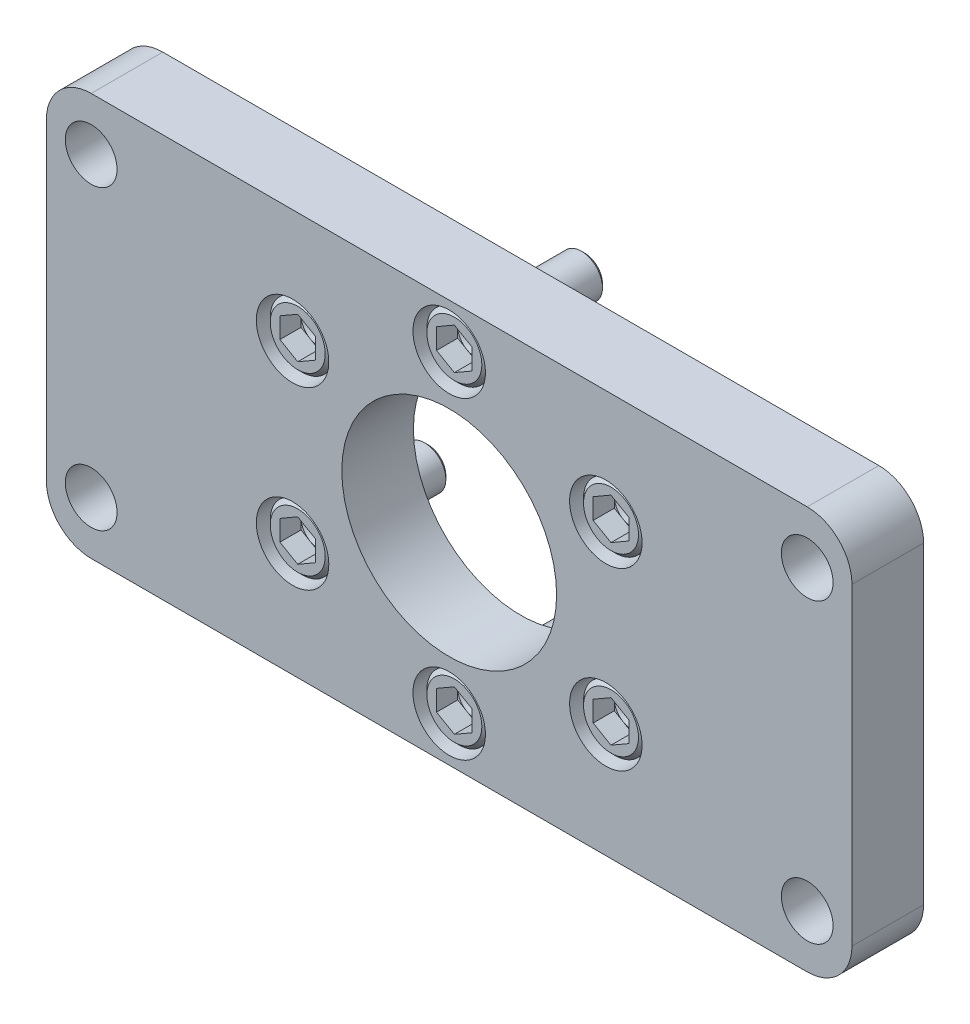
ISO-10303-21;
HEADER;
FILE_DESCRIPTION(('STEP AP214'),'2;1');
FILE_NAME('part.step','',(''),(''),'','','');
FILE_SCHEMA(('AUTOMOTIVE_DESIGN { 1 0 10303 214 1 1 1 1 }'));
ENDSEC;
DATA;
#1=APPLICATION_CONTEXT('core data for automotive mechanical design processes');
#2=APPLICATION_PROTOCOL_DEFINITION('international standard','automotive_design',2000,#1);
#3=PRODUCT_CONTEXT('',#1,'mechanical');
#4=PRODUCT('Part','Part','',(#3));
#5=PRODUCT_RELATED_PRODUCT_CATEGORY('part','',(#4));
#6=PRODUCT_DEFINITION_FORMATION('','',#4);
#7=PRODUCT_DEFINITION_CONTEXT('part definition',#1,'design');
#8=PRODUCT_DEFINITION('design','',#6,#7);
#9=PRODUCT_DEFINITION_SHAPE('','',#8);
#10=(LENGTH_UNIT() NAMED_UNIT(*) SI_UNIT(.MILLI.,.METRE.));
#11=(NAMED_UNIT(*) PLANE_ANGLE_UNIT() SI_UNIT($,.RADIAN.));
#12=(NAMED_UNIT(*) SI_UNIT($,.STERADIAN.) SOLID_ANGLE_UNIT());
#13=UNCERTAINTY_MEASURE_WITH_UNIT(LENGTH_MEASURE(1.E-05),#10,'distance_accuracy_value','');
#14=(GEOMETRIC_REPRESENTATION_CONTEXT(3) GLOBAL_UNCERTAINTY_ASSIGNED_CONTEXT((#13)) GLOBAL_UNIT_ASSIGNED_CONTEXT((#10,
#11,#12)) REPRESENTATION_CONTEXT('',''));
#15=CARTESIAN_POINT('',(0.,0.,0.));
#16=DIRECTION('',(0.,0.,1.));
#17=DIRECTION('',(1.,0.,0.));
#18=AXIS2_PLACEMENT_3D('',#15,#16,#17);
#19=CARTESIAN_POINT('',(0.,49.486,-38.462));
#20=DIRECTION('',(0.,0.,-1.));
#21=DIRECTION('',(-1.,0.,0.));
#22=AXIS2_PLACEMENT_3D('',#19,#20,#21);
#23=PLANE('',#22);
#24=CARTESIAN_POINT('',(0.,44.45,-38.462));
#25=DIRECTION('',(0.,0.,1.));
#26=DIRECTION('',(1.,0.,0.));
#27=AXIS2_PLACEMENT_3D('',#24,#25,#26);
#28=CIRCLE('',#27,5.036);
#29=CARTESIAN_POINT('',(5.03600000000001,44.45,-38.462));
#30=VERTEX_POINT('',#29);
#31=EDGE_CURVE('E2916',#30,#30,#28,.T.);
#32=ORIENTED_EDGE('',*,*,#31,.F.);
#33=EDGE_LOOP('',(#32));
#34=FACE_BOUND('',#33,.T.);
#35=ADVANCED_FACE('F16',(#34),#23,.T.);
#36=CARTESIAN_POINT('',(0.,44.45,-38.462));
#37=DIRECTION('',(0.,0.,1.));
#38=DIRECTION('',(1.,0.,0.));
#39=AXIS2_PLACEMENT_3D('',#36,#37,#38);
#40=CONICAL_SURFACE('',#39,5.036,0.785398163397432);
#41=CARTESIAN_POINT('',(0.,44.45,-37.498));
#42=DIRECTION('',(0.,0.,1.));
#43=DIRECTION('',(1.,0.,0.));
#44=AXIS2_PLACEMENT_3D('',#41,#42,#43);
#45=CIRCLE('',#44,6.);
#46=CARTESIAN_POINT('',(6.00000000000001,44.45,-37.498));
#47=VERTEX_POINT('',#46);
#48=EDGE_CURVE('E2919',#47,#47,#45,.T.);
#49=ORIENTED_EDGE('',*,*,#48,.F.);
#50=EDGE_LOOP('',(#49));
#51=FACE_BOUND('',#50,.T.);
#52=ORIENTED_EDGE('',*,*,#31,.T.);
#53=EDGE_LOOP('',(#52));
#54=FACE_BOUND('',#53,.T.);
#55=ADVANCED_FACE('F2387',(#51,#54),#40,.T.);
#56=CARTESIAN_POINT('',(0.,44.45,30.288));
#57=DIRECTION('',(0.,0.,1.));
#58=DIRECTION('',(1.,0.,0.));
#59=AXIS2_PLACEMENT_3D('',#56,#57,#58);
#60=CYLINDRICAL_SURFACE('',#59,6.);
#61=CARTESIAN_POINT('',(0.,44.45,-14.062));
#62=DIRECTION('',(0.,0.,-1.));
#63=DIRECTION('',(-1.,0.,0.));
#64=AXIS2_PLACEMENT_3D('',#61,#62,#63);
#65=CIRCLE('',#64,6.);
#66=CARTESIAN_POINT('',(-5.99999999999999,44.45,-14.062));
#67=VERTEX_POINT('',#66);
#68=EDGE_CURVE('E26',#67,#67,#65,.T.);
#69=ORIENTED_EDGE('',*,*,#68,.T.);
#70=EDGE_LOOP('',(#69));
#71=FACE_BOUND('',#70,.T.);
#72=ORIENTED_EDGE('',*,*,#48,.T.);
#73=EDGE_LOOP('',(#72));
#74=FACE_BOUND('',#73,.T.);
#75=ADVANCED_FACE('F2378',(#71,#74),#60,.T.);
#76=CARTESIAN_POINT('',(0.,44.45,-14.062));
#77=DIRECTION('',(0.,0.,-1.));
#78=DIRECTION('',(-1.,0.,0.));
#79=AXIS2_PLACEMENT_3D('',#76,#77,#78);
#80=TOROIDAL_SURFACE('',#79,6.6,0.6);
#81=ORIENTED_EDGE('',*,*,#68,.F.);
#82=EDGE_LOOP('',(#81));
#83=FACE_BOUND('',#82,.T.);
#84=CARTESIAN_POINT('',(0.,44.45,-13.4638279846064));
#85=DIRECTION('',(0.,0.,-1.));
#86=DIRECTION('',(-1.,0.,0.));
#87=AXIS2_PLACEMENT_3D('',#84,#85,#86);
#88=CIRCLE('',#87,6.5532);
#89=CARTESIAN_POINT('',(-6.55319999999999,44.45,-13.4638279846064));
#90=VERTEX_POINT('',#89);
#91=EDGE_CURVE('E10',#90,#90,#88,.F.);
#92=ORIENTED_EDGE('',*,*,#91,.F.);
#93=EDGE_LOOP('',(#92));
#94=FACE_BOUND('',#93,.T.);
#95=ADVANCED_FACE('F2369',(#83,#94),#80,.F.);
#96=CARTESIAN_POINT('',(0.,44.45,-1.46199999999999));
#97=DIRECTION('',(0.,0.,1.));
#98=DIRECTION('',(1.,0.,0.));
#99=AXIS2_PLACEMENT_3D('',#96,#97,#98);
#100=PLANE('',#99);
#101=DIRECTION('',(0.866025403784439,-0.5,0.));
#102=VECTOR('',#101,1.);
#103=CARTESIAN_POINT('',(0.,50.2898979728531,-1.46199999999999));
#104=LINE('',#103,#102);
#105=CARTESIAN_POINT('',(0.,50.2898979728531,-1.46199999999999));
#106=VERTEX_POINT('',#105);
#107=CARTESIAN_POINT('',(5.0575,47.3699489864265,-1.46199999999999));
#108=VERTEX_POINT('',#107);
#109=EDGE_CURVE('E1347',#106,#108,#104,.T.);
#110=ORIENTED_EDGE('',*,*,#109,.T.);
#111=DIRECTION('',(0.,1.,0.));
#112=VECTOR('',#111,1.);
#113=CARTESIAN_POINT('',(5.0575,41.5300510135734,-1.46199999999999));
#114=LINE('',#113,#112);
#115=CARTESIAN_POINT('',(5.0575,41.5300510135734,-1.46199999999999));
#116=VERTEX_POINT('',#115);
#117=EDGE_CURVE('E1351',#116,#108,#114,.T.);
#118=ORIENTED_EDGE('',*,*,#117,.F.);
#119=DIRECTION('',(-0.866025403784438,-0.5,0.));
#120=VECTOR('',#119,1.);
#121=CARTESIAN_POINT('',(5.0575,41.5300510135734,-1.46199999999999));
#122=LINE('',#121,#120);
#123=CARTESIAN_POINT('',(0.,38.610102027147,-1.46199999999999));
#124=VERTEX_POINT('',#123);
#125=EDGE_CURVE('E2965',#116,#124,#122,.T.);
#126=ORIENTED_EDGE('',*,*,#125,.T.);
#127=DIRECTION('',(-0.866025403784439,0.5,0.));
#128=VECTOR('',#127,1.);
#129=CARTESIAN_POINT('',(0.,38.610102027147,-1.46199999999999));
#130=LINE('',#129,#128);
#131=CARTESIAN_POINT('',(-5.0575,41.5300510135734,-1.46199999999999));
#132=VERTEX_POINT('',#131);
#133=EDGE_CURVE('E2962',#124,#132,#130,.T.);
#134=ORIENTED_EDGE('',*,*,#133,.T.);
#135=DIRECTION('',(0.,-1.,0.));
#136=VECTOR('',#135,1.);
#137=CARTESIAN_POINT('',(-5.0575,47.3699489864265,-1.46199999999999));
#138=LINE('',#137,#136);
#139=CARTESIAN_POINT('',(-5.0575,47.3699489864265,-1.46199999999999));
#140=VERTEX_POINT('',#139);
#141=EDGE_CURVE('E2959',#140,#132,#138,.T.);
#142=ORIENTED_EDGE('',*,*,#141,.F.);
#143=DIRECTION('',(-0.866025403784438,-0.5,0.));
#144=VECTOR('',#143,1.);
#145=CARTESIAN_POINT('',(0.,50.2898979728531,-1.46199999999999));
#146=LINE('',#145,#144);
#147=EDGE_CURVE('E2955',#106,#140,#146,.T.);
#148=ORIENTED_EDGE('',*,*,#147,.F.);
#149=EDGE_LOOP('',(#110,#118,#126,#134,#142,#148));
#150=FACE_BOUND('',#149,.T.);
#151=CARTESIAN_POINT('',(0.,44.45,-1.46199999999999));
#152=DIRECTION('',(0.,0.,1.));
#153=DIRECTION('',(1.,0.,0.));
#154=AXIS2_PLACEMENT_3D('',#151,#152,#153);
#155=CIRCLE('',#154,7.8);
#156=CARTESIAN_POINT('',(7.80000000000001,44.45,-1.46199999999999));
#157=VERTEX_POINT('',#156);
#158=EDGE_CURVE('E2928',#157,#157,#155,.T.);
#159=ORIENTED_EDGE('',*,*,#158,.T.);
#160=EDGE_LOOP('',(#159));
#161=FACE_BOUND('',#160,.T.);
#162=ADVANCED_FACE('F2360',(#150,#161),#100,.T.);
#163=CARTESIAN_POINT('',(0.,44.45,30.288));
#164=DIRECTION('',(0.,0.,1.));
#165=DIRECTION('',(1.,0.,0.));
#166=AXIS2_PLACEMENT_3D('',#163,#164,#165);
#167=CYLINDRICAL_SURFACE('',#166,9.);
#168=CARTESIAN_POINT('',(0.,44.45,-13.462));
#169=DIRECTION('',(0.,0.,1.));
#170=DIRECTION('',(1.,0.,0.));
#171=AXIS2_PLACEMENT_3D('',#168,#169,#170);
#172=CIRCLE('',#171,9.);
#173=CARTESIAN_POINT('',(9.00000000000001,44.45,-13.462));
#174=VERTEX_POINT('',#173);
#175=EDGE_CURVE('E2922',#174,#174,#172,.T.);
#176=ORIENTED_EDGE('',*,*,#175,.T.);
#177=EDGE_LOOP('',(#176));
#178=FACE_BOUND('',#177,.T.);
#179=CARTESIAN_POINT('',(0.,44.45,-2.662));
#180=DIRECTION('',(0.,0.,1.));
#181=DIRECTION('',(1.,0.,0.));
#182=AXIS2_PLACEMENT_3D('',#179,#180,#181);
#183=CIRCLE('',#182,9.);
#184=CARTESIAN_POINT('',(9.00000000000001,44.45,-2.662));
#185=VERTEX_POINT('',#184);
#186=EDGE_CURVE('E2925',#185,#185,#183,.T.);
#187=ORIENTED_EDGE('',*,*,#186,.F.);
#188=EDGE_LOOP('',(#187));
#189=FACE_BOUND('',#188,.T.);
#190=ADVANCED_FACE('F2351',(#178,#189),#167,.T.);
#191=CARTESIAN_POINT('',(0.,44.45,-1.46199999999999));
#192=DIRECTION('',(0.,0.,-1.));
#193=DIRECTION('',(-1.,0.,0.));
#194=AXIS2_PLACEMENT_3D('',#191,#192,#193);
#195=CONICAL_SURFACE('',#194,7.8,0.78539816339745);
#196=ORIENTED_EDGE('',*,*,#186,.T.);
#197=EDGE_LOOP('',(#196));
#198=FACE_BOUND('',#197,.T.);
#199=ORIENTED_EDGE('',*,*,#158,.F.);
#200=EDGE_LOOP('',(#199));
#201=FACE_BOUND('',#200,.T.);
#202=ADVANCED_FACE('F2342',(#198,#201),#195,.T.);
#203=CARTESIAN_POINT('',(0.,50.2898979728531,-7.462));
#204=DIRECTION('',(-0.5,-0.866025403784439,0.));
#205=DIRECTION('',(-0.866025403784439,0.5,0.));
#206=AXIS2_PLACEMENT_3D('',#203,#204,#205);
#207=PLANE('',#206);
#208=ORIENTED_EDGE('',*,*,#109,.F.);
#209=DIRECTION('',(0.,0.,1.));
#210=VECTOR('',#209,1.);
#211=CARTESIAN_POINT('',(0.,50.2898979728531,-7.462));
#212=LINE('',#211,#210);
#213=CARTESIAN_POINT('',(0.,50.2898979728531,-7.462));
#214=VERTEX_POINT('',#213);
#215=EDGE_CURVE('E2951',#214,#106,#212,.T.);
#216=ORIENTED_EDGE('',*,*,#215,.F.);
#217=DIRECTION('',(0.866025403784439,-0.5,0.));
#218=VECTOR('',#217,1.);
#219=CARTESIAN_POINT('',(0.,50.2898979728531,-7.462));
#220=LINE('',#219,#218);
#221=CARTESIAN_POINT('',(2.52875,48.8299234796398,-7.462));
#222=VERTEX_POINT('',#221);
#223=EDGE_CURVE('E2987',#214,#222,#220,.T.);
#224=ORIENTED_EDGE('',*,*,#223,.T.);
#225=CARTESIAN_POINT('',(5.0575,47.3699489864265,-7.462));
#226=VERTEX_POINT('',#225);
#227=EDGE_CURVE('E2958',#222,#226,#220,.T.);
#228=ORIENTED_EDGE('',*,*,#227,.T.);
#229=DIRECTION('',(0.,0.,1.));
#230=VECTOR('',#229,1.);
#231=CARTESIAN_POINT('',(5.0575,47.3699489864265,-7.462));
#232=LINE('',#231,#230);
#233=EDGE_CURVE('E2936',#226,#108,#232,.T.);
#234=ORIENTED_EDGE('',*,*,#233,.T.);
#235=EDGE_LOOP('',(#208,#216,#224,#228,#234));
#236=FACE_BOUND('',#235,.T.);
#237=ADVANCED_FACE('F2333',(#236),#207,.T.);
#238=CARTESIAN_POINT('',(5.0575,41.5300510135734,-7.462));
#239=DIRECTION('',(1.,0.,0.));
#240=DIRECTION('',(0.,-1.,0.));
#241=AXIS2_PLACEMENT_3D('',#238,#239,#240);
#242=PLANE('',#241);
#243=ORIENTED_EDGE('',*,*,#117,.T.);
#244=ORIENTED_EDGE('',*,*,#233,.F.);
#245=DIRECTION('',(0.,1.,0.));
#246=VECTOR('',#245,1.);
#247=CARTESIAN_POINT('',(5.0575,41.5300510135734,-7.462));
#248=LINE('',#247,#246);
#249=CARTESIAN_POINT('',(5.0575,44.45,-7.462));
#250=VERTEX_POINT('',#249);
#251=EDGE_CURVE('E2986',#250,#226,#248,.T.);
#252=ORIENTED_EDGE('',*,*,#251,.F.);
#253=CARTESIAN_POINT('',(5.0575,41.5300510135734,-7.462));
#254=VERTEX_POINT('',#253);
#255=EDGE_CURVE('E2983',#254,#250,#248,.T.);
#256=ORIENTED_EDGE('',*,*,#255,.F.);
#257=DIRECTION('',(0.,0.,1.));
#258=VECTOR('',#257,1.);
#259=CARTESIAN_POINT('',(5.0575,41.5300510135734,-7.462));
#260=LINE('',#259,#258);
#261=EDGE_CURVE('E2939',#254,#116,#260,.T.);
#262=ORIENTED_EDGE('',*,*,#261,.T.);
#263=EDGE_LOOP('',(#243,#244,#252,#256,#262));
#264=FACE_BOUND('',#263,.T.);
#265=ADVANCED_FACE('F2324',(#264),#242,.F.);
#266=CARTESIAN_POINT('',(5.0575,41.5300510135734,-7.462));
#267=DIRECTION('',(-0.5,0.866025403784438,0.));
#268=DIRECTION('',(0.866025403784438,0.5,0.));
#269=AXIS2_PLACEMENT_3D('',#266,#267,#268);
#270=PLANE('',#269);
#271=ORIENTED_EDGE('',*,*,#125,.F.);
#272=ORIENTED_EDGE('',*,*,#261,.F.);
#273=DIRECTION('',(-0.866025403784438,-0.5,0.));
#274=VECTOR('',#273,1.);
#275=CARTESIAN_POINT('',(5.0575,41.5300510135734,-7.462));
#276=LINE('',#275,#274);
#277=CARTESIAN_POINT('',(2.52875,40.0700765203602,-7.462));
#278=VERTEX_POINT('',#277);
#279=EDGE_CURVE('E2979',#254,#278,#276,.T.);
#280=ORIENTED_EDGE('',*,*,#279,.T.);
#281=CARTESIAN_POINT('',(0.,38.610102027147,-7.462));
#282=VERTEX_POINT('',#281);
#283=EDGE_CURVE('E2982',#278,#282,#276,.T.);
#284=ORIENTED_EDGE('',*,*,#283,.T.);
#285=DIRECTION('',(0.,0.,1.));
#286=VECTOR('',#285,1.);
#287=CARTESIAN_POINT('',(0.,38.610102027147,-7.462));
#288=LINE('',#287,#286);
#289=EDGE_CURVE('E2942',#282,#124,#288,.T.);
#290=ORIENTED_EDGE('',*,*,#289,.T.);
#291=EDGE_LOOP('',(#271,#272,#280,#284,#290));
#292=FACE_BOUND('',#291,.T.);
#293=ADVANCED_FACE('F2315',(#292),#270,.T.);
#294=CARTESIAN_POINT('',(0.,38.610102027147,-7.462));
#295=DIRECTION('',(0.5,0.86602540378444,0.));
#296=DIRECTION('',(0.86602540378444,-0.5,0.));
#297=AXIS2_PLACEMENT_3D('',#294,#295,#296);
#298=PLANE('',#297);
#299=ORIENTED_EDGE('',*,*,#133,.F.);
#300=ORIENTED_EDGE('',*,*,#289,.F.);
#301=DIRECTION('',(-0.866025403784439,0.5,0.));
#302=VECTOR('',#301,1.);
#303=CARTESIAN_POINT('',(0.,38.610102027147,-7.462));
#304=LINE('',#303,#302);
#305=CARTESIAN_POINT('',(-2.52875,40.0700765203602,-7.462));
#306=VERTEX_POINT('',#305);
#307=EDGE_CURVE('E2975',#282,#306,#304,.T.);
#308=ORIENTED_EDGE('',*,*,#307,.T.);
#309=CARTESIAN_POINT('',(-5.0575,41.5300510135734,-7.462));
#310=VERTEX_POINT('',#309);
#311=EDGE_CURVE('E2978',#306,#310,#304,.T.);
#312=ORIENTED_EDGE('',*,*,#311,.T.);
#313=DIRECTION('',(0.,0.,1.));
#314=VECTOR('',#313,1.);
#315=CARTESIAN_POINT('',(-5.0575,41.5300510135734,-7.462));
#316=LINE('',#315,#314);
#317=EDGE_CURVE('E2945',#310,#132,#316,.T.);
#318=ORIENTED_EDGE('',*,*,#317,.T.);
#319=EDGE_LOOP('',(#299,#300,#308,#312,#318));
#320=FACE_BOUND('',#319,.T.);
#321=ADVANCED_FACE('F2306',(#320),#298,.T.);
#322=CARTESIAN_POINT('',(-5.0575,47.3699489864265,-7.462));
#323=DIRECTION('',(-1.,0.,0.));
#324=DIRECTION('',(0.,1.,0.));
#325=AXIS2_PLACEMENT_3D('',#322,#323,#324);
#326=PLANE('',#325);
#327=ORIENTED_EDGE('',*,*,#141,.T.);
#328=ORIENTED_EDGE('',*,*,#317,.F.);
#329=DIRECTION('',(0.,-1.,0.));
#330=VECTOR('',#329,1.);
#331=CARTESIAN_POINT('',(-5.0575,47.3699489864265,-7.462));
#332=LINE('',#331,#330);
#333=CARTESIAN_POINT('',(-5.0575,44.45,-7.462));
#334=VERTEX_POINT('',#333);
#335=EDGE_CURVE('E2974',#334,#310,#332,.T.);
#336=ORIENTED_EDGE('',*,*,#335,.F.);
#337=CARTESIAN_POINT('',(-5.0575,47.3699489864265,-7.462));
#338=VERTEX_POINT('',#337);
#339=EDGE_CURVE('E35',#338,#334,#332,.T.);
#340=ORIENTED_EDGE('',*,*,#339,.F.);
#341=DIRECTION('',(0.,0.,1.));
#342=VECTOR('',#341,1.);
#343=CARTESIAN_POINT('',(-5.0575,47.3699489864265,-7.462));
#344=LINE('',#343,#342);
#345=EDGE_CURVE('E2948',#338,#140,#344,.T.);
#346=ORIENTED_EDGE('',*,*,#345,.T.);
#347=EDGE_LOOP('',(#327,#328,#336,#340,#346));
#348=FACE_BOUND('',#347,.T.);
#349=ADVANCED_FACE('F2297',(#348),#326,.F.);
#350=CARTESIAN_POINT('',(0.,50.2898979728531,-7.462));
#351=DIRECTION('',(-0.5,0.866025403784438,0.));
#352=DIRECTION('',(0.866025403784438,0.5,0.));
#353=AXIS2_PLACEMENT_3D('',#350,#351,#352);
#354=PLANE('',#353);
#355=ORIENTED_EDGE('',*,*,#147,.T.);
#356=ORIENTED_EDGE('',*,*,#345,.F.);
#357=DIRECTION('',(-0.866025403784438,-0.5,0.));
#358=VECTOR('',#357,1.);
#359=CARTESIAN_POINT('',(0.,50.2898979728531,-7.462));
#360=LINE('',#359,#358);
#361=CARTESIAN_POINT('',(-2.52875,48.8299234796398,-7.462));
#362=VERTEX_POINT('',#361);
#363=EDGE_CURVE('E2972',#362,#338,#360,.T.);
#364=ORIENTED_EDGE('',*,*,#363,.F.);
#365=EDGE_CURVE('E2954',#214,#362,#360,.T.);
#366=ORIENTED_EDGE('',*,*,#365,.F.);
#367=ORIENTED_EDGE('',*,*,#215,.T.);
#368=EDGE_LOOP('',(#355,#356,#364,#366,#367));
#369=FACE_BOUND('',#368,.T.);
#370=ADVANCED_FACE('F2289',(#369),#354,.F.);
#371=CARTESIAN_POINT('',(-5.0575,53.2098469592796,-7.462));
#372=DIRECTION('',(0.,0.,-1.));
#373=DIRECTION('',(-1.,0.,0.));
#374=AXIS2_PLACEMENT_3D('',#371,#372,#373);
#375=PLANE('',#374);
#376=ORIENTED_EDGE('',*,*,#335,.T.);
#377=ORIENTED_EDGE('',*,*,#311,.F.);
#378=CARTESIAN_POINT('',(0.,44.45,-7.462));
#379=DIRECTION('',(0.,0.,1.));
#380=DIRECTION('',(1.,0.,0.));
#381=AXIS2_PLACEMENT_3D('',#378,#379,#380);
#382=CIRCLE('',#381,5.0575);
#383=EDGE_CURVE('E3041',#334,#306,#382,.T.);
#384=ORIENTED_EDGE('',*,*,#383,.F.);
#385=EDGE_LOOP('',(#376,#377,#384));
#386=FACE_BOUND('',#385,.T.);
#387=ADVANCED_FACE('F2251',(#386),#375,.F.);
#388=ORIENTED_EDGE('',*,*,#307,.F.);
#389=ORIENTED_EDGE('',*,*,#283,.F.);
#390=EDGE_CURVE('E3045',#306,#278,#382,.T.);
#391=ORIENTED_EDGE('',*,*,#390,.F.);
#392=EDGE_LOOP('',(#388,#389,#391));
#393=FACE_BOUND('',#392,.T.);
#394=ADVANCED_FACE('F2274',(#393),#375,.F.);
#395=ORIENTED_EDGE('',*,*,#279,.F.);
#396=ORIENTED_EDGE('',*,*,#255,.T.);
#397=EDGE_CURVE('E2935',#278,#250,#382,.T.);
#398=ORIENTED_EDGE('',*,*,#397,.F.);
#399=EDGE_LOOP('',(#395,#396,#398));
#400=FACE_BOUND('',#399,.T.);
#401=ADVANCED_FACE('F2266',(#400),#375,.F.);
#402=ORIENTED_EDGE('',*,*,#251,.T.);
#403=ORIENTED_EDGE('',*,*,#227,.F.);
#404=EDGE_CURVE('E2931',#250,#222,#382,.T.);
#405=ORIENTED_EDGE('',*,*,#404,.F.);
#406=EDGE_LOOP('',(#402,#403,#405));
#407=FACE_BOUND('',#406,.T.);
#408=ADVANCED_FACE('F2258',(#407),#375,.F.);
#409=ORIENTED_EDGE('',*,*,#223,.F.);
#410=ORIENTED_EDGE('',*,*,#365,.T.);
#411=EDGE_CURVE('E2934',#222,#362,#382,.T.);
#412=ORIENTED_EDGE('',*,*,#411,.F.);
#413=EDGE_LOOP('',(#409,#410,#412));
#414=FACE_BOUND('',#413,.T.);
#415=ADVANCED_FACE('F2249',(#414),#375,.F.);
#416=ORIENTED_EDGE('',*,*,#363,.T.);
#417=ORIENTED_EDGE('',*,*,#339,.T.);
#418=EDGE_CURVE('E3034',#362,#334,#382,.T.);
#419=ORIENTED_EDGE('',*,*,#418,.F.);
#420=EDGE_LOOP('',(#416,#417,#419));
#421=FACE_BOUND('',#420,.T.);
#422=ADVANCED_FACE('F646',(#421),#375,.F.);
#423=CARTESIAN_POINT('',(0.,44.45,-7.462));
#424=DIRECTION('',(0.,0.,1.));
#425=DIRECTION('',(1.,0.,0.));
#426=AXIS2_PLACEMENT_3D('',#423,#424,#425);
#427=CONICAL_SURFACE('',#426,5.0575,1.0471975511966);
#428=CARTESIAN_POINT('',(0.,44.45,-10.3819489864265));
#429=VERTEX_POINT('',#428);
#430=VERTEX_LOOP('',#429);
#431=FACE_BOUND('',#430,.T.);
#432=ORIENTED_EDGE('',*,*,#404,.T.);
#433=ORIENTED_EDGE('',*,*,#411,.T.);
#434=ORIENTED_EDGE('',*,*,#418,.T.);
#435=ORIENTED_EDGE('',*,*,#383,.T.);
#436=ORIENTED_EDGE('',*,*,#390,.T.);
#437=ORIENTED_EDGE('',*,*,#397,.T.);
#438=EDGE_LOOP('',(#432,#433,#434,#435,#436,#437));
#439=FACE_BOUND('',#438,.T.);
#440=ADVANCED_FACE('F635',(#431,#439),#427,.F.);
#441=CARTESIAN_POINT('',(-44.45,24.892,-7.462));
#442=DIRECTION('',(0.,0.,1.));
#443=DIRECTION('',(1.,0.,0.));
#444=AXIS2_PLACEMENT_3D('',#441,#442,#443);
#445=CONICAL_SURFACE('',#444,5.0575,1.0471975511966);
#446=CARTESIAN_POINT('',(-44.45,24.892,-10.3819489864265));
#447=VERTEX_POINT('',#446);
#448=VERTEX_LOOP('',#447);
#449=FACE_BOUND('',#448,.T.);
#450=CARTESIAN_POINT('',(-44.45,24.892,-7.462));
#451=DIRECTION('',(0.,0.,1.));
#452=DIRECTION('',(1.,0.,0.));
#453=AXIS2_PLACEMENT_3D('',#450,#451,#452);
#454=CIRCLE('',#453,5.0575);
#455=CARTESIAN_POINT('',(-39.3925,24.892,-7.462));
#456=VERTEX_POINT('',#455);
#457=CARTESIAN_POINT('',(-41.92125,29.2719234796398,-7.462));
#458=VERTEX_POINT('',#457);
#459=EDGE_CURVE('E1040',#456,#458,#454,.T.);
#460=ORIENTED_EDGE('',*,*,#459,.T.);
#461=CARTESIAN_POINT('',(-46.97875,29.2719234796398,-7.462));
#462=VERTEX_POINT('',#461);
#463=EDGE_CURVE('E985',#458,#462,#454,.T.);
#464=ORIENTED_EDGE('',*,*,#463,.T.);
#465=CARTESIAN_POINT('',(-49.5075,24.892,-7.462));
#466=VERTEX_POINT('',#465);
#467=EDGE_CURVE('E1383',#462,#466,#454,.T.);
#468=ORIENTED_EDGE('',*,*,#467,.T.);
#469=CARTESIAN_POINT('',(-46.97875,20.5120765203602,-7.462));
#470=VERTEX_POINT('',#469);
#471=EDGE_CURVE('E1384',#466,#470,#454,.T.);
#472=ORIENTED_EDGE('',*,*,#471,.T.);
#473=CARTESIAN_POINT('',(-41.92125,20.5120765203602,-7.462));
#474=VERTEX_POINT('',#473);
#475=EDGE_CURVE('E1385',#470,#474,#454,.T.);
#476=ORIENTED_EDGE('',*,*,#475,.T.);
#477=EDGE_CURVE('E1039',#474,#456,#454,.T.);
#478=ORIENTED_EDGE('',*,*,#477,.T.);
#479=EDGE_LOOP('',(#460,#464,#468,#472,#476,#478));
#480=FACE_BOUND('',#479,.T.);
#481=ADVANCED_FACE('F632',(#449,#480),#445,.F.);
#482=CARTESIAN_POINT('',(44.45,24.892,-7.462));
#483=DIRECTION('',(0.,0.,1.));
#484=DIRECTION('',(1.,0.,0.));
#485=AXIS2_PLACEMENT_3D('',#482,#483,#484);
#486=CONICAL_SURFACE('',#485,5.0575,1.0471975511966);
#487=CARTESIAN_POINT('',(44.45,24.892,-10.3819489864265));
#488=VERTEX_POINT('',#487);
#489=VERTEX_LOOP('',#488);
#490=FACE_BOUND('',#489,.T.);
#491=CARTESIAN_POINT('',(44.45,24.892,-7.462));
#492=DIRECTION('',(0.,0.,1.));
#493=DIRECTION('',(1.,0.,0.));
#494=AXIS2_PLACEMENT_3D('',#491,#492,#493);
#495=CIRCLE('',#494,5.0575);
#496=CARTESIAN_POINT('',(49.5075,24.892,-7.462));
#497=VERTEX_POINT('',#496);
#498=CARTESIAN_POINT('',(46.97875,29.2719234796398,-7.462));
#499=VERTEX_POINT('',#498);
#500=EDGE_CURVE('E509',#497,#499,#495,.T.);
#501=ORIENTED_EDGE('',*,*,#500,.T.);
#502=CARTESIAN_POINT('',(41.92125,29.2719234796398,-7.462));
#503=VERTEX_POINT('',#502);
#504=EDGE_CURVE('E513',#499,#503,#495,.T.);
#505=ORIENTED_EDGE('',*,*,#504,.T.);
#506=CARTESIAN_POINT('',(39.3925,24.892,-7.462));
#507=VERTEX_POINT('',#506);
#508=EDGE_CURVE('E3141',#503,#507,#495,.T.);
#509=ORIENTED_EDGE('',*,*,#508,.T.);
#510=CARTESIAN_POINT('',(41.92125,20.5120765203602,-7.462));
#511=VERTEX_POINT('',#510);
#512=EDGE_CURVE('E3138',#507,#511,#495,.T.);
#513=ORIENTED_EDGE('',*,*,#512,.T.);
#514=CARTESIAN_POINT('',(46.97875,20.5120765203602,-7.462));
#515=VERTEX_POINT('',#514);
#516=EDGE_CURVE('E3129',#511,#515,#495,.T.);
#517=ORIENTED_EDGE('',*,*,#516,.T.);
#518=EDGE_CURVE('E508',#515,#497,#495,.T.);
#519=ORIENTED_EDGE('',*,*,#518,.T.);
#520=EDGE_LOOP('',(#501,#505,#509,#513,#517,#519));
#521=FACE_BOUND('',#520,.T.);
#522=ADVANCED_FACE('F634',(#490,#521),#486,.F.);
#523=CARTESIAN_POINT('',(44.45,-24.892,-7.462));
#524=DIRECTION('',(0.,0.,1.));
#525=DIRECTION('',(1.,0.,0.));
#526=AXIS2_PLACEMENT_3D('',#523,#524,#525);
#527=CONICAL_SURFACE('',#526,5.0575,1.0471975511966);
#528=CARTESIAN_POINT('',(44.45,-24.892,-10.3819489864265));
#529=VERTEX_POINT('',#528);
#530=VERTEX_LOOP('',#529);
#531=FACE_BOUND('',#530,.T.);
#532=CARTESIAN_POINT('',(44.45,-24.892,-7.462));
#533=DIRECTION('',(0.,0.,1.));
#534=DIRECTION('',(1.,0.,0.));
#535=AXIS2_PLACEMENT_3D('',#532,#533,#534);
#536=CIRCLE('',#535,5.0575);
#537=CARTESIAN_POINT('',(49.5075,-24.892,-7.462));
#538=VERTEX_POINT('',#537);
#539=CARTESIAN_POINT('',(46.97875,-20.5120765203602,-7.462));
#540=VERTEX_POINT('',#539);
#541=EDGE_CURVE('E2853',#538,#540,#536,.T.);
#542=ORIENTED_EDGE('',*,*,#541,.T.);
#543=CARTESIAN_POINT('',(41.92125,-20.5120765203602,-7.462));
#544=VERTEX_POINT('',#543);
#545=EDGE_CURVE('E2856',#540,#544,#536,.T.);
#546=ORIENTED_EDGE('',*,*,#545,.T.);
#547=CARTESIAN_POINT('',(39.3925,-24.892,-7.462));
#548=VERTEX_POINT('',#547);
#549=EDGE_CURVE('E3092',#544,#548,#536,.T.);
#550=ORIENTED_EDGE('',*,*,#549,.T.);
#551=CARTESIAN_POINT('',(41.92125,-29.2719234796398,-7.462));
#552=VERTEX_POINT('',#551);
#553=EDGE_CURVE('E3094',#548,#552,#536,.T.);
#554=ORIENTED_EDGE('',*,*,#553,.T.);
#555=CARTESIAN_POINT('',(46.97875,-29.2719234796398,-7.462));
#556=VERTEX_POINT('',#555);
#557=EDGE_CURVE('E3095',#552,#556,#536,.T.);
#558=ORIENTED_EDGE('',*,*,#557,.T.);
#559=EDGE_CURVE('E2857',#556,#538,#536,.T.);
#560=ORIENTED_EDGE('',*,*,#559,.T.);
#561=EDGE_LOOP('',(#542,#546,#550,#554,#558,#560));
#562=FACE_BOUND('',#561,.T.);
#563=ADVANCED_FACE('F643',(#531,#562),#527,.F.);
#564=CARTESIAN_POINT('',(-44.45,-24.892,-7.462));
#565=DIRECTION('',(0.,0.,1.));
#566=DIRECTION('',(1.,0.,0.));
#567=AXIS2_PLACEMENT_3D('',#564,#565,#566);
#568=CONICAL_SURFACE('',#567,5.0575,1.0471975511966);
#569=CARTESIAN_POINT('',(-44.45,-24.892,-10.3819489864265));
#570=VERTEX_POINT('',#569);
#571=VERTEX_LOOP('',#570);
#572=FACE_BOUND('',#571,.T.);
#573=CARTESIAN_POINT('',(-44.45,-24.892,-7.462));
#574=DIRECTION('',(0.,0.,1.));
#575=DIRECTION('',(1.,0.,0.));
#576=AXIS2_PLACEMENT_3D('',#573,#574,#575);
#577=CIRCLE('',#576,5.0575);
#578=CARTESIAN_POINT('',(-39.3925,-24.892,-7.462));
#579=VERTEX_POINT('',#578);
#580=CARTESIAN_POINT('',(-41.92125,-20.5120765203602,-7.462));
#581=VERTEX_POINT('',#580);
#582=EDGE_CURVE('E1118',#579,#581,#577,.T.);
#583=ORIENTED_EDGE('',*,*,#582,.T.);
#584=CARTESIAN_POINT('',(-46.97875,-20.5120765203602,-7.462));
#585=VERTEX_POINT('',#584);
#586=EDGE_CURVE('E1122',#581,#585,#577,.T.);
#587=ORIENTED_EDGE('',*,*,#586,.T.);
#588=CARTESIAN_POINT('',(-49.5075,-24.892,-7.462));
#589=VERTEX_POINT('',#588);
#590=EDGE_CURVE('E1454',#585,#589,#577,.T.);
#591=ORIENTED_EDGE('',*,*,#590,.T.);
#592=CARTESIAN_POINT('',(-46.97875,-29.2719234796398,-7.462));
#593=VERTEX_POINT('',#592);
#594=EDGE_CURVE('E1462',#589,#593,#577,.T.);
#595=ORIENTED_EDGE('',*,*,#594,.T.);
#596=CARTESIAN_POINT('',(-41.92125,-29.2719234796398,-7.462));
#597=VERTEX_POINT('',#596);
#598=EDGE_CURVE('E1465',#593,#597,#577,.T.);
#599=ORIENTED_EDGE('',*,*,#598,.T.);
#600=EDGE_CURVE('E1117',#597,#579,#577,.T.);
#601=ORIENTED_EDGE('',*,*,#600,.T.);
#602=EDGE_LOOP('',(#583,#587,#591,#595,#599,#601));
#603=FACE_BOUND('',#602,.T.);
#604=ADVANCED_FACE('F718',(#572,#603),#568,.F.);
#605=CARTESIAN_POINT('',(0.,-44.45,-7.462));
#606=DIRECTION('',(0.,0.,1.));
#607=DIRECTION('',(1.,0.,0.));
#608=AXIS2_PLACEMENT_3D('',#605,#606,#607);
#609=CONICAL_SURFACE('',#608,5.0575,1.0471975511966);
#610=CARTESIAN_POINT('',(0.,-44.45,-10.3819489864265));
#611=VERTEX_POINT('',#610);
#612=VERTEX_LOOP('',#611);
#613=FACE_BOUND('',#612,.T.);
#614=CARTESIAN_POINT('',(0.,-44.45,-7.462));
#615=DIRECTION('',(0.,0.,1.));
#616=DIRECTION('',(1.,0.,0.));
#617=AXIS2_PLACEMENT_3D('',#614,#615,#616);
#618=CIRCLE('',#617,5.0575);
#619=CARTESIAN_POINT('',(5.0575,-44.45,-7.462));
#620=VERTEX_POINT('',#619);
#621=CARTESIAN_POINT('',(2.52875,-40.0700765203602,-7.462));
#622=VERTEX_POINT('',#621);
#623=EDGE_CURVE('E409',#620,#622,#618,.T.);
#624=ORIENTED_EDGE('',*,*,#623,.T.);
#625=CARTESIAN_POINT('',(-2.52875,-40.0700765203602,-7.462));
#626=VERTEX_POINT('',#625);
#627=EDGE_CURVE('E408',#622,#626,#618,.T.);
#628=ORIENTED_EDGE('',*,*,#627,.T.);
#629=CARTESIAN_POINT('',(-5.0575,-44.45,-7.462));
#630=VERTEX_POINT('',#629);
#631=EDGE_CURVE('E379',#626,#630,#618,.T.);
#632=ORIENTED_EDGE('',*,*,#631,.T.);
#633=CARTESIAN_POINT('',(-2.52875,-48.8299234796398,-7.462));
#634=VERTEX_POINT('',#633);
#635=EDGE_CURVE('E397',#630,#634,#618,.T.);
#636=ORIENTED_EDGE('',*,*,#635,.T.);
#637=CARTESIAN_POINT('',(2.52875,-48.8299234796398,-7.462));
#638=VERTEX_POINT('',#637);
#639=EDGE_CURVE('E403',#634,#638,#618,.T.);
#640=ORIENTED_EDGE('',*,*,#639,.T.);
#641=EDGE_CURVE('E413',#638,#620,#618,.T.);
#642=ORIENTED_EDGE('',*,*,#641,.T.);
#643=EDGE_LOOP('',(#624,#628,#632,#636,#640,#642));
#644=FACE_BOUND('',#643,.T.);
#645=ADVANCED_FACE('F407',(#613,#644),#609,.F.);
#646=CARTESIAN_POINT('',(-49.5075,33.6518469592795,-7.462));
#647=DIRECTION('',(0.,0.,-1.));
#648=DIRECTION('',(-1.,0.,0.));
#649=AXIS2_PLACEMENT_3D('',#646,#647,#648);
#650=PLANE('',#649);
#651=DIRECTION('',(-0.866025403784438,-0.5,0.));
#652=VECTOR('',#651,1.);
#653=CARTESIAN_POINT('',(-44.45,30.731897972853,-7.462));
#654=LINE('',#653,#652);
#655=CARTESIAN_POINT('',(-49.5075,27.8119489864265,-7.462));
#656=VERTEX_POINT('',#655);
#657=EDGE_CURVE('E1001',#462,#656,#654,.T.);
#658=ORIENTED_EDGE('',*,*,#657,.T.);
#659=DIRECTION('',(0.,-1.,0.));
#660=VECTOR('',#659,1.);
#661=CARTESIAN_POINT('',(-49.5075,27.8119489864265,-7.462));
#662=LINE('',#661,#660);
#663=EDGE_CURVE('E1005',#656,#466,#662,.T.);
#664=ORIENTED_EDGE('',*,*,#663,.T.);
#665=ORIENTED_EDGE('',*,*,#467,.F.);
#666=EDGE_LOOP('',(#658,#664,#665));
#667=FACE_BOUND('',#666,.T.);
#668=ADVANCED_FACE('F949',(#667),#650,.F.);
#669=CARTESIAN_POINT('',(-49.5075,21.9720510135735,-7.462));
#670=VERTEX_POINT('',#669);
#671=EDGE_CURVE('E1367',#466,#670,#662,.T.);
#672=ORIENTED_EDGE('',*,*,#671,.T.);
#673=DIRECTION('',(-0.866025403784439,0.5,0.));
#674=VECTOR('',#673,1.);
#675=CARTESIAN_POINT('',(-44.45,19.0521020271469,-7.462));
#676=LINE('',#675,#674);
#677=EDGE_CURVE('E1364',#470,#670,#676,.T.);
#678=ORIENTED_EDGE('',*,*,#677,.F.);
#679=ORIENTED_EDGE('',*,*,#471,.F.);
#680=EDGE_LOOP('',(#672,#678,#679));
#681=FACE_BOUND('',#680,.T.);
#682=ADVANCED_FACE('F954',(#681),#650,.F.);
#683=CARTESIAN_POINT('',(-44.45,19.0521020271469,-7.462));
#684=VERTEX_POINT('',#683);
#685=EDGE_CURVE('E1365',#684,#470,#676,.T.);
#686=ORIENTED_EDGE('',*,*,#685,.F.);
#687=DIRECTION('',(-0.866025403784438,-0.5,0.));
#688=VECTOR('',#687,1.);
#689=CARTESIAN_POINT('',(-39.3925,21.9720510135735,-7.462));
#690=LINE('',#689,#688);
#691=EDGE_CURVE('E1361',#474,#684,#690,.T.);
#692=ORIENTED_EDGE('',*,*,#691,.F.);
#693=ORIENTED_EDGE('',*,*,#475,.F.);
#694=EDGE_LOOP('',(#686,#692,#693));
#695=FACE_BOUND('',#694,.T.);
#696=ADVANCED_FACE('F962',(#695),#650,.F.);
#697=CARTESIAN_POINT('',(-39.3925,21.9720510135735,-7.462));
#698=VERTEX_POINT('',#697);
#699=EDGE_CURVE('E1362',#698,#474,#690,.T.);
#700=ORIENTED_EDGE('',*,*,#699,.F.);
#701=DIRECTION('',(0.,1.,0.));
#702=VECTOR('',#701,1.);
#703=CARTESIAN_POINT('',(-39.3925,21.9720510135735,-7.462));
#704=LINE('',#703,#702);
#705=EDGE_CURVE('E1358',#698,#456,#704,.T.);
#706=ORIENTED_EDGE('',*,*,#705,.T.);
#707=ORIENTED_EDGE('',*,*,#477,.F.);
#708=EDGE_LOOP('',(#700,#706,#707));
#709=FACE_BOUND('',#708,.T.);
#710=ADVANCED_FACE('F976',(#709),#650,.F.);
#711=CARTESIAN_POINT('',(-39.3925,27.8119489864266,-7.462));
#712=VERTEX_POINT('',#711);
#713=EDGE_CURVE('E990',#456,#712,#704,.T.);
#714=ORIENTED_EDGE('',*,*,#713,.T.);
#715=DIRECTION('',(0.866025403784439,-0.5,0.));
#716=VECTOR('',#715,1.);
#717=CARTESIAN_POINT('',(-44.45,30.731897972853,-7.462));
#718=LINE('',#717,#716);
#719=EDGE_CURVE('E991',#458,#712,#718,.T.);
#720=ORIENTED_EDGE('',*,*,#719,.F.);
#721=ORIENTED_EDGE('',*,*,#459,.F.);
#722=EDGE_LOOP('',(#714,#720,#721));
#723=FACE_BOUND('',#722,.T.);
#724=ADVANCED_FACE('F967',(#723),#650,.F.);
#725=CARTESIAN_POINT('',(-44.45,30.731897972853,-7.462));
#726=VERTEX_POINT('',#725);
#727=EDGE_CURVE('E981',#726,#458,#718,.T.);
#728=ORIENTED_EDGE('',*,*,#727,.F.);
#729=EDGE_CURVE('E983',#726,#462,#654,.T.);
#730=ORIENTED_EDGE('',*,*,#729,.T.);
#731=ORIENTED_EDGE('',*,*,#463,.F.);
#732=EDGE_LOOP('',(#728,#730,#731));
#733=FACE_BOUND('',#732,.T.);
#734=ADVANCED_FACE('F957',(#733),#650,.F.);
#735=CARTESIAN_POINT('',(39.3925,33.6518469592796,-7.462));
#736=DIRECTION('',(0.,0.,-1.));
#737=DIRECTION('',(-1.,0.,0.));
#738=AXIS2_PLACEMENT_3D('',#735,#736,#737);
#739=PLANE('',#738);
#740=DIRECTION('',(-0.866025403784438,-0.5,0.));
#741=VECTOR('',#740,1.);
#742=CARTESIAN_POINT('',(44.45,30.731897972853,-7.462));
#743=LINE('',#742,#741);
#744=CARTESIAN_POINT('',(39.3925,27.8119489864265,-7.462));
#745=VERTEX_POINT('',#744);
#746=EDGE_CURVE('E471',#503,#745,#743,.T.);
#747=ORIENTED_EDGE('',*,*,#746,.T.);
#748=DIRECTION('',(0.,-1.,0.));
#749=VECTOR('',#748,1.);
#750=CARTESIAN_POINT('',(39.3925,27.8119489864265,-7.462));
#751=LINE('',#750,#749);
#752=EDGE_CURVE('E469',#745,#507,#751,.T.);
#753=ORIENTED_EDGE('',*,*,#752,.T.);
#754=ORIENTED_EDGE('',*,*,#508,.F.);
#755=EDGE_LOOP('',(#747,#753,#754));
#756=FACE_BOUND('',#755,.T.);
#757=ADVANCED_FACE('F887',(#756),#739,.F.);
#758=CARTESIAN_POINT('',(39.3925,21.9720510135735,-7.462));
#759=VERTEX_POINT('',#758);
#760=EDGE_CURVE('E468',#507,#759,#751,.T.);
#761=ORIENTED_EDGE('',*,*,#760,.T.);
#762=DIRECTION('',(-0.866025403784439,0.5,0.));
#763=VECTOR('',#762,1.);
#764=CARTESIAN_POINT('',(44.45,19.0521020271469,-7.462));
#765=LINE('',#764,#763);
#766=EDGE_CURVE('E464',#511,#759,#765,.T.);
#767=ORIENTED_EDGE('',*,*,#766,.F.);
#768=ORIENTED_EDGE('',*,*,#512,.F.);
#769=EDGE_LOOP('',(#761,#767,#768));
#770=FACE_BOUND('',#769,.T.);
#771=ADVANCED_FACE('F883',(#770),#739,.F.);
#772=CARTESIAN_POINT('',(44.45,19.0521020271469,-7.462));
#773=VERTEX_POINT('',#772);
#774=EDGE_CURVE('E465',#773,#511,#765,.T.);
#775=ORIENTED_EDGE('',*,*,#774,.F.);
#776=DIRECTION('',(-0.866025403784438,-0.5,0.));
#777=VECTOR('',#776,1.);
#778=CARTESIAN_POINT('',(49.5075,21.9720510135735,-7.462));
#779=LINE('',#778,#777);
#780=EDGE_CURVE('E460',#515,#773,#779,.T.);
#781=ORIENTED_EDGE('',*,*,#780,.F.);
#782=ORIENTED_EDGE('',*,*,#516,.F.);
#783=EDGE_LOOP('',(#775,#781,#782));
#784=FACE_BOUND('',#783,.T.);
#785=ADVANCED_FACE('F886',(#784),#739,.F.);
#786=CARTESIAN_POINT('',(49.5075,21.9720510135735,-7.462));
#787=VERTEX_POINT('',#786);
#788=EDGE_CURVE('E461',#787,#515,#779,.T.);
#789=ORIENTED_EDGE('',*,*,#788,.F.);
#790=DIRECTION('',(0.,1.,0.));
#791=VECTOR('',#790,1.);
#792=CARTESIAN_POINT('',(49.5075,21.9720510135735,-7.462));
#793=LINE('',#792,#791);
#794=EDGE_CURVE('E457',#787,#497,#793,.T.);
#795=ORIENTED_EDGE('',*,*,#794,.T.);
#796=ORIENTED_EDGE('',*,*,#518,.F.);
#797=EDGE_LOOP('',(#789,#795,#796));
#798=FACE_BOUND('',#797,.T.);
#799=ADVANCED_FACE('F2193',(#798),#739,.F.);
#800=CARTESIAN_POINT('',(49.5075,27.8119489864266,-7.462));
#801=VERTEX_POINT('',#800);
#802=EDGE_CURVE('E455',#497,#801,#793,.T.);
#803=ORIENTED_EDGE('',*,*,#802,.T.);
#804=DIRECTION('',(0.866025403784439,-0.5,0.));
#805=VECTOR('',#804,1.);
#806=CARTESIAN_POINT('',(44.45,30.731897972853,-7.462));
#807=LINE('',#806,#805);
#808=EDGE_CURVE('E456',#499,#801,#807,.T.);
#809=ORIENTED_EDGE('',*,*,#808,.F.);
#810=ORIENTED_EDGE('',*,*,#500,.F.);
#811=EDGE_LOOP('',(#803,#809,#810));
#812=FACE_BOUND('',#811,.T.);
#813=ADVANCED_FACE('F2185',(#812),#739,.F.);
#814=CARTESIAN_POINT('',(44.45,30.731897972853,-7.462));
#815=VERTEX_POINT('',#814);
#816=EDGE_CURVE('E452',#815,#499,#807,.T.);
#817=ORIENTED_EDGE('',*,*,#816,.F.);
#818=EDGE_CURVE('E472',#815,#503,#743,.T.);
#819=ORIENTED_EDGE('',*,*,#818,.T.);
#820=ORIENTED_EDGE('',*,*,#504,.F.);
#821=EDGE_LOOP('',(#817,#819,#820));
#822=FACE_BOUND('',#821,.T.);
#823=ADVANCED_FACE('F975',(#822),#739,.F.);
#824=CARTESIAN_POINT('',(39.3925,-16.1321530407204,-7.462));
#825=DIRECTION('',(0.,0.,-1.));
#826=DIRECTION('',(-1.,0.,0.));
#827=AXIS2_PLACEMENT_3D('',#824,#825,#826);
#828=PLANE('',#827);
#829=DIRECTION('',(-0.866025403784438,-0.5,0.));
#830=VECTOR('',#829,1.);
#831=CARTESIAN_POINT('',(44.45,-19.0521020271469,-7.462));
#832=LINE('',#831,#830);
#833=CARTESIAN_POINT('',(39.3925,-21.9720510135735,-7.462));
#834=VERTEX_POINT('',#833);
#835=EDGE_CURVE('E2895',#544,#834,#832,.T.);
#836=ORIENTED_EDGE('',*,*,#835,.T.);
#837=DIRECTION('',(0.,-1.,0.));
#838=VECTOR('',#837,1.);
#839=CARTESIAN_POINT('',(39.3925,-21.9720510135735,-7.462));
#840=LINE('',#839,#838);
#841=EDGE_CURVE('E2896',#834,#548,#840,.T.);
#842=ORIENTED_EDGE('',*,*,#841,.T.);
#843=ORIENTED_EDGE('',*,*,#549,.F.);
#844=EDGE_LOOP('',(#836,#842,#843));
#845=FACE_BOUND('',#844,.T.);
#846=ADVANCED_FACE('F1448',(#845),#828,.F.);
#847=CARTESIAN_POINT('',(39.3925,-27.8119489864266,-7.462));
#848=VERTEX_POINT('',#847);
#849=EDGE_CURVE('E2898',#548,#848,#840,.T.);
#850=ORIENTED_EDGE('',*,*,#849,.T.);
#851=DIRECTION('',(-0.866025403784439,0.5,0.));
#852=VECTOR('',#851,1.);
#853=CARTESIAN_POINT('',(44.45,-30.731897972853,-7.462));
#854=LINE('',#853,#852);
#855=EDGE_CURVE('E2902',#552,#848,#854,.T.);
#856=ORIENTED_EDGE('',*,*,#855,.F.);
#857=ORIENTED_EDGE('',*,*,#553,.F.);
#858=EDGE_LOOP('',(#850,#856,#857));
#859=FACE_BOUND('',#858,.T.);
#860=ADVANCED_FACE('F2163',(#859),#828,.F.);
#861=CARTESIAN_POINT('',(44.45,-30.731897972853,-7.462));
#862=VERTEX_POINT('',#861);
#863=EDGE_CURVE('E2899',#862,#552,#854,.T.);
#864=ORIENTED_EDGE('',*,*,#863,.F.);
#865=DIRECTION('',(-0.866025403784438,-0.5,0.));
#866=VECTOR('',#865,1.);
#867=CARTESIAN_POINT('',(49.5075,-27.8119489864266,-7.462));
#868=LINE('',#867,#866);
#869=EDGE_CURVE('E2906',#556,#862,#868,.T.);
#870=ORIENTED_EDGE('',*,*,#869,.F.);
#871=ORIENTED_EDGE('',*,*,#557,.F.);
#872=EDGE_LOOP('',(#864,#870,#871));
#873=FACE_BOUND('',#872,.T.);
#874=ADVANCED_FACE('F2155',(#873),#828,.F.);
#875=CARTESIAN_POINT('',(49.5075,-27.8119489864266,-7.462));
#876=VERTEX_POINT('',#875);
#877=EDGE_CURVE('E2903',#876,#556,#868,.T.);
#878=ORIENTED_EDGE('',*,*,#877,.F.);
#879=DIRECTION('',(0.,1.,0.));
#880=VECTOR('',#879,1.);
#881=CARTESIAN_POINT('',(49.5075,-27.8119489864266,-7.462));
#882=LINE('',#881,#880);
#883=EDGE_CURVE('E2907',#876,#538,#882,.T.);
#884=ORIENTED_EDGE('',*,*,#883,.T.);
#885=ORIENTED_EDGE('',*,*,#559,.F.);
#886=EDGE_LOOP('',(#878,#884,#885));
#887=FACE_BOUND('',#886,.T.);
#888=ADVANCED_FACE('F2148',(#887),#828,.F.);
#889=CARTESIAN_POINT('',(49.5075,-21.9720510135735,-7.462));
#890=VERTEX_POINT('',#889);
#891=EDGE_CURVE('E2910',#538,#890,#882,.T.);
#892=ORIENTED_EDGE('',*,*,#891,.T.);
#893=DIRECTION('',(0.866025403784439,-0.5,0.));
#894=VECTOR('',#893,1.);
#895=CARTESIAN_POINT('',(44.45,-19.0521020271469,-7.462));
#896=LINE('',#895,#894);
#897=EDGE_CURVE('E2880',#540,#890,#896,.T.);
#898=ORIENTED_EDGE('',*,*,#897,.F.);
#899=ORIENTED_EDGE('',*,*,#541,.F.);
#900=EDGE_LOOP('',(#892,#898,#899));
#901=FACE_BOUND('',#900,.T.);
#902=ADVANCED_FACE('F1445',(#901),#828,.F.);
#903=CARTESIAN_POINT('',(44.45,-19.0521020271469,-7.462));
#904=VERTEX_POINT('',#903);
#905=EDGE_CURVE('E2911',#904,#540,#896,.T.);
#906=ORIENTED_EDGE('',*,*,#905,.F.);
#907=EDGE_CURVE('E2876',#904,#544,#832,.T.);
#908=ORIENTED_EDGE('',*,*,#907,.T.);
#909=ORIENTED_EDGE('',*,*,#545,.F.);
#910=EDGE_LOOP('',(#906,#908,#909));
#911=FACE_BOUND('',#910,.T.);
#912=ADVANCED_FACE('F1439',(#911),#828,.F.);
#913=CARTESIAN_POINT('',(-49.5075,-16.1321530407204,-7.462));
#914=DIRECTION('',(0.,0.,-1.));
#915=DIRECTION('',(-1.,0.,0.));
#916=AXIS2_PLACEMENT_3D('',#913,#914,#915);
#917=PLANE('',#916);
#918=DIRECTION('',(-0.866025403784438,-0.5,0.));
#919=VECTOR('',#918,1.);
#920=CARTESIAN_POINT('',(-44.45,-19.0521020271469,-7.462));
#921=LINE('',#920,#919);
#922=CARTESIAN_POINT('',(-49.5075,-21.9720510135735,-7.462));
#923=VERTEX_POINT('',#922);
#924=EDGE_CURVE('E1083',#585,#923,#921,.T.);
#925=ORIENTED_EDGE('',*,*,#924,.T.);
#926=DIRECTION('',(0.,-1.,0.));
#927=VECTOR('',#926,1.);
#928=CARTESIAN_POINT('',(-49.5075,-21.9720510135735,-7.462));
#929=LINE('',#928,#927);
#930=EDGE_CURVE('E1081',#923,#589,#929,.T.);
#931=ORIENTED_EDGE('',*,*,#930,.T.);
#932=ORIENTED_EDGE('',*,*,#590,.F.);
#933=EDGE_LOOP('',(#925,#931,#932));
#934=FACE_BOUND('',#933,.T.);
#935=ADVANCED_FACE('F691',(#934),#917,.F.);
#936=CARTESIAN_POINT('',(-49.5075,-27.8119489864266,-7.462));
#937=VERTEX_POINT('',#936);
#938=EDGE_CURVE('E1080',#589,#937,#929,.T.);
#939=ORIENTED_EDGE('',*,*,#938,.T.);
#940=DIRECTION('',(-0.866025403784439,0.5,0.));
#941=VECTOR('',#940,1.);
#942=CARTESIAN_POINT('',(-44.45,-30.731897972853,-7.462));
#943=LINE('',#942,#941);
#944=EDGE_CURVE('E1076',#593,#937,#943,.T.);
#945=ORIENTED_EDGE('',*,*,#944,.F.);
#946=ORIENTED_EDGE('',*,*,#594,.F.);
#947=EDGE_LOOP('',(#939,#945,#946));
#948=FACE_BOUND('',#947,.T.);
#949=ADVANCED_FACE('F687',(#948),#917,.F.);
#950=CARTESIAN_POINT('',(-44.45,-30.731897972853,-7.462));
#951=VERTEX_POINT('',#950);
#952=EDGE_CURVE('E1077',#951,#593,#943,.T.);
#953=ORIENTED_EDGE('',*,*,#952,.F.);
#954=DIRECTION('',(-0.866025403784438,-0.5,0.));
#955=VECTOR('',#954,1.);
#956=CARTESIAN_POINT('',(-39.3925,-27.8119489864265,-7.462));
#957=LINE('',#956,#955);
#958=EDGE_CURVE('E1072',#597,#951,#957,.T.);
#959=ORIENTED_EDGE('',*,*,#958,.F.);
#960=ORIENTED_EDGE('',*,*,#598,.F.);
#961=EDGE_LOOP('',(#953,#959,#960));
#962=FACE_BOUND('',#961,.T.);
#963=ADVANCED_FACE('F690',(#962),#917,.F.);
#964=CARTESIAN_POINT('',(-39.3925,-27.8119489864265,-7.462));
#965=VERTEX_POINT('',#964);
#966=EDGE_CURVE('E1073',#965,#597,#957,.T.);
#967=ORIENTED_EDGE('',*,*,#966,.F.);
#968=DIRECTION('',(0.,1.,0.));
#969=VECTOR('',#968,1.);
#970=CARTESIAN_POINT('',(-39.3925,-27.8119489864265,-7.462));
#971=LINE('',#970,#969);
#972=EDGE_CURVE('E1069',#965,#579,#971,.T.);
#973=ORIENTED_EDGE('',*,*,#972,.T.);
#974=ORIENTED_EDGE('',*,*,#600,.F.);
#975=EDGE_LOOP('',(#967,#973,#974));
#976=FACE_BOUND('',#975,.T.);
#977=ADVANCED_FACE('F1435',(#976),#917,.F.);
#978=CARTESIAN_POINT('',(-39.3925,-21.9720510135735,-7.462));
#979=VERTEX_POINT('',#978);
#980=EDGE_CURVE('E1067',#579,#979,#971,.T.);
#981=ORIENTED_EDGE('',*,*,#980,.T.);
#982=DIRECTION('',(0.866025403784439,-0.5,0.));
#983=VECTOR('',#982,1.);
#984=CARTESIAN_POINT('',(-44.45,-19.0521020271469,-7.462));
#985=LINE('',#984,#983);
#986=EDGE_CURVE('E1068',#581,#979,#985,.T.);
#987=ORIENTED_EDGE('',*,*,#986,.F.);
#988=ORIENTED_EDGE('',*,*,#582,.F.);
#989=EDGE_LOOP('',(#981,#987,#988));
#990=FACE_BOUND('',#989,.T.);
#991=ADVANCED_FACE('F1429',(#990),#917,.F.);
#992=CARTESIAN_POINT('',(-44.45,-19.0521020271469,-7.462));
#993=VERTEX_POINT('',#992);
#994=EDGE_CURVE('E1064',#993,#581,#985,.T.);
#995=ORIENTED_EDGE('',*,*,#994,.F.);
#996=EDGE_CURVE('E1084',#993,#585,#921,.T.);
#997=ORIENTED_EDGE('',*,*,#996,.T.);
#998=ORIENTED_EDGE('',*,*,#586,.F.);
#999=EDGE_LOOP('',(#995,#997,#998));
#1000=FACE_BOUND('',#999,.T.);
#1001=ADVANCED_FACE('F1424',(#1000),#917,.F.);
#1002=CARTESIAN_POINT('',(-5.0575,-35.6901530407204,-7.462));
#1003=DIRECTION('',(0.,0.,-1.));
#1004=DIRECTION('',(-1.,0.,0.));
#1005=AXIS2_PLACEMENT_3D('',#1002,#1003,#1004);
#1006=PLANE('',#1005);
#1007=DIRECTION('',(-0.866025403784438,-0.5,0.));
#1008=VECTOR('',#1007,1.);
#1009=CARTESIAN_POINT('',(0.,-38.610102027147,-7.462));
#1010=LINE('',#1009,#1008);
#1011=CARTESIAN_POINT('',(-5.0575,-41.5300510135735,-7.462));
#1012=VERTEX_POINT('',#1011);
#1013=EDGE_CURVE('E381',#626,#1012,#1010,.T.);
#1014=ORIENTED_EDGE('',*,*,#1013,.T.);
#1015=DIRECTION('',(0.,-1.,0.));
#1016=VECTOR('',#1015,1.);
#1017=CARTESIAN_POINT('',(-5.0575,-41.5300510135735,-7.462));
#1018=LINE('',#1017,#1016);
#1019=EDGE_CURVE('E375',#1012,#630,#1018,.T.);
#1020=ORIENTED_EDGE('',*,*,#1019,.T.);
#1021=ORIENTED_EDGE('',*,*,#631,.F.);
#1022=EDGE_LOOP('',(#1014,#1020,#1021));
#1023=FACE_BOUND('',#1022,.T.);
#1024=ADVANCED_FACE('F377',(#1023),#1006,.F.);
#1025=CARTESIAN_POINT('',(-5.0575,-47.3699489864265,-7.462));
#1026=VERTEX_POINT('',#1025);
#1027=EDGE_CURVE('E385',#630,#1026,#1018,.T.);
#1028=ORIENTED_EDGE('',*,*,#1027,.T.);
#1029=DIRECTION('',(-0.866025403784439,0.5,0.));
#1030=VECTOR('',#1029,1.);
#1031=CARTESIAN_POINT('',(0.,-50.2898979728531,-7.462));
#1032=LINE('',#1031,#1030);
#1033=EDGE_CURVE('E399',#634,#1026,#1032,.T.);
#1034=ORIENTED_EDGE('',*,*,#1033,.F.);
#1035=ORIENTED_EDGE('',*,*,#635,.F.);
#1036=EDGE_LOOP('',(#1028,#1034,#1035));
#1037=FACE_BOUND('',#1036,.T.);
#1038=ADVANCED_FACE('F398',(#1037),#1006,.F.);
#1039=CARTESIAN_POINT('',(0.,-50.2898979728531,-7.462));
#1040=VERTEX_POINT('',#1039);
#1041=EDGE_CURVE('E395',#1040,#634,#1032,.T.);
#1042=ORIENTED_EDGE('',*,*,#1041,.F.);
#1043=DIRECTION('',(-0.866025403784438,-0.5,0.));
#1044=VECTOR('',#1043,1.);
#1045=CARTESIAN_POINT('',(5.0575,-47.3699489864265,-7.462));
#1046=LINE('',#1045,#1044);
#1047=EDGE_CURVE('E537',#638,#1040,#1046,.T.);
#1048=ORIENTED_EDGE('',*,*,#1047,.F.);
#1049=ORIENTED_EDGE('',*,*,#639,.F.);
#1050=EDGE_LOOP('',(#1042,#1048,#1049));
#1051=FACE_BOUND('',#1050,.T.);
#1052=ADVANCED_FACE('F582',(#1051),#1006,.F.);
#1053=CARTESIAN_POINT('',(5.0575,-47.3699489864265,-7.462));
#1054=VERTEX_POINT('',#1053);
#1055=EDGE_CURVE('E538',#1054,#638,#1046,.T.);
#1056=ORIENTED_EDGE('',*,*,#1055,.F.);
#1057=DIRECTION('',(0.,1.,0.));
#1058=VECTOR('',#1057,1.);
#1059=CARTESIAN_POINT('',(5.0575,-47.3699489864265,-7.462));
#1060=LINE('',#1059,#1058);
#1061=EDGE_CURVE('E534',#1054,#620,#1060,.T.);
#1062=ORIENTED_EDGE('',*,*,#1061,.T.);
#1063=ORIENTED_EDGE('',*,*,#641,.F.);
#1064=EDGE_LOOP('',(#1056,#1062,#1063));
#1065=FACE_BOUND('',#1064,.T.);
#1066=ADVANCED_FACE('F588',(#1065),#1006,.F.);
#1067=CARTESIAN_POINT('',(5.0575,-41.5300510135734,-7.462));
#1068=VERTEX_POINT('',#1067);
#1069=EDGE_CURVE('E532',#620,#1068,#1060,.T.);
#1070=ORIENTED_EDGE('',*,*,#1069,.T.);
#1071=DIRECTION('',(0.866025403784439,-0.5,0.));
#1072=VECTOR('',#1071,1.);
#1073=CARTESIAN_POINT('',(0.,-38.610102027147,-7.462));
#1074=LINE('',#1073,#1072);
#1075=EDGE_CURVE('E533',#622,#1068,#1074,.T.);
#1076=ORIENTED_EDGE('',*,*,#1075,.F.);
#1077=ORIENTED_EDGE('',*,*,#623,.F.);
#1078=EDGE_LOOP('',(#1070,#1076,#1077));
#1079=FACE_BOUND('',#1078,.T.);
#1080=ADVANCED_FACE('F593',(#1079),#1006,.F.);
#1081=CARTESIAN_POINT('',(0.,-38.610102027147,-7.462));
#1082=VERTEX_POINT('',#1081);
#1083=EDGE_CURVE('E529',#1082,#622,#1074,.T.);
#1084=ORIENTED_EDGE('',*,*,#1083,.F.);
#1085=EDGE_CURVE('E542',#1082,#626,#1010,.T.);
#1086=ORIENTED_EDGE('',*,*,#1085,.T.);
#1087=ORIENTED_EDGE('',*,*,#627,.F.);
#1088=EDGE_LOOP('',(#1084,#1086,#1087));
#1089=FACE_BOUND('',#1088,.T.);
#1090=ADVANCED_FACE('F598',(#1089),#1006,.F.);
#1091=CARTESIAN_POINT('',(-44.45,30.731897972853,-7.462));
#1092=DIRECTION('',(-0.5,0.866025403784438,0.));
#1093=DIRECTION('',(0.866025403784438,0.5,0.));
#1094=AXIS2_PLACEMENT_3D('',#1091,#1092,#1093);
#1095=PLANE('',#1094);
#1096=DIRECTION('',(-0.866025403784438,-0.5,0.));
#1097=VECTOR('',#1096,1.);
#1098=CARTESIAN_POINT('',(-44.45,30.731897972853,-1.462));
#1099=LINE('',#1098,#1097);
#1100=CARTESIAN_POINT('',(-44.45,30.731897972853,-1.462));
#1101=VERTEX_POINT('',#1100);
#1102=CARTESIAN_POINT('',(-49.5075,27.8119489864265,-1.462));
#1103=VERTEX_POINT('',#1102);
#1104=EDGE_CURVE('E1023',#1101,#1103,#1099,.T.);
#1105=ORIENTED_EDGE('',*,*,#1104,.T.);
#1106=DIRECTION('',(0.,0.,1.));
#1107=VECTOR('',#1106,1.);
#1108=CARTESIAN_POINT('',(-49.5075,27.8119489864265,-7.462));
#1109=LINE('',#1108,#1107);
#1110=EDGE_CURVE('E1003',#656,#1103,#1109,.T.);
#1111=ORIENTED_EDGE('',*,*,#1110,.F.);
#1112=ORIENTED_EDGE('',*,*,#657,.F.);
#1113=ORIENTED_EDGE('',*,*,#729,.F.);
#1114=DIRECTION('',(0.,0.,1.));
#1115=VECTOR('',#1114,1.);
#1116=CARTESIAN_POINT('',(-44.45,30.731897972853,-7.462));
#1117=LINE('',#1116,#1115);
#1118=EDGE_CURVE('E998',#726,#1101,#1117,.T.);
#1119=ORIENTED_EDGE('',*,*,#1118,.T.);
#1120=EDGE_LOOP('',(#1105,#1111,#1112,#1113,#1119));
#1121=FACE_BOUND('',#1120,.T.);
#1122=ADVANCED_FACE('F997',(#1121),#1095,.F.);
#1123=CARTESIAN_POINT('',(-49.5075,27.8119489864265,-7.462));
#1124=DIRECTION('',(-1.,0.,0.));
#1125=DIRECTION('',(0.,1.,0.));
#1126=AXIS2_PLACEMENT_3D('',#1123,#1124,#1125);
#1127=PLANE('',#1126);
#1128=DIRECTION('',(0.,-1.,0.));
#1129=VECTOR('',#1128,1.);
#1130=CARTESIAN_POINT('',(-49.5075,27.8119489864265,-1.462));
#1131=LINE('',#1130,#1129);
#1132=CARTESIAN_POINT('',(-49.5075,21.9720510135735,-1.462));
#1133=VERTEX_POINT('',#1132);
#1134=EDGE_CURVE('E1021',#1103,#1133,#1131,.T.);
#1135=ORIENTED_EDGE('',*,*,#1134,.T.);
#1136=DIRECTION('',(0.,0.,1.));
#1137=VECTOR('',#1136,1.);
#1138=CARTESIAN_POINT('',(-49.5075,21.9720510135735,-7.462));
#1139=LINE('',#1138,#1137);
#1140=EDGE_CURVE('E1027',#670,#1133,#1139,.T.);
#1141=ORIENTED_EDGE('',*,*,#1140,.F.);
#1142=ORIENTED_EDGE('',*,*,#671,.F.);
#1143=ORIENTED_EDGE('',*,*,#663,.F.);
#1144=ORIENTED_EDGE('',*,*,#1110,.T.);
#1145=EDGE_LOOP('',(#1135,#1141,#1142,#1143,#1144));
#1146=FACE_BOUND('',#1145,.T.);
#1147=ADVANCED_FACE('F1379',(#1146),#1127,.F.);
#1148=CARTESIAN_POINT('',(-44.45,19.0521020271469,-7.462));
#1149=DIRECTION('',(0.5,0.86602540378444,0.));
#1150=DIRECTION('',(0.86602540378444,-0.5,0.));
#1151=AXIS2_PLACEMENT_3D('',#1148,#1149,#1150);
#1152=PLANE('',#1151);
#1153=DIRECTION('',(-0.866025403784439,0.5,0.));
#1154=VECTOR('',#1153,1.);
#1155=CARTESIAN_POINT('',(-44.45,19.0521020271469,-1.462));
#1156=LINE('',#1155,#1154);
#1157=CARTESIAN_POINT('',(-44.45,19.0521020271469,-1.462));
#1158=VERTEX_POINT('',#1157);
#1159=EDGE_CURVE('E1018',#1158,#1133,#1156,.T.);
#1160=ORIENTED_EDGE('',*,*,#1159,.F.);
#1161=DIRECTION('',(0.,0.,1.));
#1162=VECTOR('',#1161,1.);
#1163=CARTESIAN_POINT('',(-44.45,19.0521020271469,-7.462));
#1164=LINE('',#1163,#1162);
#1165=EDGE_CURVE('E1030',#684,#1158,#1164,.T.);
#1166=ORIENTED_EDGE('',*,*,#1165,.F.);
#1167=ORIENTED_EDGE('',*,*,#685,.T.);
#1168=ORIENTED_EDGE('',*,*,#677,.T.);
#1169=ORIENTED_EDGE('',*,*,#1140,.T.);
#1170=EDGE_LOOP('',(#1160,#1166,#1167,#1168,#1169));
#1171=FACE_BOUND('',#1170,.T.);
#1172=ADVANCED_FACE('F1375',(#1171),#1152,.T.);
#1173=CARTESIAN_POINT('',(-39.3925,21.9720510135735,-7.462));
#1174=DIRECTION('',(-0.5,0.866025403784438,0.));
#1175=DIRECTION('',(0.866025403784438,0.5,0.));
#1176=AXIS2_PLACEMENT_3D('',#1173,#1174,#1175);
#1177=PLANE('',#1176);
#1178=DIRECTION('',(-0.866025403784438,-0.5,0.));
#1179=VECTOR('',#1178,1.);
#1180=CARTESIAN_POINT('',(-39.3925,21.9720510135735,-1.462));
#1181=LINE('',#1180,#1179);
#1182=CARTESIAN_POINT('',(-39.3925,21.9720510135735,-1.462));
#1183=VERTEX_POINT('',#1182);
#1184=EDGE_CURVE('E1015',#1183,#1158,#1181,.T.);
#1185=ORIENTED_EDGE('',*,*,#1184,.F.);
#1186=DIRECTION('',(0.,0.,1.));
#1187=VECTOR('',#1186,1.);
#1188=CARTESIAN_POINT('',(-39.3925,21.9720510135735,-7.462));
#1189=LINE('',#1188,#1187);
#1190=EDGE_CURVE('E1033',#698,#1183,#1189,.T.);
#1191=ORIENTED_EDGE('',*,*,#1190,.F.);
#1192=ORIENTED_EDGE('',*,*,#699,.T.);
#1193=ORIENTED_EDGE('',*,*,#691,.T.);
#1194=ORIENTED_EDGE('',*,*,#1165,.T.);
#1195=EDGE_LOOP('',(#1185,#1191,#1192,#1193,#1194));
#1196=FACE_BOUND('',#1195,.T.);
#1197=ADVANCED_FACE('F1394',(#1196),#1177,.T.);
#1198=CARTESIAN_POINT('',(-39.3925,21.9720510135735,-7.462));
#1199=DIRECTION('',(1.,0.,0.));
#1200=DIRECTION('',(0.,-1.,0.));
#1201=AXIS2_PLACEMENT_3D('',#1198,#1199,#1200);
#1202=PLANE('',#1201);
#1203=DIRECTION('',(0.,1.,0.));
#1204=VECTOR('',#1203,1.);
#1205=CARTESIAN_POINT('',(-39.3925,21.9720510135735,-1.462));
#1206=LINE('',#1205,#1204);
#1207=CARTESIAN_POINT('',(-39.3925,27.8119489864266,-1.462));
#1208=VERTEX_POINT('',#1207);
#1209=EDGE_CURVE('E1012',#1183,#1208,#1206,.T.);
#1210=ORIENTED_EDGE('',*,*,#1209,.T.);
#1211=DIRECTION('',(0.,0.,1.));
#1212=VECTOR('',#1211,1.);
#1213=CARTESIAN_POINT('',(-39.3925,27.8119489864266,-7.462));
#1214=LINE('',#1213,#1212);
#1215=EDGE_CURVE('E1036',#712,#1208,#1214,.T.);
#1216=ORIENTED_EDGE('',*,*,#1215,.F.);
#1217=ORIENTED_EDGE('',*,*,#713,.F.);
#1218=ORIENTED_EDGE('',*,*,#705,.F.);
#1219=ORIENTED_EDGE('',*,*,#1190,.T.);
#1220=EDGE_LOOP('',(#1210,#1216,#1217,#1218,#1219));
#1221=FACE_BOUND('',#1220,.T.);
#1222=ADVANCED_FACE('F1397',(#1221),#1202,.F.);
#1223=CARTESIAN_POINT('',(-44.45,30.731897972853,-7.462));
#1224=DIRECTION('',(-0.5,-0.866025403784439,0.));
#1225=DIRECTION('',(-0.866025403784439,0.5,0.));
#1226=AXIS2_PLACEMENT_3D('',#1223,#1224,#1225);
#1227=PLANE('',#1226);
#1228=DIRECTION('',(0.866025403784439,-0.5,0.));
#1229=VECTOR('',#1228,1.);
#1230=CARTESIAN_POINT('',(-44.45,30.731897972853,-1.462));
#1231=LINE('',#1230,#1229);
#1232=EDGE_CURVE('E1009',#1101,#1208,#1231,.T.);
#1233=ORIENTED_EDGE('',*,*,#1232,.F.);
#1234=ORIENTED_EDGE('',*,*,#1118,.F.);
#1235=ORIENTED_EDGE('',*,*,#727,.T.);
#1236=ORIENTED_EDGE('',*,*,#719,.T.);
#1237=ORIENTED_EDGE('',*,*,#1215,.T.);
#1238=EDGE_LOOP('',(#1233,#1234,#1235,#1236,#1237));
#1239=FACE_BOUND('',#1238,.T.);
#1240=ADVANCED_FACE('F652',(#1239),#1227,.T.);
#1241=CARTESIAN_POINT('',(44.45,30.731897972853,-7.462));
#1242=DIRECTION('',(-0.5,0.866025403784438,0.));
#1243=DIRECTION('',(0.866025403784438,0.5,0.));
#1244=AXIS2_PLACEMENT_3D('',#1241,#1242,#1243);
#1245=PLANE('',#1244);
#1246=DIRECTION('',(-0.866025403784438,-0.5,0.));
#1247=VECTOR('',#1246,1.);
#1248=CARTESIAN_POINT('',(44.45,30.731897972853,-1.462));
#1249=LINE('',#1248,#1247);
#1250=CARTESIAN_POINT('',(44.45,30.731897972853,-1.462));
#1251=VERTEX_POINT('',#1250);
#1252=CARTESIAN_POINT('',(39.3925,27.8119489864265,-1.462));
#1253=VERTEX_POINT('',#1252);
#1254=EDGE_CURVE('E488',#1251,#1253,#1249,.T.);
#1255=ORIENTED_EDGE('',*,*,#1254,.T.);
#1256=DIRECTION('',(0.,0.,1.));
#1257=VECTOR('',#1256,1.);
#1258=CARTESIAN_POINT('',(39.3925,27.8119489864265,-7.462));
#1259=LINE('',#1258,#1257);
#1260=EDGE_CURVE('E493',#745,#1253,#1259,.T.);
#1261=ORIENTED_EDGE('',*,*,#1260,.F.);
#1262=ORIENTED_EDGE('',*,*,#746,.F.);
#1263=ORIENTED_EDGE('',*,*,#818,.F.);
#1264=DIRECTION('',(0.,0.,1.));
#1265=VECTOR('',#1264,1.);
#1266=CARTESIAN_POINT('',(44.45,30.731897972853,-7.462));
#1267=LINE('',#1266,#1265);
#1268=EDGE_CURVE('E475',#815,#1251,#1267,.T.);
#1269=ORIENTED_EDGE('',*,*,#1268,.T.);
#1270=EDGE_LOOP('',(#1255,#1261,#1262,#1263,#1269));
#1271=FACE_BOUND('',#1270,.T.);
#1272=ADVANCED_FACE('F889',(#1271),#1245,.F.);
#1273=CARTESIAN_POINT('',(39.3925,27.8119489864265,-7.462));
#1274=DIRECTION('',(-1.,0.,0.));
#1275=DIRECTION('',(0.,1.,0.));
#1276=AXIS2_PLACEMENT_3D('',#1273,#1274,#1275);
#1277=PLANE('',#1276);
#1278=DIRECTION('',(0.,-1.,0.));
#1279=VECTOR('',#1278,1.);
#1280=CARTESIAN_POINT('',(39.3925,27.8119489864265,-1.462));
#1281=LINE('',#1280,#1279);
#1282=CARTESIAN_POINT('',(39.3925,21.9720510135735,-1.462));
#1283=VERTEX_POINT('',#1282);
#1284=EDGE_CURVE('E486',#1253,#1283,#1281,.T.);
#1285=ORIENTED_EDGE('',*,*,#1284,.T.);
#1286=DIRECTION('',(0.,0.,1.));
#1287=VECTOR('',#1286,1.);
#1288=CARTESIAN_POINT('',(39.3925,21.9720510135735,-7.462));
#1289=LINE('',#1288,#1287);
#1290=EDGE_CURVE('E496',#759,#1283,#1289,.T.);
#1291=ORIENTED_EDGE('',*,*,#1290,.F.);
#1292=ORIENTED_EDGE('',*,*,#760,.F.);
#1293=ORIENTED_EDGE('',*,*,#752,.F.);
#1294=ORIENTED_EDGE('',*,*,#1260,.T.);
#1295=EDGE_LOOP('',(#1285,#1291,#1292,#1293,#1294));
#1296=FACE_BOUND('',#1295,.T.);
#1297=ADVANCED_FACE('F892',(#1296),#1277,.F.);
#1298=CARTESIAN_POINT('',(44.45,19.0521020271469,-7.462));
#1299=DIRECTION('',(0.5,0.86602540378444,0.));
#1300=DIRECTION('',(0.86602540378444,-0.5,0.));
#1301=AXIS2_PLACEMENT_3D('',#1298,#1299,#1300);
#1302=PLANE('',#1301);
#1303=DIRECTION('',(-0.866025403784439,0.5,0.));
#1304=VECTOR('',#1303,1.);
#1305=CARTESIAN_POINT('',(44.45,19.0521020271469,-1.462));
#1306=LINE('',#1305,#1304);
#1307=CARTESIAN_POINT('',(44.45,19.0521020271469,-1.462));
#1308=VERTEX_POINT('',#1307);
#1309=EDGE_CURVE('E483',#1308,#1283,#1306,.T.);
#1310=ORIENTED_EDGE('',*,*,#1309,.F.);
#1311=DIRECTION('',(0.,0.,1.));
#1312=VECTOR('',#1311,1.);
#1313=CARTESIAN_POINT('',(44.45,19.0521020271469,-7.462));
#1314=LINE('',#1313,#1312);
#1315=EDGE_CURVE('E499',#773,#1308,#1314,.T.);
#1316=ORIENTED_EDGE('',*,*,#1315,.F.);
#1317=ORIENTED_EDGE('',*,*,#774,.T.);
#1318=ORIENTED_EDGE('',*,*,#766,.T.);
#1319=ORIENTED_EDGE('',*,*,#1290,.T.);
#1320=EDGE_LOOP('',(#1310,#1316,#1317,#1318,#1319));
#1321=FACE_BOUND('',#1320,.T.);
#1322=ADVANCED_FACE('F896',(#1321),#1302,.T.);
#1323=CARTESIAN_POINT('',(49.5075,21.9720510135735,-7.462));
#1324=DIRECTION('',(-0.5,0.866025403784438,0.));
#1325=DIRECTION('',(0.866025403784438,0.5,0.));
#1326=AXIS2_PLACEMENT_3D('',#1323,#1324,#1325);
#1327=PLANE('',#1326);
#1328=DIRECTION('',(-0.866025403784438,-0.5,0.));
#1329=VECTOR('',#1328,1.);
#1330=CARTESIAN_POINT('',(49.5075,21.9720510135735,-1.462));
#1331=LINE('',#1330,#1329);
#1332=CARTESIAN_POINT('',(49.5075,21.9720510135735,-1.462));
#1333=VERTEX_POINT('',#1332);
#1334=EDGE_CURVE('E480',#1333,#1308,#1331,.T.);
#1335=ORIENTED_EDGE('',*,*,#1334,.F.);
#1336=DIRECTION('',(0.,0.,1.));
#1337=VECTOR('',#1336,1.);
#1338=CARTESIAN_POINT('',(49.5075,21.9720510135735,-7.462));
#1339=LINE('',#1338,#1337);
#1340=EDGE_CURVE('E502',#787,#1333,#1339,.T.);
#1341=ORIENTED_EDGE('',*,*,#1340,.F.);
#1342=ORIENTED_EDGE('',*,*,#788,.T.);
#1343=ORIENTED_EDGE('',*,*,#780,.T.);
#1344=ORIENTED_EDGE('',*,*,#1315,.T.);
#1345=EDGE_LOOP('',(#1335,#1341,#1342,#1343,#1344));
#1346=FACE_BOUND('',#1345,.T.);
#1347=ADVANCED_FACE('F900',(#1346),#1327,.T.);
#1348=CARTESIAN_POINT('',(49.5075,21.9720510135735,-7.462));
#1349=DIRECTION('',(1.,0.,0.));
#1350=DIRECTION('',(0.,-1.,0.));
#1351=AXIS2_PLACEMENT_3D('',#1348,#1349,#1350);
#1352=PLANE('',#1351);
#1353=DIRECTION('',(0.,1.,0.));
#1354=VECTOR('',#1353,1.);
#1355=CARTESIAN_POINT('',(49.5075,21.9720510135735,-1.462));
#1356=LINE('',#1355,#1354);
#1357=CARTESIAN_POINT('',(49.5075,27.8119489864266,-1.462));
#1358=VERTEX_POINT('',#1357);
#1359=EDGE_CURVE('E478',#1333,#1358,#1356,.T.);
#1360=ORIENTED_EDGE('',*,*,#1359,.T.);
#1361=DIRECTION('',(0.,0.,1.));
#1362=VECTOR('',#1361,1.);
#1363=CARTESIAN_POINT('',(49.5075,27.8119489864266,-7.462));
#1364=LINE('',#1363,#1362);
#1365=EDGE_CURVE('E505',#801,#1358,#1364,.T.);
#1366=ORIENTED_EDGE('',*,*,#1365,.F.);
#1367=ORIENTED_EDGE('',*,*,#802,.F.);
#1368=ORIENTED_EDGE('',*,*,#794,.F.);
#1369=ORIENTED_EDGE('',*,*,#1340,.T.);
#1370=EDGE_LOOP('',(#1360,#1366,#1367,#1368,#1369));
#1371=FACE_BOUND('',#1370,.T.);
#1372=ADVANCED_FACE('F904',(#1371),#1352,.F.);
#1373=CARTESIAN_POINT('',(44.45,30.731897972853,-7.462));
#1374=DIRECTION('',(-0.5,-0.866025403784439,0.));
#1375=DIRECTION('',(-0.866025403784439,0.5,0.));
#1376=AXIS2_PLACEMENT_3D('',#1373,#1374,#1375);
#1377=PLANE('',#1376);
#1378=DIRECTION('',(0.866025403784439,-0.5,0.));
#1379=VECTOR('',#1378,1.);
#1380=CARTESIAN_POINT('',(44.45,30.731897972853,-1.462));
#1381=LINE('',#1380,#1379);
#1382=EDGE_CURVE('E429',#1251,#1358,#1381,.T.);
#1383=ORIENTED_EDGE('',*,*,#1382,.F.);
#1384=ORIENTED_EDGE('',*,*,#1268,.F.);
#1385=ORIENTED_EDGE('',*,*,#816,.T.);
#1386=ORIENTED_EDGE('',*,*,#808,.T.);
#1387=ORIENTED_EDGE('',*,*,#1365,.T.);
#1388=EDGE_LOOP('',(#1383,#1384,#1385,#1386,#1387));
#1389=FACE_BOUND('',#1388,.T.);
#1390=ADVANCED_FACE('F908',(#1389),#1377,.T.);
#1391=CARTESIAN_POINT('',(44.45,-19.0521020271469,-7.462));
#1392=DIRECTION('',(-0.5,0.866025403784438,0.));
#1393=DIRECTION('',(0.866025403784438,0.5,0.));
#1394=AXIS2_PLACEMENT_3D('',#1391,#1392,#1393);
#1395=PLANE('',#1394);
#1396=DIRECTION('',(-0.866025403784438,-0.5,0.));
#1397=VECTOR('',#1396,1.);
#1398=CARTESIAN_POINT('',(44.45,-19.0521020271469,-1.462));
#1399=LINE('',#1398,#1397);
#1400=CARTESIAN_POINT('',(44.45,-19.0521020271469,-1.462));
#1401=VERTEX_POINT('',#1400);
#1402=CARTESIAN_POINT('',(39.3925,-21.9720510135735,-1.462));
#1403=VERTEX_POINT('',#1402);
#1404=EDGE_CURVE('E2877',#1401,#1403,#1399,.T.);
#1405=ORIENTED_EDGE('',*,*,#1404,.T.);
#1406=DIRECTION('',(0.,0.,1.));
#1407=VECTOR('',#1406,1.);
#1408=CARTESIAN_POINT('',(39.3925,-21.9720510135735,-7.462));
#1409=LINE('',#1408,#1407);
#1410=EDGE_CURVE('E2870',#834,#1403,#1409,.T.);
#1411=ORIENTED_EDGE('',*,*,#1410,.F.);
#1412=ORIENTED_EDGE('',*,*,#835,.F.);
#1413=ORIENTED_EDGE('',*,*,#907,.F.);
#1414=DIRECTION('',(0.,0.,1.));
#1415=VECTOR('',#1414,1.);
#1416=CARTESIAN_POINT('',(44.45,-19.0521020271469,-7.462));
#1417=LINE('',#1416,#1415);
#1418=EDGE_CURVE('E2873',#904,#1401,#1417,.T.);
#1419=ORIENTED_EDGE('',*,*,#1418,.T.);
#1420=EDGE_LOOP('',(#1405,#1411,#1412,#1413,#1419));
#1421=FACE_BOUND('',#1420,.T.);
#1422=ADVANCED_FACE('F911',(#1421),#1395,.F.);
#1423=CARTESIAN_POINT('',(39.3925,-21.9720510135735,-7.462));
#1424=DIRECTION('',(-1.,0.,0.));
#1425=DIRECTION('',(0.,1.,0.));
#1426=AXIS2_PLACEMENT_3D('',#1423,#1424,#1425);
#1427=PLANE('',#1426);
#1428=DIRECTION('',(0.,-1.,0.));
#1429=VECTOR('',#1428,1.);
#1430=CARTESIAN_POINT('',(39.3925,-21.9720510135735,-1.462));
#1431=LINE('',#1430,#1429);
#1432=CARTESIAN_POINT('',(39.3925,-27.8119489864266,-1.462));
#1433=VERTEX_POINT('',#1432);
#1434=EDGE_CURVE('E2881',#1403,#1433,#1431,.T.);
#1435=ORIENTED_EDGE('',*,*,#1434,.T.);
#1436=DIRECTION('',(0.,0.,1.));
#1437=VECTOR('',#1436,1.);
#1438=CARTESIAN_POINT('',(39.3925,-27.8119489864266,-7.462));
#1439=LINE('',#1438,#1437);
#1440=EDGE_CURVE('E2867',#848,#1433,#1439,.T.);
#1441=ORIENTED_EDGE('',*,*,#1440,.F.);
#1442=ORIENTED_EDGE('',*,*,#849,.F.);
#1443=ORIENTED_EDGE('',*,*,#841,.F.);
#1444=ORIENTED_EDGE('',*,*,#1410,.T.);
#1445=EDGE_LOOP('',(#1435,#1441,#1442,#1443,#1444));
#1446=FACE_BOUND('',#1445,.T.);
#1447=ADVANCED_FACE('F2426',(#1446),#1427,.F.);
#1448=CARTESIAN_POINT('',(44.45,-30.731897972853,-7.462));
#1449=DIRECTION('',(0.5,0.86602540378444,0.));
#1450=DIRECTION('',(0.86602540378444,-0.5,0.));
#1451=AXIS2_PLACEMENT_3D('',#1448,#1449,#1450);
#1452=PLANE('',#1451);
#1453=DIRECTION('',(-0.866025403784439,0.5,0.));
#1454=VECTOR('',#1453,1.);
#1455=CARTESIAN_POINT('',(44.45,-30.731897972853,-1.462));
#1456=LINE('',#1455,#1454);
#1457=CARTESIAN_POINT('',(44.45,-30.731897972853,-1.462));
#1458=VERTEX_POINT('',#1457);
#1459=EDGE_CURVE('E2883',#1458,#1433,#1456,.T.);
#1460=ORIENTED_EDGE('',*,*,#1459,.F.);
#1461=DIRECTION('',(0.,0.,1.));
#1462=VECTOR('',#1461,1.);
#1463=CARTESIAN_POINT('',(44.45,-30.731897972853,-7.462));
#1464=LINE('',#1463,#1462);
#1465=EDGE_CURVE('E2864',#862,#1458,#1464,.T.);
#1466=ORIENTED_EDGE('',*,*,#1465,.F.);
#1467=ORIENTED_EDGE('',*,*,#863,.T.);
#1468=ORIENTED_EDGE('',*,*,#855,.T.);
#1469=ORIENTED_EDGE('',*,*,#1440,.T.);
#1470=EDGE_LOOP('',(#1460,#1466,#1467,#1468,#1469));
#1471=FACE_BOUND('',#1470,.T.);
#1472=ADVANCED_FACE('F2437',(#1471),#1452,.T.);
#1473=CARTESIAN_POINT('',(49.5075,-27.8119489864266,-7.462));
#1474=DIRECTION('',(-0.5,0.866025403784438,0.));
#1475=DIRECTION('',(0.866025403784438,0.5,0.));
#1476=AXIS2_PLACEMENT_3D('',#1473,#1474,#1475);
#1477=PLANE('',#1476);
#1478=DIRECTION('',(-0.866025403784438,-0.5,0.));
#1479=VECTOR('',#1478,1.);
#1480=CARTESIAN_POINT('',(49.5075,-27.8119489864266,-1.462));
#1481=LINE('',#1480,#1479);
#1482=CARTESIAN_POINT('',(49.5075,-27.8119489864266,-1.462));
#1483=VERTEX_POINT('',#1482);
#1484=EDGE_CURVE('E2886',#1483,#1458,#1481,.T.);
#1485=ORIENTED_EDGE('',*,*,#1484,.F.);
#1486=DIRECTION('',(0.,0.,1.));
#1487=VECTOR('',#1486,1.);
#1488=CARTESIAN_POINT('',(49.5075,-27.8119489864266,-7.462));
#1489=LINE('',#1488,#1487);
#1490=EDGE_CURVE('E2861',#876,#1483,#1489,.T.);
#1491=ORIENTED_EDGE('',*,*,#1490,.F.);
#1492=ORIENTED_EDGE('',*,*,#877,.T.);
#1493=ORIENTED_EDGE('',*,*,#869,.T.);
#1494=ORIENTED_EDGE('',*,*,#1465,.T.);
#1495=EDGE_LOOP('',(#1485,#1491,#1492,#1493,#1494));
#1496=FACE_BOUND('',#1495,.T.);
#1497=ADVANCED_FACE('F2448',(#1496),#1477,.T.);
#1498=CARTESIAN_POINT('',(49.5075,-27.8119489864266,-7.462));
#1499=DIRECTION('',(1.,0.,0.));
#1500=DIRECTION('',(0.,-1.,0.));
#1501=AXIS2_PLACEMENT_3D('',#1498,#1499,#1500);
#1502=PLANE('',#1501);
#1503=DIRECTION('',(0.,1.,0.));
#1504=VECTOR('',#1503,1.);
#1505=CARTESIAN_POINT('',(49.5075,-27.8119489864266,-1.462));
#1506=LINE('',#1505,#1504);
#1507=CARTESIAN_POINT('',(49.5075,-21.9720510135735,-1.462));
#1508=VERTEX_POINT('',#1507);
#1509=EDGE_CURVE('E2889',#1483,#1508,#1506,.T.);
#1510=ORIENTED_EDGE('',*,*,#1509,.T.);
#1511=DIRECTION('',(0.,0.,1.));
#1512=VECTOR('',#1511,1.);
#1513=CARTESIAN_POINT('',(49.5075,-21.9720510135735,-7.462));
#1514=LINE('',#1513,#1512);
#1515=EDGE_CURVE('E2858',#890,#1508,#1514,.T.);
#1516=ORIENTED_EDGE('',*,*,#1515,.F.);
#1517=ORIENTED_EDGE('',*,*,#891,.F.);
#1518=ORIENTED_EDGE('',*,*,#883,.F.);
#1519=ORIENTED_EDGE('',*,*,#1490,.T.);
#1520=EDGE_LOOP('',(#1510,#1516,#1517,#1518,#1519));
#1521=FACE_BOUND('',#1520,.T.);
#1522=ADVANCED_FACE('F2459',(#1521),#1502,.F.);
#1523=CARTESIAN_POINT('',(44.45,-19.0521020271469,-7.462));
#1524=DIRECTION('',(-0.5,-0.866025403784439,0.));
#1525=DIRECTION('',(-0.866025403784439,0.5,0.));
#1526=AXIS2_PLACEMENT_3D('',#1523,#1524,#1525);
#1527=PLANE('',#1526);
#1528=DIRECTION('',(0.866025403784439,-0.5,0.));
#1529=VECTOR('',#1528,1.);
#1530=CARTESIAN_POINT('',(44.45,-19.0521020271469,-1.462));
#1531=LINE('',#1530,#1529);
#1532=EDGE_CURVE('E1063',#1401,#1508,#1531,.T.);
#1533=ORIENTED_EDGE('',*,*,#1532,.F.);
#1534=ORIENTED_EDGE('',*,*,#1418,.F.);
#1535=ORIENTED_EDGE('',*,*,#905,.T.);
#1536=ORIENTED_EDGE('',*,*,#897,.T.);
#1537=ORIENTED_EDGE('',*,*,#1515,.T.);
#1538=EDGE_LOOP('',(#1533,#1534,#1535,#1536,#1537));
#1539=FACE_BOUND('',#1538,.T.);
#1540=ADVANCED_FACE('F697',(#1539),#1527,.T.);
#1541=CARTESIAN_POINT('',(-44.45,-19.0521020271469,-7.462));
#1542=DIRECTION('',(-0.5,0.866025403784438,0.));
#1543=DIRECTION('',(0.866025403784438,0.5,0.));
#1544=AXIS2_PLACEMENT_3D('',#1541,#1542,#1543);
#1545=PLANE('',#1544);
#1546=DIRECTION('',(-0.866025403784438,-0.5,0.));
#1547=VECTOR('',#1546,1.);
#1548=CARTESIAN_POINT('',(-44.45,-19.0521020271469,-1.462));
#1549=LINE('',#1548,#1547);
#1550=CARTESIAN_POINT('',(-44.45,-19.0521020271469,-1.462));
#1551=VERTEX_POINT('',#1550);
#1552=CARTESIAN_POINT('',(-49.5075,-21.9720510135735,-1.462));
#1553=VERTEX_POINT('',#1552);
#1554=EDGE_CURVE('E1097',#1551,#1553,#1549,.T.);
#1555=ORIENTED_EDGE('',*,*,#1554,.T.);
#1556=DIRECTION('',(0.,0.,1.));
#1557=VECTOR('',#1556,1.);
#1558=CARTESIAN_POINT('',(-49.5075,-21.9720510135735,-7.462));
#1559=LINE('',#1558,#1557);
#1560=EDGE_CURVE('E1102',#923,#1553,#1559,.T.);
#1561=ORIENTED_EDGE('',*,*,#1560,.F.);
#1562=ORIENTED_EDGE('',*,*,#924,.F.);
#1563=ORIENTED_EDGE('',*,*,#996,.F.);
#1564=DIRECTION('',(0.,0.,1.));
#1565=VECTOR('',#1564,1.);
#1566=CARTESIAN_POINT('',(-44.45,-19.0521020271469,-7.462));
#1567=LINE('',#1566,#1565);
#1568=EDGE_CURVE('E1086',#993,#1551,#1567,.T.);
#1569=ORIENTED_EDGE('',*,*,#1568,.T.);
#1570=EDGE_LOOP('',(#1555,#1561,#1562,#1563,#1569));
#1571=FACE_BOUND('',#1570,.T.);
#1572=ADVANCED_FACE('F693',(#1571),#1545,.F.);
#1573=CARTESIAN_POINT('',(-49.5075,-21.9720510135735,-7.462));
#1574=DIRECTION('',(-1.,0.,0.));
#1575=DIRECTION('',(0.,1.,0.));
#1576=AXIS2_PLACEMENT_3D('',#1573,#1574,#1575);
#1577=PLANE('',#1576);
#1578=DIRECTION('',(0.,-1.,0.));
#1579=VECTOR('',#1578,1.);
#1580=CARTESIAN_POINT('',(-49.5075,-21.9720510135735,-1.462));
#1581=LINE('',#1580,#1579);
#1582=CARTESIAN_POINT('',(-49.5075,-27.8119489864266,-1.462));
#1583=VERTEX_POINT('',#1582);
#1584=EDGE_CURVE('E1095',#1553,#1583,#1581,.T.);
#1585=ORIENTED_EDGE('',*,*,#1584,.T.);
#1586=DIRECTION('',(0.,0.,1.));
#1587=VECTOR('',#1586,1.);
#1588=CARTESIAN_POINT('',(-49.5075,-27.8119489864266,-7.462));
#1589=LINE('',#1588,#1587);
#1590=EDGE_CURVE('E1105',#937,#1583,#1589,.T.);
#1591=ORIENTED_EDGE('',*,*,#1590,.F.);
#1592=ORIENTED_EDGE('',*,*,#938,.F.);
#1593=ORIENTED_EDGE('',*,*,#930,.F.);
#1594=ORIENTED_EDGE('',*,*,#1560,.T.);
#1595=EDGE_LOOP('',(#1585,#1591,#1592,#1593,#1594));
#1596=FACE_BOUND('',#1595,.T.);
#1597=ADVANCED_FACE('F696',(#1596),#1577,.F.);
#1598=CARTESIAN_POINT('',(-44.45,-30.731897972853,-7.462));
#1599=DIRECTION('',(0.5,0.86602540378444,0.));
#1600=DIRECTION('',(0.86602540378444,-0.5,0.));
#1601=AXIS2_PLACEMENT_3D('',#1598,#1599,#1600);
#1602=PLANE('',#1601);
#1603=DIRECTION('',(-0.866025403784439,0.5,0.));
#1604=VECTOR('',#1603,1.);
#1605=CARTESIAN_POINT('',(-44.45,-30.731897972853,-1.462));
#1606=LINE('',#1605,#1604);
#1607=CARTESIAN_POINT('',(-44.45,-30.731897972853,-1.462));
#1608=VERTEX_POINT('',#1607);
#1609=EDGE_CURVE('E1092',#1608,#1583,#1606,.T.);
#1610=ORIENTED_EDGE('',*,*,#1609,.F.);
#1611=DIRECTION('',(0.,0.,1.));
#1612=VECTOR('',#1611,1.);
#1613=CARTESIAN_POINT('',(-44.45,-30.731897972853,-7.462));
#1614=LINE('',#1613,#1612);
#1615=EDGE_CURVE('E1108',#951,#1608,#1614,.T.);
#1616=ORIENTED_EDGE('',*,*,#1615,.F.);
#1617=ORIENTED_EDGE('',*,*,#952,.T.);
#1618=ORIENTED_EDGE('',*,*,#944,.T.);
#1619=ORIENTED_EDGE('',*,*,#1590,.T.);
#1620=EDGE_LOOP('',(#1610,#1616,#1617,#1618,#1619));
#1621=FACE_BOUND('',#1620,.T.);
#1622=ADVANCED_FACE('F701',(#1621),#1602,.T.);
#1623=CARTESIAN_POINT('',(-39.3925,-27.8119489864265,-7.462));
#1624=DIRECTION('',(-0.5,0.866025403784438,0.));
#1625=DIRECTION('',(0.866025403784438,0.5,0.));
#1626=AXIS2_PLACEMENT_3D('',#1623,#1624,#1625);
#1627=PLANE('',#1626);
#1628=DIRECTION('',(-0.866025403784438,-0.5,0.));
#1629=VECTOR('',#1628,1.);
#1630=CARTESIAN_POINT('',(-39.3925,-27.8119489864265,-1.462));
#1631=LINE('',#1630,#1629);
#1632=CARTESIAN_POINT('',(-39.3925,-27.8119489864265,-1.462));
#1633=VERTEX_POINT('',#1632);
#1634=EDGE_CURVE('E1089',#1633,#1608,#1631,.T.);
#1635=ORIENTED_EDGE('',*,*,#1634,.F.);
#1636=DIRECTION('',(0.,0.,1.));
#1637=VECTOR('',#1636,1.);
#1638=CARTESIAN_POINT('',(-39.3925,-27.8119489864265,-7.462));
#1639=LINE('',#1638,#1637);
#1640=EDGE_CURVE('E1111',#965,#1633,#1639,.T.);
#1641=ORIENTED_EDGE('',*,*,#1640,.F.);
#1642=ORIENTED_EDGE('',*,*,#966,.T.);
#1643=ORIENTED_EDGE('',*,*,#958,.T.);
#1644=ORIENTED_EDGE('',*,*,#1615,.T.);
#1645=EDGE_LOOP('',(#1635,#1641,#1642,#1643,#1644));
#1646=FACE_BOUND('',#1645,.T.);
#1647=ADVANCED_FACE('F705',(#1646),#1627,.T.);
#1648=CARTESIAN_POINT('',(-39.3925,-27.8119489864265,-7.462));
#1649=DIRECTION('',(1.,0.,0.));
#1650=DIRECTION('',(0.,-1.,0.));
#1651=AXIS2_PLACEMENT_3D('',#1648,#1649,#1650);
#1652=PLANE('',#1651);
#1653=DIRECTION('',(0.,1.,0.));
#1654=VECTOR('',#1653,1.);
#1655=CARTESIAN_POINT('',(-39.3925,-27.8119489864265,-1.462));
#1656=LINE('',#1655,#1654);
#1657=CARTESIAN_POINT('',(-39.3925,-21.9720510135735,-1.462));
#1658=VERTEX_POINT('',#1657);
#1659=EDGE_CURVE('E436',#1633,#1658,#1656,.T.);
#1660=ORIENTED_EDGE('',*,*,#1659,.T.);
#1661=DIRECTION('',(0.,0.,1.));
#1662=VECTOR('',#1661,1.);
#1663=CARTESIAN_POINT('',(-39.3925,-21.9720510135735,-7.462));
#1664=LINE('',#1663,#1662);
#1665=EDGE_CURVE('E1114',#979,#1658,#1664,.T.);
#1666=ORIENTED_EDGE('',*,*,#1665,.F.);
#1667=ORIENTED_EDGE('',*,*,#980,.F.);
#1668=ORIENTED_EDGE('',*,*,#972,.F.);
#1669=ORIENTED_EDGE('',*,*,#1640,.T.);
#1670=EDGE_LOOP('',(#1660,#1666,#1667,#1668,#1669));
#1671=FACE_BOUND('',#1670,.T.);
#1672=ADVANCED_FACE('F709',(#1671),#1652,.F.);
#1673=CARTESIAN_POINT('',(-44.45,-19.0521020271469,-7.462));
#1674=DIRECTION('',(-0.5,-0.866025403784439,0.));
#1675=DIRECTION('',(-0.866025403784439,0.5,0.));
#1676=AXIS2_PLACEMENT_3D('',#1673,#1674,#1675);
#1677=PLANE('',#1676);
#1678=DIRECTION('',(0.866025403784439,-0.5,0.));
#1679=VECTOR('',#1678,1.);
#1680=CARTESIAN_POINT('',(-44.45,-19.0521020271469,-1.462));
#1681=LINE('',#1680,#1679);
#1682=EDGE_CURVE('E432',#1551,#1658,#1681,.T.);
#1683=ORIENTED_EDGE('',*,*,#1682,.F.);
#1684=ORIENTED_EDGE('',*,*,#1568,.F.);
#1685=ORIENTED_EDGE('',*,*,#994,.T.);
#1686=ORIENTED_EDGE('',*,*,#986,.T.);
#1687=ORIENTED_EDGE('',*,*,#1665,.T.);
#1688=EDGE_LOOP('',(#1683,#1684,#1685,#1686,#1687));
#1689=FACE_BOUND('',#1688,.T.);
#1690=ADVANCED_FACE('F713',(#1689),#1677,.T.);
#1691=CARTESIAN_POINT('',(0.,-38.610102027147,-7.462));
#1692=DIRECTION('',(-0.5,0.866025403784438,0.));
#1693=DIRECTION('',(0.866025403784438,0.5,0.));
#1694=AXIS2_PLACEMENT_3D('',#1691,#1692,#1693);
#1695=PLANE('',#1694);
#1696=DIRECTION('',(-0.866025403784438,-0.5,0.));
#1697=VECTOR('',#1696,1.);
#1698=CARTESIAN_POINT('',(0.,-38.610102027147,-1.46199999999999));
#1699=LINE('',#1698,#1697);
#1700=CARTESIAN_POINT('',(0.,-38.610102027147,-1.46199999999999));
#1701=VERTEX_POINT('',#1700);
#1702=CARTESIAN_POINT('',(-5.0575,-41.5300510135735,-1.46199999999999));
#1703=VERTEX_POINT('',#1702);
#1704=EDGE_CURVE('E559',#1701,#1703,#1699,.T.);
#1705=ORIENTED_EDGE('',*,*,#1704,.T.);
#1706=DIRECTION('',(0.,0.,1.));
#1707=VECTOR('',#1706,1.);
#1708=CARTESIAN_POINT('',(-5.0575,-41.5300510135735,-7.462));
#1709=LINE('',#1708,#1707);
#1710=EDGE_CURVE('E564',#1012,#1703,#1709,.T.);
#1711=ORIENTED_EDGE('',*,*,#1710,.F.);
#1712=ORIENTED_EDGE('',*,*,#1013,.F.);
#1713=ORIENTED_EDGE('',*,*,#1085,.F.);
#1714=DIRECTION('',(0.,0.,1.));
#1715=VECTOR('',#1714,1.);
#1716=CARTESIAN_POINT('',(0.,-38.610102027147,-7.462));
#1717=LINE('',#1716,#1715);
#1718=EDGE_CURVE('E545',#1082,#1701,#1717,.T.);
#1719=ORIENTED_EDGE('',*,*,#1718,.T.);
#1720=EDGE_LOOP('',(#1705,#1711,#1712,#1713,#1719));
#1721=FACE_BOUND('',#1720,.T.);
#1722=ADVANCED_FACE('F600',(#1721),#1695,.F.);
#1723=CARTESIAN_POINT('',(-5.0575,-41.5300510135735,-7.462));
#1724=DIRECTION('',(-1.,0.,0.));
#1725=DIRECTION('',(0.,1.,0.));
#1726=AXIS2_PLACEMENT_3D('',#1723,#1724,#1725);
#1727=PLANE('',#1726);
#1728=DIRECTION('',(0.,-1.,0.));
#1729=VECTOR('',#1728,1.);
#1730=CARTESIAN_POINT('',(-5.0575,-41.5300510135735,-1.46199999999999));
#1731=LINE('',#1730,#1729);
#1732=CARTESIAN_POINT('',(-5.0575,-47.3699489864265,-1.46199999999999));
#1733=VERTEX_POINT('',#1732);
#1734=EDGE_CURVE('E557',#1703,#1733,#1731,.T.);
#1735=ORIENTED_EDGE('',*,*,#1734,.T.);
#1736=DIRECTION('',(0.,0.,1.));
#1737=VECTOR('',#1736,1.);
#1738=CARTESIAN_POINT('',(-5.0575,-47.3699489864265,-7.462));
#1739=LINE('',#1738,#1737);
#1740=EDGE_CURVE('E391',#1026,#1733,#1739,.T.);
#1741=ORIENTED_EDGE('',*,*,#1740,.F.);
#1742=ORIENTED_EDGE('',*,*,#1027,.F.);
#1743=ORIENTED_EDGE('',*,*,#1019,.F.);
#1744=ORIENTED_EDGE('',*,*,#1710,.T.);
#1745=EDGE_LOOP('',(#1735,#1741,#1742,#1743,#1744));
#1746=FACE_BOUND('',#1745,.T.);
#1747=ADVANCED_FACE('F389',(#1746),#1727,.F.);
#1748=CARTESIAN_POINT('',(0.,-50.2898979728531,-7.462));
#1749=DIRECTION('',(0.5,0.86602540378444,0.));
#1750=DIRECTION('',(0.86602540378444,-0.5,0.));
#1751=AXIS2_PLACEMENT_3D('',#1748,#1749,#1750);
#1752=PLANE('',#1751);
#1753=DIRECTION('',(-0.866025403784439,0.5,0.));
#1754=VECTOR('',#1753,1.);
#1755=CARTESIAN_POINT('',(0.,-50.2898979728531,-1.46199999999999));
#1756=LINE('',#1755,#1754);
#1757=CARTESIAN_POINT('',(0.,-50.2898979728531,-1.46199999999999));
#1758=VERTEX_POINT('',#1757);
#1759=EDGE_CURVE('E554',#1758,#1733,#1756,.T.);
#1760=ORIENTED_EDGE('',*,*,#1759,.F.);
#1761=DIRECTION('',(0.,0.,1.));
#1762=VECTOR('',#1761,1.);
#1763=CARTESIAN_POINT('',(0.,-50.2898979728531,-7.462));
#1764=LINE('',#1763,#1762);
#1765=EDGE_CURVE('E567',#1040,#1758,#1764,.T.);
#1766=ORIENTED_EDGE('',*,*,#1765,.F.);
#1767=ORIENTED_EDGE('',*,*,#1041,.T.);
#1768=ORIENTED_EDGE('',*,*,#1033,.T.);
#1769=ORIENTED_EDGE('',*,*,#1740,.T.);
#1770=EDGE_LOOP('',(#1760,#1766,#1767,#1768,#1769));
#1771=FACE_BOUND('',#1770,.T.);
#1772=ADVANCED_FACE('F604',(#1771),#1752,.T.);
#1773=CARTESIAN_POINT('',(5.0575,-47.3699489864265,-7.462));
#1774=DIRECTION('',(-0.5,0.866025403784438,0.));
#1775=DIRECTION('',(0.866025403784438,0.5,0.));
#1776=AXIS2_PLACEMENT_3D('',#1773,#1774,#1775);
#1777=PLANE('',#1776);
#1778=DIRECTION('',(-0.866025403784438,-0.5,0.));
#1779=VECTOR('',#1778,1.);
#1780=CARTESIAN_POINT('',(5.0575,-47.3699489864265,-1.46199999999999));
#1781=LINE('',#1780,#1779);
#1782=CARTESIAN_POINT('',(5.0575,-47.3699489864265,-1.46199999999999));
#1783=VERTEX_POINT('',#1782);
#1784=EDGE_CURVE('E551',#1783,#1758,#1781,.T.);
#1785=ORIENTED_EDGE('',*,*,#1784,.F.);
#1786=DIRECTION('',(0.,0.,1.));
#1787=VECTOR('',#1786,1.);
#1788=CARTESIAN_POINT('',(5.0575,-47.3699489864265,-7.462));
#1789=LINE('',#1788,#1787);
#1790=EDGE_CURVE('E569',#1054,#1783,#1789,.T.);
#1791=ORIENTED_EDGE('',*,*,#1790,.F.);
#1792=ORIENTED_EDGE('',*,*,#1055,.T.);
#1793=ORIENTED_EDGE('',*,*,#1047,.T.);
#1794=ORIENTED_EDGE('',*,*,#1765,.T.);
#1795=EDGE_LOOP('',(#1785,#1791,#1792,#1793,#1794));
#1796=FACE_BOUND('',#1795,.T.);
#1797=ADVANCED_FACE('F586',(#1796),#1777,.T.);
#1798=CARTESIAN_POINT('',(5.0575,-47.3699489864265,-7.462));
#1799=DIRECTION('',(1.,0.,0.));
#1800=DIRECTION('',(0.,-1.,0.));
#1801=AXIS2_PLACEMENT_3D('',#1798,#1799,#1800);
#1802=PLANE('',#1801);
#1803=DIRECTION('',(0.,1.,0.));
#1804=VECTOR('',#1803,1.);
#1805=CARTESIAN_POINT('',(5.0575,-47.3699489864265,-1.46199999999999));
#1806=LINE('',#1805,#1804);
#1807=CARTESIAN_POINT('',(5.0575,-41.5300510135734,-1.46199999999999));
#1808=VERTEX_POINT('',#1807);
#1809=EDGE_CURVE('E549',#1783,#1808,#1806,.T.);
#1810=ORIENTED_EDGE('',*,*,#1809,.T.);
#1811=DIRECTION('',(0.,0.,1.));
#1812=VECTOR('',#1811,1.);
#1813=CARTESIAN_POINT('',(5.0575,-41.5300510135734,-7.462));
#1814=LINE('',#1813,#1812);
#1815=EDGE_CURVE('E414',#1068,#1808,#1814,.T.);
#1816=ORIENTED_EDGE('',*,*,#1815,.F.);
#1817=ORIENTED_EDGE('',*,*,#1069,.F.);
#1818=ORIENTED_EDGE('',*,*,#1061,.F.);
#1819=ORIENTED_EDGE('',*,*,#1790,.T.);
#1820=EDGE_LOOP('',(#1810,#1816,#1817,#1818,#1819));
#1821=FACE_BOUND('',#1820,.T.);
#1822=ADVANCED_FACE('F590',(#1821),#1802,.F.);
#1823=CARTESIAN_POINT('',(0.,-38.610102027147,-7.462));
#1824=DIRECTION('',(-0.5,-0.866025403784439,0.));
#1825=DIRECTION('',(-0.866025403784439,0.5,0.));
#1826=AXIS2_PLACEMENT_3D('',#1823,#1824,#1825);
#1827=PLANE('',#1826);
#1828=DIRECTION('',(0.866025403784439,-0.5,0.));
#1829=VECTOR('',#1828,1.);
#1830=CARTESIAN_POINT('',(0.,-38.610102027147,-1.46199999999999));
#1831=LINE('',#1830,#1829);
#1832=EDGE_CURVE('E546',#1701,#1808,#1831,.T.);
#1833=ORIENTED_EDGE('',*,*,#1832,.F.);
#1834=ORIENTED_EDGE('',*,*,#1718,.F.);
#1835=ORIENTED_EDGE('',*,*,#1083,.T.);
#1836=ORIENTED_EDGE('',*,*,#1075,.T.);
#1837=ORIENTED_EDGE('',*,*,#1815,.T.);
#1838=EDGE_LOOP('',(#1833,#1834,#1835,#1836,#1837));
#1839=FACE_BOUND('',#1838,.T.);
#1840=ADVANCED_FACE('F594',(#1839),#1827,.T.);
#1841=CARTESIAN_POINT('',(-44.45,24.892,-1.462));
#1842=DIRECTION('',(0.,0.,1.));
#1843=DIRECTION('',(1.,0.,0.));
#1844=AXIS2_PLACEMENT_3D('',#1841,#1842,#1843);
#1845=PLANE('',#1844);
#1846=ORIENTED_EDGE('',*,*,#1232,.T.);
#1847=ORIENTED_EDGE('',*,*,#1209,.F.);
#1848=ORIENTED_EDGE('',*,*,#1184,.T.);
#1849=ORIENTED_EDGE('',*,*,#1159,.T.);
#1850=ORIENTED_EDGE('',*,*,#1134,.F.);
#1851=ORIENTED_EDGE('',*,*,#1104,.F.);
#1852=EDGE_LOOP('',(#1846,#1847,#1848,#1849,#1850,#1851));
#1853=FACE_BOUND('',#1852,.T.);
#1854=CARTESIAN_POINT('',(-44.45,24.892,-1.462));
#1855=DIRECTION('',(0.,0.,1.));
#1856=DIRECTION('',(1.,0.,0.));
#1857=AXIS2_PLACEMENT_3D('',#1854,#1855,#1856);
#1858=CIRCLE('',#1857,7.8);
#1859=CARTESIAN_POINT('',(-36.65,24.892,-1.462));
#1860=VERTEX_POINT('',#1859);
#1861=EDGE_CURVE('E1042',#1860,#1860,#1858,.T.);
#1862=ORIENTED_EDGE('',*,*,#1861,.T.);
#1863=EDGE_LOOP('',(#1862));
#1864=FACE_BOUND('',#1863,.T.);
#1865=ADVANCED_FACE('F654',(#1853,#1864),#1845,.T.);
#1866=CARTESIAN_POINT('',(44.45,24.892,-1.462));
#1867=DIRECTION('',(0.,0.,1.));
#1868=DIRECTION('',(1.,0.,0.));
#1869=AXIS2_PLACEMENT_3D('',#1866,#1867,#1868);
#1870=PLANE('',#1869);
#1871=ORIENTED_EDGE('',*,*,#1382,.T.);
#1872=ORIENTED_EDGE('',*,*,#1359,.F.);
#1873=ORIENTED_EDGE('',*,*,#1334,.T.);
#1874=ORIENTED_EDGE('',*,*,#1309,.T.);
#1875=ORIENTED_EDGE('',*,*,#1284,.F.);
#1876=ORIENTED_EDGE('',*,*,#1254,.F.);
#1877=EDGE_LOOP('',(#1871,#1872,#1873,#1874,#1875,#1876));
#1878=FACE_BOUND('',#1877,.T.);
#1879=CARTESIAN_POINT('',(44.45,24.892,-1.462));
#1880=DIRECTION('',(0.,0.,1.));
#1881=DIRECTION('',(1.,0.,0.));
#1882=AXIS2_PLACEMENT_3D('',#1879,#1880,#1881);
#1883=CIRCLE('',#1882,7.8);
#1884=CARTESIAN_POINT('',(52.25,24.892,-1.462));
#1885=VERTEX_POINT('',#1884);
#1886=EDGE_CURVE('E512',#1885,#1885,#1883,.T.);
#1887=ORIENTED_EDGE('',*,*,#1886,.T.);
#1888=EDGE_LOOP('',(#1887));
#1889=FACE_BOUND('',#1888,.T.);
#1890=ADVANCED_FACE('F657',(#1878,#1889),#1870,.T.);
#1891=CARTESIAN_POINT('',(44.45,-24.892,-1.462));
#1892=DIRECTION('',(0.,0.,1.));
#1893=DIRECTION('',(1.,0.,0.));
#1894=AXIS2_PLACEMENT_3D('',#1891,#1892,#1893);
#1895=PLANE('',#1894);
#1896=ORIENTED_EDGE('',*,*,#1532,.T.);
#1897=ORIENTED_EDGE('',*,*,#1509,.F.);
#1898=ORIENTED_EDGE('',*,*,#1484,.T.);
#1899=ORIENTED_EDGE('',*,*,#1459,.T.);
#1900=ORIENTED_EDGE('',*,*,#1434,.F.);
#1901=ORIENTED_EDGE('',*,*,#1404,.F.);
#1902=EDGE_LOOP('',(#1896,#1897,#1898,#1899,#1900,#1901));
#1903=FACE_BOUND('',#1902,.T.);
#1904=CARTESIAN_POINT('',(44.45,-24.892,-1.462));
#1905=DIRECTION('',(0.,0.,1.));
#1906=DIRECTION('',(1.,0.,0.));
#1907=AXIS2_PLACEMENT_3D('',#1904,#1905,#1906);
#1908=CIRCLE('',#1907,7.8);
#1909=CARTESIAN_POINT('',(52.25,-24.892,-1.462));
#1910=VERTEX_POINT('',#1909);
#1911=EDGE_CURVE('E2850',#1910,#1910,#1908,.T.);
#1912=ORIENTED_EDGE('',*,*,#1911,.T.);
#1913=EDGE_LOOP('',(#1912));
#1914=FACE_BOUND('',#1913,.T.);
#1915=ADVANCED_FACE('F723',(#1903,#1914),#1895,.T.);
#1916=CARTESIAN_POINT('',(-44.45,-24.892,-1.462));
#1917=DIRECTION('',(0.,0.,1.));
#1918=DIRECTION('',(1.,0.,0.));
#1919=AXIS2_PLACEMENT_3D('',#1916,#1917,#1918);
#1920=PLANE('',#1919);
#1921=ORIENTED_EDGE('',*,*,#1682,.T.);
#1922=ORIENTED_EDGE('',*,*,#1659,.F.);
#1923=ORIENTED_EDGE('',*,*,#1634,.T.);
#1924=ORIENTED_EDGE('',*,*,#1609,.T.);
#1925=ORIENTED_EDGE('',*,*,#1584,.F.);
#1926=ORIENTED_EDGE('',*,*,#1554,.F.);
#1927=EDGE_LOOP('',(#1921,#1922,#1923,#1924,#1925,#1926));
#1928=FACE_BOUND('',#1927,.T.);
#1929=CARTESIAN_POINT('',(-44.45,-24.892,-1.462));
#1930=DIRECTION('',(0.,0.,1.));
#1931=DIRECTION('',(1.,0.,0.));
#1932=AXIS2_PLACEMENT_3D('',#1929,#1930,#1931);
#1933=CIRCLE('',#1932,7.8);
#1934=CARTESIAN_POINT('',(-36.65,-24.892,-1.462));
#1935=VERTEX_POINT('',#1934);
#1936=EDGE_CURVE('E1121',#1935,#1935,#1933,.T.);
#1937=ORIENTED_EDGE('',*,*,#1936,.T.);
#1938=EDGE_LOOP('',(#1937));
#1939=FACE_BOUND('',#1938,.T.);
#1940=ADVANCED_FACE('F609',(#1928,#1939),#1920,.T.);
#1941=CARTESIAN_POINT('',(0.,-44.45,-1.46199999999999));
#1942=DIRECTION('',(0.,0.,1.));
#1943=DIRECTION('',(1.,0.,0.));
#1944=AXIS2_PLACEMENT_3D('',#1941,#1942,#1943);
#1945=PLANE('',#1944);
#1946=ORIENTED_EDGE('',*,*,#1832,.T.);
#1947=ORIENTED_EDGE('',*,*,#1809,.F.);
#1948=ORIENTED_EDGE('',*,*,#1784,.T.);
#1949=ORIENTED_EDGE('',*,*,#1759,.T.);
#1950=ORIENTED_EDGE('',*,*,#1734,.F.);
#1951=ORIENTED_EDGE('',*,*,#1704,.F.);
#1952=EDGE_LOOP('',(#1946,#1947,#1948,#1949,#1950,#1951));
#1953=FACE_BOUND('',#1952,.T.);
#1954=CARTESIAN_POINT('',(0.,-44.45,-1.46199999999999));
#1955=DIRECTION('',(0.,0.,1.));
#1956=DIRECTION('',(1.,0.,0.));
#1957=AXIS2_PLACEMENT_3D('',#1954,#1955,#1956);
#1958=CIRCLE('',#1957,7.8);
#1959=CARTESIAN_POINT('',(7.80000000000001,-44.45,-1.46199999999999));
#1960=VERTEX_POINT('',#1959);
#1961=EDGE_CURVE('E412',#1960,#1960,#1958,.T.);
#1962=ORIENTED_EDGE('',*,*,#1961,.T.);
#1963=EDGE_LOOP('',(#1962));
#1964=FACE_BOUND('',#1963,.T.);
#1965=ADVANCED_FACE('F605',(#1953,#1964),#1945,.T.);
#1966=CARTESIAN_POINT('',(-44.45,24.892,-1.462));
#1967=DIRECTION('',(0.,0.,-1.));
#1968=DIRECTION('',(-1.,0.,0.));
#1969=AXIS2_PLACEMENT_3D('',#1966,#1967,#1968);
#1970=CONICAL_SURFACE('',#1969,7.8,0.78539816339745);
#1971=CARTESIAN_POINT('',(-44.45,24.892,-2.662));
#1972=DIRECTION('',(0.,0.,1.));
#1973=DIRECTION('',(1.,0.,0.));
#1974=AXIS2_PLACEMENT_3D('',#1971,#1972,#1973);
#1975=CIRCLE('',#1974,9.);
#1976=CARTESIAN_POINT('',(-35.45,24.892,-2.662));
#1977=VERTEX_POINT('',#1976);
#1978=EDGE_CURVE('E1045',#1977,#1977,#1975,.T.);
#1979=ORIENTED_EDGE('',*,*,#1978,.T.);
#1980=EDGE_LOOP('',(#1979));
#1981=FACE_BOUND('',#1980,.T.);
#1982=ORIENTED_EDGE('',*,*,#1861,.F.);
#1983=EDGE_LOOP('',(#1982));
#1984=FACE_BOUND('',#1983,.T.);
#1985=ADVANCED_FACE('F608',(#1981,#1984),#1970,.T.);
#1986=CARTESIAN_POINT('',(44.45,24.892,-1.462));
#1987=DIRECTION('',(0.,0.,-1.));
#1988=DIRECTION('',(-1.,0.,0.));
#1989=AXIS2_PLACEMENT_3D('',#1986,#1987,#1988);
#1990=CONICAL_SURFACE('',#1989,7.8,0.78539816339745);
#1991=CARTESIAN_POINT('',(44.45,24.892,-2.662));
#1992=DIRECTION('',(0.,0.,1.));
#1993=DIRECTION('',(1.,0.,0.));
#1994=AXIS2_PLACEMENT_3D('',#1991,#1992,#1993);
#1995=CIRCLE('',#1994,9.);
#1996=CARTESIAN_POINT('',(53.45,24.892,-2.662));
#1997=VERTEX_POINT('',#1996);
#1998=EDGE_CURVE('E516',#1997,#1997,#1995,.T.);
#1999=ORIENTED_EDGE('',*,*,#1998,.T.);
#2000=EDGE_LOOP('',(#1999));
#2001=FACE_BOUND('',#2000,.T.);
#2002=ORIENTED_EDGE('',*,*,#1886,.F.);
#2003=EDGE_LOOP('',(#2002));
#2004=FACE_BOUND('',#2003,.T.);
#2005=ADVANCED_FACE('F661',(#2001,#2004),#1990,.T.);
#2006=CARTESIAN_POINT('',(44.45,-24.892,-1.462));
#2007=DIRECTION('',(0.,0.,-1.));
#2008=DIRECTION('',(-1.,0.,0.));
#2009=AXIS2_PLACEMENT_3D('',#2006,#2007,#2008);
#2010=CONICAL_SURFACE('',#2009,7.8,0.78539816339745);
#2011=CARTESIAN_POINT('',(44.45,-24.892,-2.662));
#2012=DIRECTION('',(0.,0.,1.));
#2013=DIRECTION('',(1.,0.,0.));
#2014=AXIS2_PLACEMENT_3D('',#2011,#2012,#2013);
#2015=CIRCLE('',#2014,9.);
#2016=CARTESIAN_POINT('',(53.45,-24.892,-2.662));
#2017=VERTEX_POINT('',#2016);
#2018=EDGE_CURVE('E2845',#2017,#2017,#2015,.T.);
#2019=ORIENTED_EDGE('',*,*,#2018,.T.);
#2020=EDGE_LOOP('',(#2019));
#2021=FACE_BOUND('',#2020,.T.);
#2022=ORIENTED_EDGE('',*,*,#1911,.F.);
#2023=EDGE_LOOP('',(#2022));
#2024=FACE_BOUND('',#2023,.T.);
#2025=ADVANCED_FACE('F628',(#2021,#2024),#2010,.T.);
#2026=CARTESIAN_POINT('',(-44.45,-24.892,-1.462));
#2027=DIRECTION('',(0.,0.,-1.));
#2028=DIRECTION('',(-1.,0.,0.));
#2029=AXIS2_PLACEMENT_3D('',#2026,#2027,#2028);
#2030=CONICAL_SURFACE('',#2029,7.8,0.78539816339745);
#2031=CARTESIAN_POINT('',(-44.45,-24.892,-2.662));
#2032=DIRECTION('',(0.,0.,1.));
#2033=DIRECTION('',(1.,0.,0.));
#2034=AXIS2_PLACEMENT_3D('',#2031,#2032,#2033);
#2035=CIRCLE('',#2034,9.);
#2036=CARTESIAN_POINT('',(-35.45,-24.892,-2.662));
#2037=VERTEX_POINT('',#2036);
#2038=EDGE_CURVE('E1125',#2037,#2037,#2035,.T.);
#2039=ORIENTED_EDGE('',*,*,#2038,.T.);
#2040=EDGE_LOOP('',(#2039));
#2041=FACE_BOUND('',#2040,.T.);
#2042=ORIENTED_EDGE('',*,*,#1936,.F.);
#2043=EDGE_LOOP('',(#2042));
#2044=FACE_BOUND('',#2043,.T.);
#2045=ADVANCED_FACE('F616',(#2041,#2044),#2030,.T.);
#2046=CARTESIAN_POINT('',(0.,-44.45,-1.46199999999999));
#2047=DIRECTION('',(0.,0.,-1.));
#2048=DIRECTION('',(-1.,0.,0.));
#2049=AXIS2_PLACEMENT_3D('',#2046,#2047,#2048);
#2050=CONICAL_SURFACE('',#2049,7.8,0.78539816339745);
#2051=CARTESIAN_POINT('',(0.,-44.45,-2.662));
#2052=DIRECTION('',(0.,0.,1.));
#2053=DIRECTION('',(1.,0.,0.));
#2054=AXIS2_PLACEMENT_3D('',#2051,#2052,#2053);
#2055=CIRCLE('',#2054,9.);
#2056=CARTESIAN_POINT('',(9.00000000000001,-44.45,-2.662));
#2057=VERTEX_POINT('',#2056);
#2058=EDGE_CURVE('E418',#2057,#2057,#2055,.T.);
#2059=ORIENTED_EDGE('',*,*,#2058,.T.);
#2060=EDGE_LOOP('',(#2059));
#2061=FACE_BOUND('',#2060,.T.);
#2062=ORIENTED_EDGE('',*,*,#1961,.F.);
#2063=EDGE_LOOP('',(#2062));
#2064=FACE_BOUND('',#2063,.T.);
#2065=ADVANCED_FACE('F613',(#2061,#2064),#2050,.T.);
#2066=CARTESIAN_POINT('',(-44.45,29.928,-38.462));
#2067=DIRECTION('',(0.,0.,-1.));
#2068=DIRECTION('',(-1.,0.,0.));
#2069=AXIS2_PLACEMENT_3D('',#2066,#2067,#2068);
#2070=PLANE('',#2069);
#2071=CARTESIAN_POINT('',(-44.45,24.892,-38.462));
#2072=DIRECTION('',(0.,0.,1.));
#2073=DIRECTION('',(1.,0.,0.));
#2074=AXIS2_PLACEMENT_3D('',#2071,#2072,#2073);
#2075=CIRCLE('',#2074,5.036);
#2076=CARTESIAN_POINT('',(-39.414,24.892,-38.462));
#2077=VERTEX_POINT('',#2076);
#2078=EDGE_CURVE('E1054',#2077,#2077,#2075,.T.);
#2079=ORIENTED_EDGE('',*,*,#2078,.F.);
#2080=EDGE_LOOP('',(#2079));
#2081=FACE_BOUND('',#2080,.T.);
#2082=ADVANCED_FACE('F615',(#2081),#2070,.T.);
#2083=CARTESIAN_POINT('',(44.45,29.928,-38.462));
#2084=DIRECTION('',(0.,0.,-1.));
#2085=DIRECTION('',(-1.,0.,0.));
#2086=AXIS2_PLACEMENT_3D('',#2083,#2084,#2085);
#2087=PLANE('',#2086);
#2088=CARTESIAN_POINT('',(44.45,24.892,-38.462));
#2089=DIRECTION('',(0.,0.,1.));
#2090=DIRECTION('',(1.,0.,0.));
#2091=AXIS2_PLACEMENT_3D('',#2088,#2089,#2090);
#2092=CIRCLE('',#2091,5.036);
#2093=CARTESIAN_POINT('',(49.486,24.892,-38.462));
#2094=VERTEX_POINT('',#2093);
#2095=EDGE_CURVE('E522',#2094,#2094,#2092,.T.);
#2096=ORIENTED_EDGE('',*,*,#2095,.F.);
#2097=EDGE_LOOP('',(#2096));
#2098=FACE_BOUND('',#2097,.T.);
#2099=ADVANCED_FACE('F625',(#2098),#2087,.T.);
#2100=CARTESIAN_POINT('',(44.45,-19.856,-38.462));
#2101=DIRECTION('',(0.,0.,-1.));
#2102=DIRECTION('',(-1.,0.,0.));
#2103=AXIS2_PLACEMENT_3D('',#2100,#2101,#2102);
#2104=PLANE('',#2103);
#2105=CARTESIAN_POINT('',(44.45,-24.892,-38.462));
#2106=DIRECTION('',(0.,0.,1.));
#2107=DIRECTION('',(1.,0.,0.));
#2108=AXIS2_PLACEMENT_3D('',#2105,#2106,#2107);
#2109=CIRCLE('',#2108,5.036);
#2110=CARTESIAN_POINT('',(49.486,-24.892,-38.462));
#2111=VERTEX_POINT('',#2110);
#2112=EDGE_CURVE('E1354',#2111,#2111,#2109,.T.);
#2113=ORIENTED_EDGE('',*,*,#2112,.F.);
#2114=EDGE_LOOP('',(#2113));
#2115=FACE_BOUND('',#2114,.T.);
#2116=ADVANCED_FACE('F746',(#2115),#2104,.T.);
#2117=CARTESIAN_POINT('',(-44.45,-19.856,-38.462));
#2118=DIRECTION('',(0.,0.,-1.));
#2119=DIRECTION('',(-1.,0.,0.));
#2120=AXIS2_PLACEMENT_3D('',#2117,#2118,#2119);
#2121=PLANE('',#2120);
#2122=CARTESIAN_POINT('',(-44.45,-24.892,-38.462));
#2123=DIRECTION('',(0.,0.,1.));
#2124=DIRECTION('',(1.,0.,0.));
#2125=AXIS2_PLACEMENT_3D('',#2122,#2123,#2124);
#2126=CIRCLE('',#2125,5.036);
#2127=CARTESIAN_POINT('',(-39.414,-24.892,-38.462));
#2128=VERTEX_POINT('',#2127);
#2129=EDGE_CURVE('E1134',#2128,#2128,#2126,.T.);
#2130=ORIENTED_EDGE('',*,*,#2129,.F.);
#2131=EDGE_LOOP('',(#2130));
#2132=FACE_BOUND('',#2131,.T.);
#2133=ADVANCED_FACE('F743',(#2132),#2121,.T.);
#2134=CARTESIAN_POINT('',(0.,-39.414,-38.462));
#2135=DIRECTION('',(0.,0.,-1.));
#2136=DIRECTION('',(-1.,0.,0.));
#2137=AXIS2_PLACEMENT_3D('',#2134,#2135,#2136);
#2138=PLANE('',#2137);
#2139=CARTESIAN_POINT('',(0.,-44.45,-38.462));
#2140=DIRECTION('',(0.,0.,1.));
#2141=DIRECTION('',(1.,0.,0.));
#2142=AXIS2_PLACEMENT_3D('',#2139,#2140,#2141);
#2143=CIRCLE('',#2142,5.036);
#2144=CARTESIAN_POINT('',(5.03600000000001,-44.45,-38.462));
#2145=VERTEX_POINT('',#2144);
#2146=EDGE_CURVE('E424',#2145,#2145,#2143,.T.);
#2147=ORIENTED_EDGE('',*,*,#2146,.F.);
#2148=EDGE_LOOP('',(#2147));
#2149=FACE_BOUND('',#2148,.T.);
#2150=ADVANCED_FACE('F667',(#2149),#2138,.T.);
#2151=CARTESIAN_POINT('',(-44.45,24.892,30.288));
#2152=DIRECTION('',(0.,0.,1.));
#2153=DIRECTION('',(1.,0.,0.));
#2154=AXIS2_PLACEMENT_3D('',#2151,#2152,#2153);
#2155=CYLINDRICAL_SURFACE('',#2154,9.);
#2156=CARTESIAN_POINT('',(-44.45,24.892,-13.462));
#2157=DIRECTION('',(0.,0.,1.));
#2158=DIRECTION('',(1.,0.,0.));
#2159=AXIS2_PLACEMENT_3D('',#2156,#2157,#2158);
#2160=CIRCLE('',#2159,9.);
#2161=CARTESIAN_POINT('',(-35.45,24.892,-13.462));
#2162=VERTEX_POINT('',#2161);
#2163=EDGE_CURVE('E1048',#2162,#2162,#2160,.T.);
#2164=ORIENTED_EDGE('',*,*,#2163,.T.);
#2165=EDGE_LOOP('',(#2164));
#2166=FACE_BOUND('',#2165,.T.);
#2167=ORIENTED_EDGE('',*,*,#1978,.F.);
#2168=EDGE_LOOP('',(#2167));
#2169=FACE_BOUND('',#2168,.T.);
#2170=ADVANCED_FACE('F663',(#2166,#2169),#2155,.T.);
#2171=CARTESIAN_POINT('',(44.45,24.892,30.288));
#2172=DIRECTION('',(0.,0.,1.));
#2173=DIRECTION('',(1.,0.,0.));
#2174=AXIS2_PLACEMENT_3D('',#2171,#2172,#2173);
#2175=CYLINDRICAL_SURFACE('',#2174,9.);
#2176=CARTESIAN_POINT('',(44.45,24.892,-13.462));
#2177=DIRECTION('',(0.,0.,1.));
#2178=DIRECTION('',(1.,0.,0.));
#2179=AXIS2_PLACEMENT_3D('',#2176,#2177,#2178);
#2180=CIRCLE('',#2179,9.);
#2181=CARTESIAN_POINT('',(53.45,24.892,-13.462));
#2182=VERTEX_POINT('',#2181);
#2183=EDGE_CURVE('E439',#2182,#2182,#2180,.T.);
#2184=ORIENTED_EDGE('',*,*,#2183,.T.);
#2185=EDGE_LOOP('',(#2184));
#2186=FACE_BOUND('',#2185,.T.);
#2187=ORIENTED_EDGE('',*,*,#1998,.F.);
#2188=EDGE_LOOP('',(#2187));
#2189=FACE_BOUND('',#2188,.T.);
#2190=ADVANCED_FACE('F666',(#2186,#2189),#2175,.T.);
#2191=CARTESIAN_POINT('',(44.45,-24.892,30.288));
#2192=DIRECTION('',(0.,0.,1.));
#2193=DIRECTION('',(1.,0.,0.));
#2194=AXIS2_PLACEMENT_3D('',#2191,#2192,#2193);
#2195=CYLINDRICAL_SURFACE('',#2194,9.);
#2196=CARTESIAN_POINT('',(44.45,-24.892,-13.462));
#2197=DIRECTION('',(0.,0.,1.));
#2198=DIRECTION('',(1.,0.,0.));
#2199=AXIS2_PLACEMENT_3D('',#2196,#2197,#2198);
#2200=CIRCLE('',#2199,9.);
#2201=CARTESIAN_POINT('',(53.45,-24.892,-13.462));
#2202=VERTEX_POINT('',#2201);
#2203=EDGE_CURVE('E2841',#2202,#2202,#2200,.T.);
#2204=ORIENTED_EDGE('',*,*,#2203,.T.);
#2205=EDGE_LOOP('',(#2204));
#2206=FACE_BOUND('',#2205,.T.);
#2207=ORIENTED_EDGE('',*,*,#2018,.F.);
#2208=EDGE_LOOP('',(#2207));
#2209=FACE_BOUND('',#2208,.T.);
#2210=ADVANCED_FACE('F729',(#2206,#2209),#2195,.T.);
#2211=CARTESIAN_POINT('',(-44.45,-24.892,30.288));
#2212=DIRECTION('',(0.,0.,1.));
#2213=DIRECTION('',(1.,0.,0.));
#2214=AXIS2_PLACEMENT_3D('',#2211,#2212,#2213);
#2215=CYLINDRICAL_SURFACE('',#2214,9.);
#2216=CARTESIAN_POINT('',(-44.45,-24.892,-13.462));
#2217=DIRECTION('',(0.,0.,1.));
#2218=DIRECTION('',(1.,0.,0.));
#2219=AXIS2_PLACEMENT_3D('',#2216,#2217,#2218);
#2220=CIRCLE('',#2219,9.);
#2221=CARTESIAN_POINT('',(-35.45,-24.892,-13.462));
#2222=VERTEX_POINT('',#2221);
#2223=EDGE_CURVE('E1128',#2222,#2222,#2220,.T.);
#2224=ORIENTED_EDGE('',*,*,#2223,.T.);
#2225=EDGE_LOOP('',(#2224));
#2226=FACE_BOUND('',#2225,.T.);
#2227=ORIENTED_EDGE('',*,*,#2038,.F.);
#2228=EDGE_LOOP('',(#2227));
#2229=FACE_BOUND('',#2228,.T.);
#2230=ADVANCED_FACE('F726',(#2226,#2229),#2215,.T.);
#2231=CARTESIAN_POINT('',(0.,-44.45,30.288));
#2232=DIRECTION('',(0.,0.,1.));
#2233=DIRECTION('',(1.,0.,0.));
#2234=AXIS2_PLACEMENT_3D('',#2231,#2232,#2233);
#2235=CYLINDRICAL_SURFACE('',#2234,9.);
#2236=CARTESIAN_POINT('',(0.,-44.45,-13.462));
#2237=DIRECTION('',(0.,0.,1.));
#2238=DIRECTION('',(1.,0.,0.));
#2239=AXIS2_PLACEMENT_3D('',#2236,#2237,#2238);
#2240=CIRCLE('',#2239,9.);
#2241=CARTESIAN_POINT('',(9.00000000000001,-44.45,-13.462));
#2242=VERTEX_POINT('',#2241);
#2243=EDGE_CURVE('E443',#2242,#2242,#2240,.T.);
#2244=ORIENTED_EDGE('',*,*,#2243,.T.);
#2245=EDGE_LOOP('',(#2244));
#2246=FACE_BOUND('',#2245,.T.);
#2247=ORIENTED_EDGE('',*,*,#2058,.F.);
#2248=EDGE_LOOP('',(#2247));
#2249=FACE_BOUND('',#2248,.T.);
#2250=ADVANCED_FACE('F678',(#2246,#2249),#2235,.T.);
#2251=CARTESIAN_POINT('',(-44.45,24.892,-38.462));
#2252=DIRECTION('',(0.,0.,1.));
#2253=DIRECTION('',(1.,0.,0.));
#2254=AXIS2_PLACEMENT_3D('',#2251,#2252,#2253);
#2255=CONICAL_SURFACE('',#2254,5.036,0.785398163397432);
#2256=CARTESIAN_POINT('',(-44.45,24.892,-37.498));
#2257=DIRECTION('',(0.,0.,1.));
#2258=DIRECTION('',(1.,0.,0.));
#2259=AXIS2_PLACEMENT_3D('',#2256,#2257,#2258);
#2260=CIRCLE('',#2259,6.);
#2261=CARTESIAN_POINT('',(-38.45,24.892,-37.498));
#2262=VERTEX_POINT('',#2261);
#2263=EDGE_CURVE('E1051',#2262,#2262,#2260,.T.);
#2264=ORIENTED_EDGE('',*,*,#2263,.F.);
#2265=EDGE_LOOP('',(#2264));
#2266=FACE_BOUND('',#2265,.T.);
#2267=ORIENTED_EDGE('',*,*,#2078,.T.);
#2268=EDGE_LOOP('',(#2267));
#2269=FACE_BOUND('',#2268,.T.);
#2270=ADVANCED_FACE('F675',(#2266,#2269),#2255,.T.);
#2271=CARTESIAN_POINT('',(44.45,24.892,-38.462));
#2272=DIRECTION('',(0.,0.,1.));
#2273=DIRECTION('',(1.,0.,0.));
#2274=AXIS2_PLACEMENT_3D('',#2271,#2272,#2273);
#2275=CONICAL_SURFACE('',#2274,5.036,0.785398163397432);
#2276=CARTESIAN_POINT('',(44.45,24.892,-37.498));
#2277=DIRECTION('',(0.,0.,1.));
#2278=DIRECTION('',(1.,0.,0.));
#2279=AXIS2_PLACEMENT_3D('',#2276,#2277,#2278);
#2280=CIRCLE('',#2279,6.);
#2281=CARTESIAN_POINT('',(50.45,24.892,-37.498));
#2282=VERTEX_POINT('',#2281);
#2283=EDGE_CURVE('E519',#2282,#2282,#2280,.T.);
#2284=ORIENTED_EDGE('',*,*,#2283,.F.);
#2285=EDGE_LOOP('',(#2284));
#2286=FACE_BOUND('',#2285,.T.);
#2287=ORIENTED_EDGE('',*,*,#2095,.T.);
#2288=EDGE_LOOP('',(#2287));
#2289=FACE_BOUND('',#2288,.T.);
#2290=ADVANCED_FACE('F677',(#2286,#2289),#2275,.T.);
#2291=CARTESIAN_POINT('',(44.45,-24.892,-38.462));
#2292=DIRECTION('',(0.,0.,1.));
#2293=DIRECTION('',(1.,0.,0.));
#2294=AXIS2_PLACEMENT_3D('',#2291,#2292,#2293);
#2295=CONICAL_SURFACE('',#2294,5.036,0.785398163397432);
#2296=CARTESIAN_POINT('',(44.45,-24.892,-37.498));
#2297=DIRECTION('',(0.,0.,1.));
#2298=DIRECTION('',(1.,0.,0.));
#2299=AXIS2_PLACEMENT_3D('',#2296,#2297,#2298);
#2300=CIRCLE('',#2299,6.);
#2301=CARTESIAN_POINT('',(50.45,-24.892,-37.498));
#2302=VERTEX_POINT('',#2301);
#2303=EDGE_CURVE('E2840',#2302,#2302,#2300,.T.);
#2304=ORIENTED_EDGE('',*,*,#2303,.F.);
#2305=EDGE_LOOP('',(#2304));
#2306=FACE_BOUND('',#2305,.T.);
#2307=ORIENTED_EDGE('',*,*,#2112,.T.);
#2308=EDGE_LOOP('',(#2307));
#2309=FACE_BOUND('',#2308,.T.);
#2310=ADVANCED_FACE('F741',(#2306,#2309),#2295,.T.);
#2311=CARTESIAN_POINT('',(-44.45,-24.892,-38.462));
#2312=DIRECTION('',(0.,0.,1.));
#2313=DIRECTION('',(1.,0.,0.));
#2314=AXIS2_PLACEMENT_3D('',#2311,#2312,#2313);
#2315=CONICAL_SURFACE('',#2314,5.036,0.785398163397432);
#2316=CARTESIAN_POINT('',(-44.45,-24.892,-37.498));
#2317=DIRECTION('',(0.,0.,1.));
#2318=DIRECTION('',(1.,0.,0.));
#2319=AXIS2_PLACEMENT_3D('',#2316,#2317,#2318);
#2320=CIRCLE('',#2319,6.);
#2321=CARTESIAN_POINT('',(-38.45,-24.892,-37.498));
#2322=VERTEX_POINT('',#2321);
#2323=EDGE_CURVE('E1131',#2322,#2322,#2320,.T.);
#2324=ORIENTED_EDGE('',*,*,#2323,.F.);
#2325=EDGE_LOOP('',(#2324));
#2326=FACE_BOUND('',#2325,.T.);
#2327=ORIENTED_EDGE('',*,*,#2129,.T.);
#2328=EDGE_LOOP('',(#2327));
#2329=FACE_BOUND('',#2328,.T.);
#2330=ADVANCED_FACE('F737',(#2326,#2329),#2315,.T.);
#2331=CARTESIAN_POINT('',(0.,-44.45,-38.462));
#2332=DIRECTION('',(0.,0.,1.));
#2333=DIRECTION('',(1.,0.,0.));
#2334=AXIS2_PLACEMENT_3D('',#2331,#2332,#2333);
#2335=CONICAL_SURFACE('',#2334,5.036,0.785398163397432);
#2336=CARTESIAN_POINT('',(0.,-44.45,-37.498));
#2337=DIRECTION('',(0.,0.,1.));
#2338=DIRECTION('',(1.,0.,0.));
#2339=AXIS2_PLACEMENT_3D('',#2336,#2337,#2338);
#2340=CIRCLE('',#2339,6.);
#2341=CARTESIAN_POINT('',(6.00000000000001,-44.45,-37.498));
#2342=VERTEX_POINT('',#2341);
#2343=EDGE_CURVE('E421',#2342,#2342,#2340,.T.);
#2344=ORIENTED_EDGE('',*,*,#2343,.F.);
#2345=EDGE_LOOP('',(#2344));
#2346=FACE_BOUND('',#2345,.T.);
#2347=ORIENTED_EDGE('',*,*,#2146,.T.);
#2348=EDGE_LOOP('',(#2347));
#2349=FACE_BOUND('',#2348,.T.);
#2350=ADVANCED_FACE('F740',(#2346,#2349),#2335,.T.);
#2351=CARTESIAN_POINT('',(-44.45,24.892,-13.462));
#2352=DIRECTION('',(0.,0.,-1.));
#2353=DIRECTION('',(-1.,0.,0.));
#2354=AXIS2_PLACEMENT_3D('',#2351,#2352,#2353);
#2355=PLANE('',#2354);
#2356=ORIENTED_EDGE('',*,*,#2163,.F.);
#2357=EDGE_LOOP('',(#2356));
#2358=FACE_BOUND('',#2357,.T.);
#2359=CARTESIAN_POINT('',(-44.45,24.892,-13.462));
#2360=DIRECTION('',(0.,0.,-1.));
#2361=DIRECTION('',(-1.,0.,0.));
#2362=AXIS2_PLACEMENT_3D('',#2359,#2360,#2361);
#2363=CIRCLE('',#2362,10.287);
#2364=CARTESIAN_POINT('',(-54.737,24.892,-13.462));
#2365=VERTEX_POINT('',#2364);
#2366=EDGE_CURVE('E1166',#2365,#2365,#2363,.T.);
#2367=ORIENTED_EDGE('',*,*,#2366,.F.);
#2368=EDGE_LOOP('',(#2367));
#2369=FACE_BOUND('',#2368,.T.);
#2370=ADVANCED_FACE('F785',(#2358,#2369),#2355,.F.);
#2371=CARTESIAN_POINT('',(44.45,24.892,-13.462));
#2372=DIRECTION('',(0.,0.,1.));
#2373=DIRECTION('',(1.,0.,0.));
#2374=AXIS2_PLACEMENT_3D('',#2371,#2372,#2373);
#2375=PLANE('',#2374);
#2376=CARTESIAN_POINT('',(44.45,24.892,-13.462));
#2377=DIRECTION('',(0.,0.,1.));
#2378=DIRECTION('',(1.,0.,0.));
#2379=AXIS2_PLACEMENT_3D('',#2376,#2377,#2378);
#2380=CIRCLE('',#2379,10.287);
#2381=CARTESIAN_POINT('',(54.737,24.892,-13.462));
#2382=VERTEX_POINT('',#2381);
#2383=EDGE_CURVE('E1178',#2382,#2382,#2380,.T.);
#2384=ORIENTED_EDGE('',*,*,#2383,.T.);
#2385=EDGE_LOOP('',(#2384));
#2386=FACE_BOUND('',#2385,.T.);
#2387=ORIENTED_EDGE('',*,*,#2183,.F.);
#2388=EDGE_LOOP('',(#2387));
#2389=FACE_BOUND('',#2388,.T.);
#2390=ADVANCED_FACE('F788',(#2386,#2389),#2375,.T.);
#2391=CARTESIAN_POINT('',(44.45,-24.892,-13.462));
#2392=DIRECTION('',(0.,0.,-1.));
#2393=DIRECTION('',(-1.,0.,0.));
#2394=AXIS2_PLACEMENT_3D('',#2391,#2392,#2393);
#2395=PLANE('',#2394);
#2396=ORIENTED_EDGE('',*,*,#2203,.F.);
#2397=EDGE_LOOP('',(#2396));
#2398=FACE_BOUND('',#2397,.T.);
#2399=CARTESIAN_POINT('',(44.45,-24.892,-13.462));
#2400=DIRECTION('',(0.,0.,-1.));
#2401=DIRECTION('',(-1.,0.,0.));
#2402=AXIS2_PLACEMENT_3D('',#2399,#2400,#2401);
#2403=CIRCLE('',#2402,10.287);
#2404=CARTESIAN_POINT('',(34.163,-24.892,-13.462));
#2405=VERTEX_POINT('',#2404);
#2406=EDGE_CURVE('E1172',#2405,#2405,#2403,.T.);
#2407=ORIENTED_EDGE('',*,*,#2406,.F.);
#2408=EDGE_LOOP('',(#2407));
#2409=FACE_BOUND('',#2408,.T.);
#2410=ADVANCED_FACE('F779',(#2398,#2409),#2395,.F.);
#2411=CARTESIAN_POINT('',(-44.45,-24.892,-13.462));
#2412=DIRECTION('',(0.,0.,1.));
#2413=DIRECTION('',(1.,0.,0.));
#2414=AXIS2_PLACEMENT_3D('',#2411,#2412,#2413);
#2415=PLANE('',#2414);
#2416=CARTESIAN_POINT('',(-44.45,-24.892,-13.462));
#2417=DIRECTION('',(0.,0.,1.));
#2418=DIRECTION('',(1.,0.,0.));
#2419=AXIS2_PLACEMENT_3D('',#2416,#2417,#2418);
#2420=CIRCLE('',#2419,10.287);
#2421=CARTESIAN_POINT('',(-34.163,-24.892,-13.462));
#2422=VERTEX_POINT('',#2421);
#2423=EDGE_CURVE('E1160',#2422,#2422,#2420,.T.);
#2424=ORIENTED_EDGE('',*,*,#2423,.T.);
#2425=EDGE_LOOP('',(#2424));
#2426=FACE_BOUND('',#2425,.T.);
#2427=ORIENTED_EDGE('',*,*,#2223,.F.);
#2428=EDGE_LOOP('',(#2427));
#2429=FACE_BOUND('',#2428,.T.);
#2430=ADVANCED_FACE('F761',(#2426,#2429),#2415,.T.);
#2431=CARTESIAN_POINT('',(0.,-44.45,-13.462));
#2432=DIRECTION('',(0.,0.,1.));
#2433=DIRECTION('',(1.,0.,0.));
#2434=AXIS2_PLACEMENT_3D('',#2431,#2432,#2433);
#2435=PLANE('',#2434);
#2436=CARTESIAN_POINT('',(0.,-44.45,-13.462));
#2437=DIRECTION('',(0.,0.,1.));
#2438=DIRECTION('',(1.,0.,0.));
#2439=AXIS2_PLACEMENT_3D('',#2436,#2437,#2438);
#2440=CIRCLE('',#2439,10.287);
#2441=CARTESIAN_POINT('',(10.287,-44.45,-13.462));
#2442=VERTEX_POINT('',#2441);
#2443=EDGE_CURVE('E1148',#2442,#2442,#2440,.T.);
#2444=ORIENTED_EDGE('',*,*,#2443,.T.);
#2445=EDGE_LOOP('',(#2444));
#2446=FACE_BOUND('',#2445,.T.);
#2447=ORIENTED_EDGE('',*,*,#2243,.F.);
#2448=EDGE_LOOP('',(#2447));
#2449=FACE_BOUND('',#2448,.T.);
#2450=ADVANCED_FACE('F673',(#2446,#2449),#2435,.T.);
#2451=CARTESIAN_POINT('',(-44.45,24.892,30.288));
#2452=DIRECTION('',(0.,0.,1.));
#2453=DIRECTION('',(1.,0.,0.));
#2454=AXIS2_PLACEMENT_3D('',#2451,#2452,#2453);
#2455=CYLINDRICAL_SURFACE('',#2454,6.);
#2456=CARTESIAN_POINT('',(-44.45,24.892,-14.062));
#2457=DIRECTION('',(0.,0.,-1.));
#2458=DIRECTION('',(-1.,0.,0.));
#2459=AXIS2_PLACEMENT_3D('',#2456,#2457,#2458);
#2460=CIRCLE('',#2459,6.);
#2461=CARTESIAN_POINT('',(-50.45,24.892,-14.062));
#2462=VERTEX_POINT('',#2461);
#2463=EDGE_CURVE('E1057',#2462,#2462,#2460,.T.);
#2464=ORIENTED_EDGE('',*,*,#2463,.T.);
#2465=EDGE_LOOP('',(#2464));
#2466=FACE_BOUND('',#2465,.T.);
#2467=ORIENTED_EDGE('',*,*,#2263,.T.);
#2468=EDGE_LOOP('',(#2467));
#2469=FACE_BOUND('',#2468,.T.);
#2470=ADVANCED_FACE('F669',(#2466,#2469),#2455,.T.);
#2471=CARTESIAN_POINT('',(44.45,24.892,30.288));
#2472=DIRECTION('',(0.,0.,1.));
#2473=DIRECTION('',(1.,0.,0.));
#2474=AXIS2_PLACEMENT_3D('',#2471,#2472,#2473);
#2475=CYLINDRICAL_SURFACE('',#2474,6.);
#2476=CARTESIAN_POINT('',(44.45,24.892,-14.062));
#2477=DIRECTION('',(0.,0.,-1.));
#2478=DIRECTION('',(-1.,0.,0.));
#2479=AXIS2_PLACEMENT_3D('',#2476,#2477,#2478);
#2480=CIRCLE('',#2479,6.);
#2481=CARTESIAN_POINT('',(38.45,24.892,-14.062));
#2482=VERTEX_POINT('',#2481);
#2483=EDGE_CURVE('E525',#2482,#2482,#2480,.T.);
#2484=ORIENTED_EDGE('',*,*,#2483,.T.);
#2485=EDGE_LOOP('',(#2484));
#2486=FACE_BOUND('',#2485,.T.);
#2487=ORIENTED_EDGE('',*,*,#2283,.T.);
#2488=EDGE_LOOP('',(#2487));
#2489=FACE_BOUND('',#2488,.T.);
#2490=ADVANCED_FACE('F672',(#2486,#2489),#2475,.T.);
#2491=CARTESIAN_POINT('',(44.45,-24.892,30.288));
#2492=DIRECTION('',(0.,0.,1.));
#2493=DIRECTION('',(1.,0.,0.));
#2494=AXIS2_PLACEMENT_3D('',#2491,#2492,#2493);
#2495=CYLINDRICAL_SURFACE('',#2494,6.);
#2496=CARTESIAN_POINT('',(44.45,-24.892,-14.062));
#2497=DIRECTION('',(0.,0.,-1.));
#2498=DIRECTION('',(-1.,0.,0.));
#2499=AXIS2_PLACEMENT_3D('',#2496,#2497,#2498);
#2500=CIRCLE('',#2499,6.);
#2501=CARTESIAN_POINT('',(38.45,-24.892,-14.062));
#2502=VERTEX_POINT('',#2501);
#2503=EDGE_CURVE('E1348',#2502,#2502,#2500,.T.);
#2504=ORIENTED_EDGE('',*,*,#2503,.T.);
#2505=EDGE_LOOP('',(#2504));
#2506=FACE_BOUND('',#2505,.T.);
#2507=ORIENTED_EDGE('',*,*,#2303,.T.);
#2508=EDGE_LOOP('',(#2507));
#2509=FACE_BOUND('',#2508,.T.);
#2510=ADVANCED_FACE('F735',(#2506,#2509),#2495,.T.);
#2511=CARTESIAN_POINT('',(-44.45,-24.892,30.288));
#2512=DIRECTION('',(0.,0.,1.));
#2513=DIRECTION('',(1.,0.,0.));
#2514=AXIS2_PLACEMENT_3D('',#2511,#2512,#2513);
#2515=CYLINDRICAL_SURFACE('',#2514,6.);
#2516=CARTESIAN_POINT('',(-44.45,-24.892,-14.062));
#2517=DIRECTION('',(0.,0.,-1.));
#2518=DIRECTION('',(-1.,0.,0.));
#2519=AXIS2_PLACEMENT_3D('',#2516,#2517,#2518);
#2520=CIRCLE('',#2519,6.);
#2521=CARTESIAN_POINT('',(-50.45,-24.892,-14.062));
#2522=VERTEX_POINT('',#2521);
#2523=EDGE_CURVE('E1137',#2522,#2522,#2520,.T.);
#2524=ORIENTED_EDGE('',*,*,#2523,.T.);
#2525=EDGE_LOOP('',(#2524));
#2526=FACE_BOUND('',#2525,.T.);
#2527=ORIENTED_EDGE('',*,*,#2323,.T.);
#2528=EDGE_LOOP('',(#2527));
#2529=FACE_BOUND('',#2528,.T.);
#2530=ADVANCED_FACE('F731',(#2526,#2529),#2515,.T.);
#2531=CARTESIAN_POINT('',(0.,-44.45,30.288));
#2532=DIRECTION('',(0.,0.,1.));
#2533=DIRECTION('',(1.,0.,0.));
#2534=AXIS2_PLACEMENT_3D('',#2531,#2532,#2533);
#2535=CYLINDRICAL_SURFACE('',#2534,6.);
#2536=CARTESIAN_POINT('',(0.,-44.45,-14.062));
#2537=DIRECTION('',(0.,0.,-1.));
#2538=DIRECTION('',(-1.,0.,0.));
#2539=AXIS2_PLACEMENT_3D('',#2536,#2537,#2538);
#2540=CIRCLE('',#2539,6.);
#2541=CARTESIAN_POINT('',(-5.99999999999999,-44.45,-14.062));
#2542=VERTEX_POINT('',#2541);
#2543=EDGE_CURVE('E427',#2542,#2542,#2540,.T.);
#2544=ORIENTED_EDGE('',*,*,#2543,.T.);
#2545=EDGE_LOOP('',(#2544));
#2546=FACE_BOUND('',#2545,.T.);
#2547=ORIENTED_EDGE('',*,*,#2343,.T.);
#2548=EDGE_LOOP('',(#2547));
#2549=FACE_BOUND('',#2548,.T.);
#2550=ADVANCED_FACE('F734',(#2546,#2549),#2535,.T.);
#2551=CARTESIAN_POINT('',(-44.45,24.892,-13.462));
#2552=DIRECTION('',(0.,0.,1.));
#2553=DIRECTION('',(1.,0.,0.));
#2554=AXIS2_PLACEMENT_3D('',#2551,#2552,#2553);
#2555=CYLINDRICAL_SURFACE('',#2554,10.287);
#2556=ORIENTED_EDGE('',*,*,#2366,.T.);
#2557=EDGE_LOOP('',(#2556));
#2558=FACE_BOUND('',#2557,.T.);
#2559=CARTESIAN_POINT('',(-44.45,24.892,0.));
#2560=DIRECTION('',(0.,0.,-1.));
#2561=DIRECTION('',(-1.,0.,0.));
#2562=AXIS2_PLACEMENT_3D('',#2559,#2560,#2561);
#2563=CIRCLE('',#2562,10.287);
#2564=CARTESIAN_POINT('',(-54.737,24.892,0.));
#2565=VERTEX_POINT('',#2564);
#2566=EDGE_CURVE('E1163',#2565,#2565,#2563,.T.);
#2567=ORIENTED_EDGE('',*,*,#2566,.F.);
#2568=EDGE_LOOP('',(#2567));
#2569=FACE_BOUND('',#2568,.T.);
#2570=ADVANCED_FACE('F790',(#2558,#2569),#2555,.F.);
#2571=CARTESIAN_POINT('',(44.45,24.892,-13.462));
#2572=DIRECTION('',(0.,0.,1.));
#2573=DIRECTION('',(1.,0.,0.));
#2574=AXIS2_PLACEMENT_3D('',#2571,#2572,#2573);
#2575=CYLINDRICAL_SURFACE('',#2574,10.287);
#2576=ORIENTED_EDGE('',*,*,#2383,.F.);
#2577=EDGE_LOOP('',(#2576));
#2578=FACE_BOUND('',#2577,.T.);
#2579=CARTESIAN_POINT('',(44.45,24.892,0.));
#2580=DIRECTION('',(0.,0.,1.));
#2581=DIRECTION('',(1.,0.,0.));
#2582=AXIS2_PLACEMENT_3D('',#2579,#2580,#2581);
#2583=CIRCLE('',#2582,10.287);
#2584=CARTESIAN_POINT('',(54.737,24.892,0.));
#2585=VERTEX_POINT('',#2584);
#2586=EDGE_CURVE('E1175',#2585,#2585,#2583,.T.);
#2587=ORIENTED_EDGE('',*,*,#2586,.T.);
#2588=EDGE_LOOP('',(#2587));
#2589=FACE_BOUND('',#2588,.T.);
#2590=ADVANCED_FACE('F793',(#2578,#2589),#2575,.F.);
#2591=CARTESIAN_POINT('',(44.45,-24.892,-13.462));
#2592=DIRECTION('',(0.,0.,1.));
#2593=DIRECTION('',(1.,0.,0.));
#2594=AXIS2_PLACEMENT_3D('',#2591,#2592,#2593);
#2595=CYLINDRICAL_SURFACE('',#2594,10.287);
#2596=ORIENTED_EDGE('',*,*,#2406,.T.);
#2597=EDGE_LOOP('',(#2596));
#2598=FACE_BOUND('',#2597,.T.);
#2599=CARTESIAN_POINT('',(44.45,-24.892,0.));
#2600=DIRECTION('',(0.,0.,-1.));
#2601=DIRECTION('',(-1.,0.,0.));
#2602=AXIS2_PLACEMENT_3D('',#2599,#2600,#2601);
#2603=CIRCLE('',#2602,10.287);
#2604=CARTESIAN_POINT('',(34.163,-24.892,0.));
#2605=VERTEX_POINT('',#2604);
#2606=EDGE_CURVE('E1169',#2605,#2605,#2603,.T.);
#2607=ORIENTED_EDGE('',*,*,#2606,.F.);
#2608=EDGE_LOOP('',(#2607));
#2609=FACE_BOUND('',#2608,.T.);
#2610=ADVANCED_FACE('F783',(#2598,#2609),#2595,.F.);
#2611=CARTESIAN_POINT('',(-44.45,-24.892,-13.462));
#2612=DIRECTION('',(0.,0.,1.));
#2613=DIRECTION('',(1.,0.,0.));
#2614=AXIS2_PLACEMENT_3D('',#2611,#2612,#2613);
#2615=CYLINDRICAL_SURFACE('',#2614,10.287);
#2616=ORIENTED_EDGE('',*,*,#2423,.F.);
#2617=EDGE_LOOP('',(#2616));
#2618=FACE_BOUND('',#2617,.T.);
#2619=CARTESIAN_POINT('',(-44.45,-24.892,0.));
#2620=DIRECTION('',(0.,0.,1.));
#2621=DIRECTION('',(1.,0.,0.));
#2622=AXIS2_PLACEMENT_3D('',#2619,#2620,#2621);
#2623=CIRCLE('',#2622,10.287);
#2624=CARTESIAN_POINT('',(-34.163,-24.892,0.));
#2625=VERTEX_POINT('',#2624);
#2626=EDGE_CURVE('E1157',#2625,#2625,#2623,.T.);
#2627=ORIENTED_EDGE('',*,*,#2626,.T.);
#2628=EDGE_LOOP('',(#2627));
#2629=FACE_BOUND('',#2628,.T.);
#2630=ADVANCED_FACE('F765',(#2618,#2629),#2615,.F.);
#2631=CARTESIAN_POINT('',(0.,-44.45,-13.462));
#2632=DIRECTION('',(0.,0.,1.));
#2633=DIRECTION('',(1.,0.,0.));
#2634=AXIS2_PLACEMENT_3D('',#2631,#2632,#2633);
#2635=CYLINDRICAL_SURFACE('',#2634,10.287);
#2636=ORIENTED_EDGE('',*,*,#2443,.F.);
#2637=EDGE_LOOP('',(#2636));
#2638=FACE_BOUND('',#2637,.T.);
#2639=CARTESIAN_POINT('',(0.,-44.45,0.));
#2640=DIRECTION('',(0.,0.,1.));
#2641=DIRECTION('',(1.,0.,0.));
#2642=AXIS2_PLACEMENT_3D('',#2639,#2640,#2641);
#2643=CIRCLE('',#2642,10.287);
#2644=CARTESIAN_POINT('',(10.287,-44.45,0.));
#2645=VERTEX_POINT('',#2644);
#2646=EDGE_CURVE('E1145',#2645,#2645,#2643,.T.);
#2647=ORIENTED_EDGE('',*,*,#2646,.T.);
#2648=EDGE_LOOP('',(#2647));
#2649=FACE_BOUND('',#2648,.T.);
#2650=ADVANCED_FACE('F685',(#2638,#2649),#2635,.F.);
#2651=CARTESIAN_POINT('',(-44.45,24.892,-14.062));
#2652=DIRECTION('',(0.,0.,-1.));
#2653=DIRECTION('',(-1.,0.,0.));
#2654=AXIS2_PLACEMENT_3D('',#2651,#2652,#2653);
#2655=TOROIDAL_SURFACE('',#2654,6.6,0.6);
#2656=CARTESIAN_POINT('',(-44.45,24.892,-13.4638279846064));
#2657=DIRECTION('',(0.,0.,-1.));
#2658=DIRECTION('',(-1.,0.,0.));
#2659=AXIS2_PLACEMENT_3D('',#2656,#2657,#2658);
#2660=CIRCLE('',#2659,6.5532);
#2661=CARTESIAN_POINT('',(-51.0032,24.892,-13.4638279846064));
#2662=VERTEX_POINT('',#2661);
#2663=EDGE_CURVE('E1060',#2662,#2662,#2660,.T.);
#2664=ORIENTED_EDGE('',*,*,#2663,.T.);
#2665=EDGE_LOOP('',(#2664));
#2666=FACE_BOUND('',#2665,.T.);
#2667=ORIENTED_EDGE('',*,*,#2463,.F.);
#2668=EDGE_LOOP('',(#2667));
#2669=FACE_BOUND('',#2668,.T.);
#2670=ADVANCED_FACE('F681',(#2666,#2669),#2655,.F.);
#2671=CARTESIAN_POINT('',(44.45,24.892,-14.062));
#2672=DIRECTION('',(0.,0.,-1.));
#2673=DIRECTION('',(-1.,0.,0.));
#2674=AXIS2_PLACEMENT_3D('',#2671,#2672,#2673);
#2675=TOROIDAL_SURFACE('',#2674,6.6,0.6);
#2676=ORIENTED_EDGE('',*,*,#2483,.F.);
#2677=EDGE_LOOP('',(#2676));
#2678=FACE_BOUND('',#2677,.T.);
#2679=CARTESIAN_POINT('',(44.45,24.892,-13.4638279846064));
#2680=DIRECTION('',(0.,0.,-1.));
#2681=DIRECTION('',(-1.,0.,0.));
#2682=AXIS2_PLACEMENT_3D('',#2679,#2680,#2681);
#2683=CIRCLE('',#2682,6.5532);
#2684=CARTESIAN_POINT('',(37.8968,24.892,-13.4638279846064));
#2685=VERTEX_POINT('',#2684);
#2686=EDGE_CURVE('E20',#2685,#2685,#2683,.T.);
#2687=ORIENTED_EDGE('',*,*,#2686,.T.);
#2688=EDGE_LOOP('',(#2687));
#2689=FACE_BOUND('',#2688,.T.);
#2690=ADVANCED_FACE('F684',(#2678,#2689),#2675,.F.);
#2691=CARTESIAN_POINT('',(44.45,-24.892,-14.062));
#2692=DIRECTION('',(0.,0.,-1.));
#2693=DIRECTION('',(-1.,0.,0.));
#2694=AXIS2_PLACEMENT_3D('',#2691,#2692,#2693);
#2695=TOROIDAL_SURFACE('',#2694,6.6,0.6);
#2696=CARTESIAN_POINT('',(44.45,-24.892,-13.4638279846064));
#2697=DIRECTION('',(0.,0.,-1.));
#2698=DIRECTION('',(-1.,0.,0.));
#2699=AXIS2_PLACEMENT_3D('',#2696,#2697,#2698);
#2700=CIRCLE('',#2699,6.5532);
#2701=CARTESIAN_POINT('',(37.8968,-24.892,-13.4638279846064));
#2702=VERTEX_POINT('',#2701);
#2703=EDGE_CURVE('E1345',#2702,#2702,#2700,.T.);
#2704=ORIENTED_EDGE('',*,*,#2703,.T.);
#2705=EDGE_LOOP('',(#2704));
#2706=FACE_BOUND('',#2705,.T.);
#2707=ORIENTED_EDGE('',*,*,#2503,.F.);
#2708=EDGE_LOOP('',(#2707));
#2709=FACE_BOUND('',#2708,.T.);
#2710=ADVANCED_FACE('F751',(#2706,#2709),#2695,.F.);
#2711=CARTESIAN_POINT('',(-44.45,-24.892,-14.062));
#2712=DIRECTION('',(0.,0.,-1.));
#2713=DIRECTION('',(-1.,0.,0.));
#2714=AXIS2_PLACEMENT_3D('',#2711,#2712,#2713);
#2715=TOROIDAL_SURFACE('',#2714,6.6,0.6);
#2716=ORIENTED_EDGE('',*,*,#2523,.F.);
#2717=EDGE_LOOP('',(#2716));
#2718=FACE_BOUND('',#2717,.T.);
#2719=CARTESIAN_POINT('',(-44.45,-24.892,-13.4638279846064));
#2720=DIRECTION('',(0.,0.,-1.));
#2721=DIRECTION('',(-1.,0.,0.));
#2722=AXIS2_PLACEMENT_3D('',#2719,#2720,#2721);
#2723=CIRCLE('',#2722,6.5532);
#2724=CARTESIAN_POINT('',(-51.0032,-24.892,-13.4638279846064));
#2725=VERTEX_POINT('',#2724);
#2726=EDGE_CURVE('E1013',#2725,#2725,#2723,.F.);
#2727=ORIENTED_EDGE('',*,*,#2726,.F.);
#2728=EDGE_LOOP('',(#2727));
#2729=FACE_BOUND('',#2728,.T.);
#2730=ADVANCED_FACE('F748',(#2718,#2729),#2715,.F.);
#2731=CARTESIAN_POINT('',(0.,-44.45,-14.062));
#2732=DIRECTION('',(0.,0.,-1.));
#2733=DIRECTION('',(-1.,0.,0.));
#2734=AXIS2_PLACEMENT_3D('',#2731,#2732,#2733);
#2735=TOROIDAL_SURFACE('',#2734,6.6,0.6);
#2736=ORIENTED_EDGE('',*,*,#2543,.F.);
#2737=EDGE_LOOP('',(#2736));
#2738=FACE_BOUND('',#2737,.T.);
#2739=CARTESIAN_POINT('',(0.,-44.45,-13.4638279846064));
#2740=DIRECTION('',(0.,0.,-1.));
#2741=DIRECTION('',(-1.,0.,0.));
#2742=AXIS2_PLACEMENT_3D('',#2739,#2740,#2741);
#2743=CIRCLE('',#2742,6.5532);
#2744=CARTESIAN_POINT('',(-6.55319999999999,-44.45,-13.4638279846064));
#2745=VERTEX_POINT('',#2744);
#2746=EDGE_CURVE('E430',#2745,#2745,#2743,.T.);
#2747=ORIENTED_EDGE('',*,*,#2746,.T.);
#2748=EDGE_LOOP('',(#2747));
#2749=FACE_BOUND('',#2748,.T.);
#2750=ADVANCED_FACE('F18',(#2738,#2749),#2735,.F.);
#2751=CARTESIAN_POINT('',(-114.3,-57.15,0.));
#2752=DIRECTION('',(0.,0.,1.));
#2753=DIRECTION('',(1.,0.,0.));
#2754=AXIS2_PLACEMENT_3D('',#2751,#2752,#2753);
#2755=PLANE('',#2754);
#2756=CARTESIAN_POINT('',(0.,0.,0.));
#2757=DIRECTION('',(0.,0.,1.));
#2758=DIRECTION('',(1.,0.,0.));
#2759=AXIS2_PLACEMENT_3D('',#2756,#2757,#2758);
#2760=CIRCLE('',#2759,30.48);
#2761=CARTESIAN_POINT('',(30.48,0.,0.));
#2762=VERTEX_POINT('',#2761);
#2763=EDGE_CURVE('E528',#2762,#2762,#2760,.T.);
#2764=ORIENTED_EDGE('',*,*,#2763,.F.);
#2765=EDGE_LOOP('',(#2764));
#2766=FACE_BOUND('',#2765,.T.);
#2767=ORIENTED_EDGE('',*,*,#2646,.F.);
#2768=EDGE_LOOP('',(#2767));
#2769=FACE_BOUND('',#2768,.T.);
#2770=CARTESIAN_POINT('',(0.,44.45,0.));
#2771=DIRECTION('',(0.,0.,1.));
#2772=DIRECTION('',(1.,0.,0.));
#2773=AXIS2_PLACEMENT_3D('',#2770,#2771,#2772);
#2774=CIRCLE('',#2773,10.287);
#2775=CARTESIAN_POINT('',(10.287,44.45,0.));
#2776=VERTEX_POINT('',#2775);
#2777=EDGE_CURVE('E1151',#2776,#2776,#2774,.T.);
#2778=ORIENTED_EDGE('',*,*,#2777,.F.);
#2779=EDGE_LOOP('',(#2778));
#2780=FACE_BOUND('',#2779,.T.);
#2781=ORIENTED_EDGE('',*,*,#2626,.F.);
#2782=EDGE_LOOP('',(#2781));
#2783=FACE_BOUND('',#2782,.T.);
#2784=ORIENTED_EDGE('',*,*,#2606,.T.);
#2785=EDGE_LOOP('',(#2784));
#2786=FACE_BOUND('',#2785,.T.);
#2787=ORIENTED_EDGE('',*,*,#2586,.F.);
#2788=EDGE_LOOP('',(#2787));
#2789=FACE_BOUND('',#2788,.T.);
#2790=CARTESIAN_POINT('',(101.6,-42.164,0.));
#2791=DIRECTION('',(0.,0.,-1.));
#2792=DIRECTION('',(-1.,0.,0.));
#2793=AXIS2_PLACEMENT_3D('',#2790,#2791,#2792);
#2794=CIRCLE('',#2793,7.3406);
#2795=CARTESIAN_POINT('',(94.2594,-42.164,0.));
#2796=VERTEX_POINT('',#2795);
#2797=EDGE_CURVE('E1211',#2796,#2796,#2794,.T.);
#2798=ORIENTED_EDGE('',*,*,#2797,.T.);
#2799=EDGE_LOOP('',(#2798));
#2800=FACE_BOUND('',#2799,.T.);
#2801=CARTESIAN_POINT('',(101.6,42.164,0.));
#2802=DIRECTION('',(0.,0.,1.));
#2803=DIRECTION('',(1.,0.,0.));
#2804=AXIS2_PLACEMENT_3D('',#2801,#2802,#2803);
#2805=CIRCLE('',#2804,7.3406);
#2806=CARTESIAN_POINT('',(108.9406,42.164,0.));
#2807=VERTEX_POINT('',#2806);
#2808=EDGE_CURVE('E1217',#2807,#2807,#2805,.T.);
#2809=ORIENTED_EDGE('',*,*,#2808,.F.);
#2810=EDGE_LOOP('',(#2809));
#2811=FACE_BOUND('',#2810,.T.);
#2812=DIRECTION('',(0.,-1.,0.));
#2813=VECTOR('',#2812,1.);
#2814=CARTESIAN_POINT('',(114.3,57.15,0.));
#2815=LINE('',#2814,#2813);
#2816=CARTESIAN_POINT('',(114.3,44.45,0.));
#2817=VERTEX_POINT('',#2816);
#2818=CARTESIAN_POINT('',(114.3,-44.45,0.));
#2819=VERTEX_POINT('',#2818);
#2820=EDGE_CURVE('E1245',#2817,#2819,#2815,.T.);
#2821=ORIENTED_EDGE('',*,*,#2820,.F.);
#2822=CARTESIAN_POINT('',(101.6,44.45,0.));
#2823=DIRECTION('',(0.,0.,1.));
#2824=DIRECTION('',(1.,0.,0.));
#2825=AXIS2_PLACEMENT_3D('',#2822,#2823,#2824);
#2826=CIRCLE('',#2825,12.7);
#2827=CARTESIAN_POINT('',(101.6,57.15,0.));
#2828=VERTEX_POINT('',#2827);
#2829=EDGE_CURVE('E1260',#2817,#2828,#2826,.T.);
#2830=ORIENTED_EDGE('',*,*,#2829,.T.);
#2831=DIRECTION('',(1.,0.,0.));
#2832=VECTOR('',#2831,1.);
#2833=CARTESIAN_POINT('',(-114.3,57.15,0.));
#2834=LINE('',#2833,#2832);
#2835=CARTESIAN_POINT('',(-101.6,57.15,0.));
#2836=VERTEX_POINT('',#2835);
#2837=EDGE_CURVE('E1230',#2836,#2828,#2834,.T.);
#2838=ORIENTED_EDGE('',*,*,#2837,.F.);
#2839=CARTESIAN_POINT('',(-101.6,44.45,0.));
#2840=DIRECTION('',(0.,0.,1.));
#2841=DIRECTION('',(1.,0.,0.));
#2842=AXIS2_PLACEMENT_3D('',#2839,#2840,#2841);
#2843=CIRCLE('',#2842,12.7);
#2844=CARTESIAN_POINT('',(-114.3,44.45,0.));
#2845=VERTEX_POINT('',#2844);
#2846=EDGE_CURVE('E1256',#2836,#2845,#2843,.T.);
#2847=ORIENTED_EDGE('',*,*,#2846,.T.);
#2848=DIRECTION('',(0.,-1.,0.));
#2849=VECTOR('',#2848,1.);
#2850=CARTESIAN_POINT('',(-114.3,57.15,0.));
#2851=LINE('',#2850,#2849);
#2852=CARTESIAN_POINT('',(-114.3,-44.45,0.));
#2853=VERTEX_POINT('',#2852);
#2854=EDGE_CURVE('E1223',#2845,#2853,#2851,.T.);
#2855=ORIENTED_EDGE('',*,*,#2854,.T.);
#2856=CARTESIAN_POINT('',(-101.6,-44.45,0.));
#2857=DIRECTION('',(0.,0.,1.));
#2858=DIRECTION('',(1.,0.,0.));
#2859=AXIS2_PLACEMENT_3D('',#2856,#2857,#2858);
#2860=CIRCLE('',#2859,12.7);
#2861=CARTESIAN_POINT('',(-101.6,-57.15,0.));
#2862=VERTEX_POINT('',#2861);
#2863=EDGE_CURVE('E1254',#2853,#2862,#2860,.T.);
#2864=ORIENTED_EDGE('',*,*,#2863,.T.);
#2865=DIRECTION('',(1.,0.,0.));
#2866=VECTOR('',#2865,1.);
#2867=CARTESIAN_POINT('',(-114.3,-57.15,0.));
#2868=LINE('',#2867,#2866);
#2869=CARTESIAN_POINT('',(101.6,-57.15,0.));
#2870=VERTEX_POINT('',#2869);
#2871=EDGE_CURVE('E1242',#2862,#2870,#2868,.T.);
#2872=ORIENTED_EDGE('',*,*,#2871,.T.);
#2873=CARTESIAN_POINT('',(101.6,-44.45,0.));
#2874=DIRECTION('',(0.,0.,1.));
#2875=DIRECTION('',(1.,0.,0.));
#2876=AXIS2_PLACEMENT_3D('',#2873,#2874,#2875);
#2877=CIRCLE('',#2876,12.7);
#2878=EDGE_CURVE('E1258',#2870,#2819,#2877,.T.);
#2879=ORIENTED_EDGE('',*,*,#2878,.T.);
#2880=EDGE_LOOP('',(#2821,#2830,#2838,#2847,#2855,#2864,#2872,#2879));
#2881=FACE_BOUND('',#2880,.T.);
#2882=CARTESIAN_POINT('',(-101.6,-42.164,0.));
#2883=DIRECTION('',(0.,0.,1.));
#2884=DIRECTION('',(1.,0.,0.));
#2885=AXIS2_PLACEMENT_3D('',#2882,#2883,#2884);
#2886=CIRCLE('',#2885,7.3406);
#2887=CARTESIAN_POINT('',(-94.2594,-42.164,0.));
#2888=VERTEX_POINT('',#2887);
#2889=EDGE_CURVE('E1205',#2888,#2888,#2886,.T.);
#2890=ORIENTED_EDGE('',*,*,#2889,.F.);
#2891=EDGE_LOOP('',(#2890));
#2892=FACE_BOUND('',#2891,.T.);
#2893=CARTESIAN_POINT('',(-101.6,42.164,0.));
#2894=DIRECTION('',(0.,0.,-1.));
#2895=DIRECTION('',(-1.,0.,0.));
#2896=AXIS2_PLACEMENT_3D('',#2893,#2894,#2895);
#2897=CIRCLE('',#2896,7.3406);
#2898=CARTESIAN_POINT('',(-108.9406,42.164,0.));
#2899=VERTEX_POINT('',#2898);
#2900=EDGE_CURVE('E1201',#2899,#2899,#2897,.T.);
#2901=ORIENTED_EDGE('',*,*,#2900,.T.);
#2902=EDGE_LOOP('',(#2901));
#2903=FACE_BOUND('',#2902,.T.);
#2904=ORIENTED_EDGE('',*,*,#2566,.T.);
#2905=EDGE_LOOP('',(#2904));
#2906=FACE_BOUND('',#2905,.T.);
#2907=ADVANCED_FACE('F775',(#2766,#2769,#2780,#2783,#2786,#2789,#2800,#2811,#2881,#2892,#2903,
#2906),#2755,.T.);
#2908=CARTESIAN_POINT('',(0.,44.45,-13.462));
#2909=DIRECTION('',(0.,0.,1.));
#2910=DIRECTION('',(1.,0.,0.));
#2911=AXIS2_PLACEMENT_3D('',#2908,#2909,#2910);
#2912=CYLINDRICAL_SURFACE('',#2911,10.287);
#2913=CARTESIAN_POINT('',(0.,44.45,-13.462));
#2914=DIRECTION('',(0.,0.,1.));
#2915=DIRECTION('',(1.,0.,0.));
#2916=AXIS2_PLACEMENT_3D('',#2913,#2914,#2915);
#2917=CIRCLE('',#2916,10.287);
#2918=CARTESIAN_POINT('',(10.287,44.45,-13.462));
#2919=VERTEX_POINT('',#2918);
#2920=EDGE_CURVE('E1154',#2919,#2919,#2917,.T.);
#2921=ORIENTED_EDGE('',*,*,#2920,.F.);
#2922=EDGE_LOOP('',(#2921));
#2923=FACE_BOUND('',#2922,.T.);
#2924=ORIENTED_EDGE('',*,*,#2777,.T.);
#2925=EDGE_LOOP('',(#2924));
#2926=FACE_BOUND('',#2925,.T.);
#2927=ADVANCED_FACE('F771',(#2923,#2926),#2912,.F.);
#2928=CARTESIAN_POINT('',(0.,44.45,-13.462));
#2929=DIRECTION('',(0.,0.,1.));
#2930=DIRECTION('',(1.,0.,0.));
#2931=AXIS2_PLACEMENT_3D('',#2928,#2929,#2930);
#2932=PLANE('',#2931);
#2933=ORIENTED_EDGE('',*,*,#2920,.T.);
#2934=EDGE_LOOP('',(#2933));
#2935=FACE_BOUND('',#2934,.T.);
#2936=ORIENTED_EDGE('',*,*,#175,.F.);
#2937=EDGE_LOOP('',(#2936));
#2938=FACE_BOUND('',#2937,.T.);
#2939=ADVANCED_FACE('F767',(#2935,#2938),#2932,.T.);
#2940=CARTESIAN_POINT('',(-44.45,24.892,-20.32));
#2941=DIRECTION('',(0.,0.,1.));
#2942=DIRECTION('',(1.,0.,0.));
#2943=AXIS2_PLACEMENT_3D('',#2940,#2941,#2942);
#2944=CYLINDRICAL_SURFACE('',#2943,6.5532);
#2945=CARTESIAN_POINT('',(-44.45,24.892,-20.32));
#2946=DIRECTION('',(0.,0.,-1.));
#2947=DIRECTION('',(-1.,0.,0.));
#2948=AXIS2_PLACEMENT_3D('',#2945,#2946,#2947);
#2949=CIRCLE('',#2948,6.5532);
#2950=CARTESIAN_POINT('',(-51.0032,24.892,-20.32));
#2951=VERTEX_POINT('',#2950);
#2952=EDGE_CURVE('E1192',#2951,#2951,#2949,.T.);
#2953=ORIENTED_EDGE('',*,*,#2952,.T.);
#2954=EDGE_LOOP('',(#2953));
#2955=FACE_BOUND('',#2954,.T.);
#2956=ORIENTED_EDGE('',*,*,#2663,.F.);
#2957=EDGE_LOOP('',(#2956));
#2958=FACE_BOUND('',#2957,.T.);
#2959=ADVANCED_FACE('F770',(#2955,#2958),#2944,.F.);
#2960=CARTESIAN_POINT('',(-101.6,42.164,-20.32));
#2961=DIRECTION('',(0.,0.,1.));
#2962=DIRECTION('',(1.,0.,0.));
#2963=AXIS2_PLACEMENT_3D('',#2960,#2961,#2962);
#2964=CYLINDRICAL_SURFACE('',#2963,7.3406);
#2965=CARTESIAN_POINT('',(-101.6,42.164,-20.32));
#2966=DIRECTION('',(0.,0.,-1.));
#2967=DIRECTION('',(-1.,0.,0.));
#2968=AXIS2_PLACEMENT_3D('',#2965,#2966,#2967);
#2969=CIRCLE('',#2968,7.3406);
#2970=CARTESIAN_POINT('',(-108.9406,42.164,-20.32));
#2971=VERTEX_POINT('',#2970);
#2972=EDGE_CURVE('E1202',#2971,#2971,#2969,.T.);
#2973=ORIENTED_EDGE('',*,*,#2972,.T.);
#2974=EDGE_LOOP('',(#2973));
#2975=FACE_BOUND('',#2974,.T.);
#2976=ORIENTED_EDGE('',*,*,#2900,.F.);
#2977=EDGE_LOOP('',(#2976));
#2978=FACE_BOUND('',#2977,.T.);
#2979=ADVANCED_FACE('F821',(#2975,#2978),#2964,.F.);
#2980=CARTESIAN_POINT('',(-101.6,-42.164,-20.32));
#2981=DIRECTION('',(0.,0.,1.));
#2982=DIRECTION('',(1.,0.,0.));
#2983=AXIS2_PLACEMENT_3D('',#2980,#2981,#2982);
#2984=CYLINDRICAL_SURFACE('',#2983,7.3406);
#2985=CARTESIAN_POINT('',(-101.6,-42.164,-20.32));
#2986=DIRECTION('',(0.,0.,1.));
#2987=DIRECTION('',(1.,0.,0.));
#2988=AXIS2_PLACEMENT_3D('',#2985,#2986,#2987);
#2989=CIRCLE('',#2988,7.3406);
#2990=CARTESIAN_POINT('',(-94.2594,-42.164,-20.32));
#2991=VERTEX_POINT('',#2990);
#2992=EDGE_CURVE('E1208',#2991,#2991,#2989,.T.);
#2993=ORIENTED_EDGE('',*,*,#2992,.F.);
#2994=EDGE_LOOP('',(#2993));
#2995=FACE_BOUND('',#2994,.T.);
#2996=ORIENTED_EDGE('',*,*,#2889,.T.);
#2997=EDGE_LOOP('',(#2996));
#2998=FACE_BOUND('',#2997,.T.);
#2999=ADVANCED_FACE('F833',(#2995,#2998),#2984,.F.);
#3000=CARTESIAN_POINT('',(-101.6,44.45,-20.32));
#3001=DIRECTION('',(0.,0.,-1.));
#3002=DIRECTION('',(-1.,0.,0.));
#3003=AXIS2_PLACEMENT_3D('',#3000,#3001,#3002);
#3004=CYLINDRICAL_SURFACE('',#3003,12.7);
#3005=CARTESIAN_POINT('',(-101.6,44.45,-20.32));
#3006=DIRECTION('',(0.,0.,1.));
#3007=DIRECTION('',(1.,0.,0.));
#3008=AXIS2_PLACEMENT_3D('',#3005,#3006,#3007);
#3009=CIRCLE('',#3008,12.7);
#3010=CARTESIAN_POINT('',(-114.3,44.45,-20.32));
#3011=VERTEX_POINT('',#3010);
#3012=CARTESIAN_POINT('',(-101.6,57.15,-20.32));
#3013=VERTEX_POINT('',#3012);
#3014=EDGE_CURVE('E1269',#3011,#3013,#3009,.F.);
#3015=ORIENTED_EDGE('',*,*,#3014,.F.);
#3016=DIRECTION('',(0.,0.,1.));
#3017=VECTOR('',#3016,1.);
#3018=CARTESIAN_POINT('',(-114.3,44.45,-20.32));
#3019=LINE('',#3018,#3017);
#3020=EDGE_CURVE('E448',#2845,#3011,#3019,.F.);
#3021=ORIENTED_EDGE('',*,*,#3020,.F.);
#3022=ORIENTED_EDGE('',*,*,#2846,.F.);
#3023=DIRECTION('',(0.,0.,1.));
#3024=VECTOR('',#3023,1.);
#3025=CARTESIAN_POINT('',(-101.6,57.15,0.));
#3026=LINE('',#3025,#3024);
#3027=EDGE_CURVE('E1262',#3013,#2836,#3026,.T.);
#3028=ORIENTED_EDGE('',*,*,#3027,.F.);
#3029=EDGE_LOOP('',(#3015,#3021,#3022,#3028));
#3030=FACE_BOUND('',#3029,.T.);
#3031=ADVANCED_FACE('F837',(#3030),#3004,.T.);
#3032=CARTESIAN_POINT('',(-114.3,57.15,-20.32));
#3033=DIRECTION('',(-1.,0.,0.));
#3034=DIRECTION('',(0.,0.,1.));
#3035=AXIS2_PLACEMENT_3D('',#3032,#3033,#3034);
#3036=PLANE('',#3035);
#3037=ORIENTED_EDGE('',*,*,#2854,.F.);
#3038=ORIENTED_EDGE('',*,*,#3020,.T.);
#3039=DIRECTION('',(0.,-1.,0.));
#3040=VECTOR('',#3039,1.);
#3041=CARTESIAN_POINT('',(-114.3,57.15,-20.32));
#3042=LINE('',#3041,#3040);
#3043=CARTESIAN_POINT('',(-114.3,-44.45,-20.32));
#3044=VERTEX_POINT('',#3043);
#3045=EDGE_CURVE('E1226',#3011,#3044,#3042,.T.);
#3046=ORIENTED_EDGE('',*,*,#3045,.T.);
#3047=DIRECTION('',(0.,0.,1.));
#3048=VECTOR('',#3047,1.);
#3049=CARTESIAN_POINT('',(-114.3,-44.45,-20.32));
#3050=LINE('',#3049,#3048);
#3051=EDGE_CURVE('E1280',#3044,#2853,#3050,.T.);
#3052=ORIENTED_EDGE('',*,*,#3051,.T.);
#3053=EDGE_LOOP('',(#3037,#3038,#3046,#3052));
#3054=FACE_BOUND('',#3053,.T.);
#3055=ADVANCED_FACE('F867',(#3054),#3036,.T.);
#3056=CARTESIAN_POINT('',(-101.6,-44.45,-20.32));
#3057=DIRECTION('',(0.,0.,1.));
#3058=DIRECTION('',(1.,0.,0.));
#3059=AXIS2_PLACEMENT_3D('',#3056,#3057,#3058);
#3060=CYLINDRICAL_SURFACE('',#3059,12.7);
#3061=CARTESIAN_POINT('',(-101.6,-44.45,-20.32));
#3062=DIRECTION('',(0.,0.,1.));
#3063=DIRECTION('',(1.,0.,0.));
#3064=AXIS2_PLACEMENT_3D('',#3061,#3062,#3063);
#3065=CIRCLE('',#3064,12.7);
#3066=CARTESIAN_POINT('',(-101.6,-57.15,-20.32));
#3067=VERTEX_POINT('',#3066);
#3068=EDGE_CURVE('E1267',#3067,#3044,#3065,.F.);
#3069=ORIENTED_EDGE('',*,*,#3068,.F.);
#3070=DIRECTION('',(0.,0.,1.));
#3071=VECTOR('',#3070,1.);
#3072=CARTESIAN_POINT('',(-101.6,-57.15,-20.32));
#3073=LINE('',#3072,#3071);
#3074=EDGE_CURVE('E1275',#2862,#3067,#3073,.F.);
#3075=ORIENTED_EDGE('',*,*,#3074,.F.);
#3076=ORIENTED_EDGE('',*,*,#2863,.F.);
#3077=ORIENTED_EDGE('',*,*,#3051,.F.);
#3078=EDGE_LOOP('',(#3069,#3075,#3076,#3077));
#3079=FACE_BOUND('',#3078,.T.);
#3080=ADVANCED_FACE('F865',(#3079),#3060,.T.);
#3081=CARTESIAN_POINT('',(-114.3,-57.15,-20.32));
#3082=DIRECTION('',(0.,-1.,0.));
#3083=DIRECTION('',(1.,0.,0.));
#3084=AXIS2_PLACEMENT_3D('',#3081,#3082,#3083);
#3085=PLANE('',#3084);
#3086=DIRECTION('',(1.,0.,0.));
#3087=VECTOR('',#3086,1.);
#3088=CARTESIAN_POINT('',(-114.3,-57.15,-20.32));
#3089=LINE('',#3088,#3087);
#3090=CARTESIAN_POINT('',(101.6,-57.15,-20.32));
#3091=VERTEX_POINT('',#3090);
#3092=EDGE_CURVE('E1229',#3067,#3091,#3089,.T.);
#3093=ORIENTED_EDGE('',*,*,#3092,.T.);
#3094=DIRECTION('',(0.,0.,1.));
#3095=VECTOR('',#3094,1.);
#3096=CARTESIAN_POINT('',(101.6,-57.15,0.));
#3097=LINE('',#3096,#3095);
#3098=EDGE_CURVE('E1277',#3091,#2870,#3097,.T.);
#3099=ORIENTED_EDGE('',*,*,#3098,.T.);
#3100=ORIENTED_EDGE('',*,*,#2871,.F.);
#3101=ORIENTED_EDGE('',*,*,#3074,.T.);
#3102=EDGE_LOOP('',(#3093,#3099,#3100,#3101));
#3103=FACE_BOUND('',#3102,.T.);
#3104=ADVANCED_FACE('F862',(#3103),#3085,.T.);
#3105=CARTESIAN_POINT('',(101.6,-44.45,-20.32));
#3106=DIRECTION('',(0.,0.,-1.));
#3107=DIRECTION('',(-1.,0.,0.));
#3108=AXIS2_PLACEMENT_3D('',#3105,#3106,#3107);
#3109=CYLINDRICAL_SURFACE('',#3108,12.7);
#3110=CARTESIAN_POINT('',(101.6,-44.45,-20.32));
#3111=DIRECTION('',(0.,0.,1.));
#3112=DIRECTION('',(1.,0.,0.));
#3113=AXIS2_PLACEMENT_3D('',#3110,#3111,#3112);
#3114=CIRCLE('',#3113,12.7);
#3115=CARTESIAN_POINT('',(114.3,-44.45,-20.32));
#3116=VERTEX_POINT('',#3115);
#3117=EDGE_CURVE('E1271',#3116,#3091,#3114,.F.);
#3118=ORIENTED_EDGE('',*,*,#3117,.F.);
#3119=DIRECTION('',(0.,0.,1.));
#3120=VECTOR('',#3119,1.);
#3121=CARTESIAN_POINT('',(114.3,-44.45,-20.32));
#3122=LINE('',#3121,#3120);
#3123=EDGE_CURVE('E1239',#2819,#3116,#3122,.F.);
#3124=ORIENTED_EDGE('',*,*,#3123,.F.);
#3125=ORIENTED_EDGE('',*,*,#2878,.F.);
#3126=ORIENTED_EDGE('',*,*,#3098,.F.);
#3127=EDGE_LOOP('',(#3118,#3124,#3125,#3126));
#3128=FACE_BOUND('',#3127,.T.);
#3129=ADVANCED_FACE('F860',(#3128),#3109,.T.);
#3130=CARTESIAN_POINT('',(114.3,57.15,-20.32));
#3131=DIRECTION('',(-1.,0.,0.));
#3132=DIRECTION('',(0.,0.,1.));
#3133=AXIS2_PLACEMENT_3D('',#3130,#3131,#3132);
#3134=PLANE('',#3133);
#3135=DIRECTION('',(0.,-1.,0.));
#3136=VECTOR('',#3135,1.);
#3137=CARTESIAN_POINT('',(114.3,57.15,-20.32));
#3138=LINE('',#3137,#3136);
#3139=CARTESIAN_POINT('',(114.3,44.45,-20.32));
#3140=VERTEX_POINT('',#3139);
#3141=EDGE_CURVE('E1233',#3140,#3116,#3138,.T.);
#3142=ORIENTED_EDGE('',*,*,#3141,.F.);
#3143=DIRECTION('',(0.,0.,1.));
#3144=VECTOR('',#3143,1.);
#3145=CARTESIAN_POINT('',(114.3,44.45,-20.32));
#3146=LINE('',#3145,#3144);
#3147=EDGE_CURVE('E1251',#3140,#2817,#3146,.T.);
#3148=ORIENTED_EDGE('',*,*,#3147,.T.);
#3149=ORIENTED_EDGE('',*,*,#2820,.T.);
#3150=ORIENTED_EDGE('',*,*,#3123,.T.);
#3151=EDGE_LOOP('',(#3142,#3148,#3149,#3150));
#3152=FACE_BOUND('',#3151,.T.);
#3153=ADVANCED_FACE('F857',(#3152),#3134,.F.);
#3154=CARTESIAN_POINT('',(101.6,44.45,-20.32));
#3155=DIRECTION('',(0.,0.,1.));
#3156=DIRECTION('',(1.,0.,0.));
#3157=AXIS2_PLACEMENT_3D('',#3154,#3155,#3156);
#3158=CYLINDRICAL_SURFACE('',#3157,12.7);
#3159=CARTESIAN_POINT('',(101.6,44.45,-20.32));
#3160=DIRECTION('',(0.,0.,1.));
#3161=DIRECTION('',(1.,0.,0.));
#3162=AXIS2_PLACEMENT_3D('',#3159,#3160,#3161);
#3163=CIRCLE('',#3162,12.7);
#3164=CARTESIAN_POINT('',(101.6,57.15,-20.32));
#3165=VERTEX_POINT('',#3164);
#3166=EDGE_CURVE('E1273',#3165,#3140,#3163,.F.);
#3167=ORIENTED_EDGE('',*,*,#3166,.F.);
#3168=DIRECTION('',(0.,0.,1.));
#3169=VECTOR('',#3168,1.);
#3170=CARTESIAN_POINT('',(101.6,57.15,-20.32));
#3171=LINE('',#3170,#3169);
#3172=EDGE_CURVE('E1265',#2828,#3165,#3171,.F.);
#3173=ORIENTED_EDGE('',*,*,#3172,.F.);
#3174=ORIENTED_EDGE('',*,*,#2829,.F.);
#3175=ORIENTED_EDGE('',*,*,#3147,.F.);
#3176=EDGE_LOOP('',(#3167,#3173,#3174,#3175));
#3177=FACE_BOUND('',#3176,.T.);
#3178=ADVANCED_FACE('F855',(#3177),#3158,.T.);
#3179=CARTESIAN_POINT('',(-114.3,57.15,-20.32));
#3180=DIRECTION('',(0.,-1.,0.));
#3181=DIRECTION('',(1.,0.,0.));
#3182=AXIS2_PLACEMENT_3D('',#3179,#3180,#3181);
#3183=PLANE('',#3182);
#3184=ORIENTED_EDGE('',*,*,#2837,.T.);
#3185=ORIENTED_EDGE('',*,*,#3172,.T.);
#3186=DIRECTION('',(1.,0.,0.));
#3187=VECTOR('',#3186,1.);
#3188=CARTESIAN_POINT('',(-114.3,57.15,-20.32));
#3189=LINE('',#3188,#3187);
#3190=EDGE_CURVE('E1236',#3013,#3165,#3189,.T.);
#3191=ORIENTED_EDGE('',*,*,#3190,.F.);
#3192=ORIENTED_EDGE('',*,*,#3027,.T.);
#3193=EDGE_LOOP('',(#3184,#3185,#3191,#3192));
#3194=FACE_BOUND('',#3193,.T.);
#3195=ADVANCED_FACE('F845',(#3194),#3183,.F.);
#3196=CARTESIAN_POINT('',(101.6,42.164,-20.32));
#3197=DIRECTION('',(0.,0.,1.));
#3198=DIRECTION('',(1.,0.,0.));
#3199=AXIS2_PLACEMENT_3D('',#3196,#3197,#3198);
#3200=CYLINDRICAL_SURFACE('',#3199,7.3406);
#3201=CARTESIAN_POINT('',(101.6,42.164,-20.32));
#3202=DIRECTION('',(0.,0.,1.));
#3203=DIRECTION('',(1.,0.,0.));
#3204=AXIS2_PLACEMENT_3D('',#3201,#3202,#3203);
#3205=CIRCLE('',#3204,7.3406);
#3206=CARTESIAN_POINT('',(108.9406,42.164,-20.32));
#3207=VERTEX_POINT('',#3206);
#3208=EDGE_CURVE('E1220',#3207,#3207,#3205,.T.);
#3209=ORIENTED_EDGE('',*,*,#3208,.F.);
#3210=EDGE_LOOP('',(#3209));
#3211=FACE_BOUND('',#3210,.T.);
#3212=ORIENTED_EDGE('',*,*,#2808,.T.);
#3213=EDGE_LOOP('',(#3212));
#3214=FACE_BOUND('',#3213,.T.);
#3215=ADVANCED_FACE('F841',(#3211,#3214),#3200,.F.);
#3216=CARTESIAN_POINT('',(101.6,-42.164,-20.32));
#3217=DIRECTION('',(0.,0.,1.));
#3218=DIRECTION('',(1.,0.,0.));
#3219=AXIS2_PLACEMENT_3D('',#3216,#3217,#3218);
#3220=CYLINDRICAL_SURFACE('',#3219,7.3406);
#3221=CARTESIAN_POINT('',(101.6,-42.164,-20.32));
#3222=DIRECTION('',(0.,0.,-1.));
#3223=DIRECTION('',(-1.,0.,0.));
#3224=AXIS2_PLACEMENT_3D('',#3221,#3222,#3223);
#3225=CIRCLE('',#3224,7.3406);
#3226=CARTESIAN_POINT('',(94.2594,-42.164,-20.32));
#3227=VERTEX_POINT('',#3226);
#3228=EDGE_CURVE('E1214',#3227,#3227,#3225,.T.);
#3229=ORIENTED_EDGE('',*,*,#3228,.T.);
#3230=EDGE_LOOP('',(#3229));
#3231=FACE_BOUND('',#3230,.T.);
#3232=ORIENTED_EDGE('',*,*,#2797,.F.);
#3233=EDGE_LOOP('',(#3232));
#3234=FACE_BOUND('',#3233,.T.);
#3235=ADVANCED_FACE('F829',(#3231,#3234),#3220,.F.);
#3236=CARTESIAN_POINT('',(44.45,24.892,-20.32));
#3237=DIRECTION('',(0.,0.,1.));
#3238=DIRECTION('',(1.,0.,0.));
#3239=AXIS2_PLACEMENT_3D('',#3236,#3237,#3238);
#3240=CYLINDRICAL_SURFACE('',#3239,6.5532);
#3241=CARTESIAN_POINT('',(44.45,24.892,-20.32));
#3242=DIRECTION('',(0.,0.,1.));
#3243=DIRECTION('',(1.,0.,0.));
#3244=AXIS2_PLACEMENT_3D('',#3241,#3242,#3243);
#3245=CIRCLE('',#3244,6.5532);
#3246=CARTESIAN_POINT('',(51.0032,24.892,-20.32));
#3247=VERTEX_POINT('',#3246);
#3248=EDGE_CURVE('E1198',#3247,#3247,#3245,.T.);
#3249=ORIENTED_EDGE('',*,*,#3248,.F.);
#3250=EDGE_LOOP('',(#3249));
#3251=FACE_BOUND('',#3250,.T.);
#3252=ORIENTED_EDGE('',*,*,#2686,.F.);
#3253=EDGE_LOOP('',(#3252));
#3254=FACE_BOUND('',#3253,.T.);
#3255=ADVANCED_FACE('F825',(#3251,#3254),#3240,.F.);
#3256=CARTESIAN_POINT('',(44.45,-24.892,-20.32));
#3257=DIRECTION('',(0.,0.,1.));
#3258=DIRECTION('',(1.,0.,0.));
#3259=AXIS2_PLACEMENT_3D('',#3256,#3257,#3258);
#3260=CYLINDRICAL_SURFACE('',#3259,6.5532);
#3261=CARTESIAN_POINT('',(44.45,-24.892,-20.32));
#3262=DIRECTION('',(0.,0.,-1.));
#3263=DIRECTION('',(-1.,0.,0.));
#3264=AXIS2_PLACEMENT_3D('',#3261,#3262,#3263);
#3265=CIRCLE('',#3264,6.5532);
#3266=CARTESIAN_POINT('',(37.8968,-24.892,-20.32));
#3267=VERTEX_POINT('',#3266);
#3268=EDGE_CURVE('E1195',#3267,#3267,#3265,.T.);
#3269=ORIENTED_EDGE('',*,*,#3268,.T.);
#3270=EDGE_LOOP('',(#3269));
#3271=FACE_BOUND('',#3270,.T.);
#3272=ORIENTED_EDGE('',*,*,#2703,.F.);
#3273=EDGE_LOOP('',(#3272));
#3274=FACE_BOUND('',#3273,.T.);
#3275=ADVANCED_FACE('F817',(#3271,#3274),#3260,.F.);
#3276=CARTESIAN_POINT('',(-44.45,-24.892,-20.32));
#3277=DIRECTION('',(0.,0.,1.));
#3278=DIRECTION('',(1.,0.,0.));
#3279=AXIS2_PLACEMENT_3D('',#3276,#3277,#3278);
#3280=CYLINDRICAL_SURFACE('',#3279,6.5532);
#3281=CARTESIAN_POINT('',(-44.45,-24.892,-20.32));
#3282=DIRECTION('',(0.,0.,1.));
#3283=DIRECTION('',(1.,0.,0.));
#3284=AXIS2_PLACEMENT_3D('',#3281,#3282,#3283);
#3285=CIRCLE('',#3284,6.5532);
#3286=CARTESIAN_POINT('',(-37.8968,-24.892,-20.32));
#3287=VERTEX_POINT('',#3286);
#3288=EDGE_CURVE('E1189',#3287,#3287,#3285,.T.);
#3289=ORIENTED_EDGE('',*,*,#3288,.F.);
#3290=EDGE_LOOP('',(#3289));
#3291=FACE_BOUND('',#3290,.T.);
#3292=ORIENTED_EDGE('',*,*,#2726,.T.);
#3293=EDGE_LOOP('',(#3292));
#3294=FACE_BOUND('',#3293,.T.);
#3295=ADVANCED_FACE('F809',(#3291,#3294),#3280,.F.);
#3296=CARTESIAN_POINT('',(0.,-44.45,-20.32));
#3297=DIRECTION('',(0.,0.,1.));
#3298=DIRECTION('',(1.,0.,0.));
#3299=AXIS2_PLACEMENT_3D('',#3296,#3297,#3298);
#3300=CYLINDRICAL_SURFACE('',#3299,6.5532);
#3301=CARTESIAN_POINT('',(0.,-44.45,-20.32));
#3302=DIRECTION('',(0.,0.,1.));
#3303=DIRECTION('',(1.,0.,0.));
#3304=AXIS2_PLACEMENT_3D('',#3301,#3302,#3303);
#3305=CIRCLE('',#3304,6.5532);
#3306=CARTESIAN_POINT('',(6.55320000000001,-44.45,-20.32));
#3307=VERTEX_POINT('',#3306);
#3308=EDGE_CURVE('E1181',#3307,#3307,#3305,.T.);
#3309=ORIENTED_EDGE('',*,*,#3308,.F.);
#3310=EDGE_LOOP('',(#3309));
#3311=FACE_BOUND('',#3310,.T.);
#3312=ORIENTED_EDGE('',*,*,#2746,.F.);
#3313=EDGE_LOOP('',(#3312));
#3314=FACE_BOUND('',#3313,.T.);
#3315=ADVANCED_FACE('F757',(#3311,#3314),#3300,.F.);
#3316=CARTESIAN_POINT('',(0.,0.,-20.32));
#3317=DIRECTION('',(0.,0.,1.));
#3318=DIRECTION('',(1.,0.,0.));
#3319=AXIS2_PLACEMENT_3D('',#3316,#3317,#3318);
#3320=CYLINDRICAL_SURFACE('',#3319,30.48);
#3321=CARTESIAN_POINT('',(0.,0.,-20.32));
#3322=DIRECTION('',(0.,0.,1.));
#3323=DIRECTION('',(1.,0.,0.));
#3324=AXIS2_PLACEMENT_3D('',#3321,#3322,#3323);
#3325=CIRCLE('',#3324,30.48);
#3326=CARTESIAN_POINT('',(30.48,0.,-20.32));
#3327=VERTEX_POINT('',#3326);
#3328=EDGE_CURVE('E1142',#3327,#3327,#3325,.T.);
#3329=ORIENTED_EDGE('',*,*,#3328,.F.);
#3330=EDGE_LOOP('',(#3329));
#3331=FACE_BOUND('',#3330,.T.);
#3332=ORIENTED_EDGE('',*,*,#2763,.T.);
#3333=EDGE_LOOP('',(#3332));
#3334=FACE_BOUND('',#3333,.T.);
#3335=ADVANCED_FACE('F753',(#3331,#3334),#3320,.F.);
#3336=CARTESIAN_POINT('',(-114.3,-57.15,-20.32));
#3337=DIRECTION('',(0.,0.,1.));
#3338=DIRECTION('',(1.,0.,0.));
#3339=AXIS2_PLACEMENT_3D('',#3336,#3337,#3338);
#3340=PLANE('',#3339);
#3341=ORIENTED_EDGE('',*,*,#3328,.T.);
#3342=EDGE_LOOP('',(#3341));
#3343=FACE_BOUND('',#3342,.T.);
#3344=ORIENTED_EDGE('',*,*,#3308,.T.);
#3345=EDGE_LOOP('',(#3344));
#3346=FACE_BOUND('',#3345,.T.);
#3347=CARTESIAN_POINT('',(0.,44.45,-20.32));
#3348=DIRECTION('',(0.,0.,1.));
#3349=DIRECTION('',(1.,0.,0.));
#3350=AXIS2_PLACEMENT_3D('',#3347,#3348,#3349);
#3351=CIRCLE('',#3350,6.5532);
#3352=CARTESIAN_POINT('',(6.55320000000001,44.45,-20.32));
#3353=VERTEX_POINT('',#3352);
#3354=EDGE_CURVE('E1186',#3353,#3353,#3351,.T.);
#3355=ORIENTED_EDGE('',*,*,#3354,.T.);
#3356=EDGE_LOOP('',(#3355));
#3357=FACE_BOUND('',#3356,.T.);
#3358=ORIENTED_EDGE('',*,*,#3288,.T.);
#3359=EDGE_LOOP('',(#3358));
#3360=FACE_BOUND('',#3359,.T.);
#3361=ORIENTED_EDGE('',*,*,#3268,.F.);
#3362=EDGE_LOOP('',(#3361));
#3363=FACE_BOUND('',#3362,.T.);
#3364=ORIENTED_EDGE('',*,*,#3248,.T.);
#3365=EDGE_LOOP('',(#3364));
#3366=FACE_BOUND('',#3365,.T.);
#3367=ORIENTED_EDGE('',*,*,#3228,.F.);
#3368=EDGE_LOOP('',(#3367));
#3369=FACE_BOUND('',#3368,.T.);
#3370=ORIENTED_EDGE('',*,*,#3208,.T.);
#3371=EDGE_LOOP('',(#3370));
#3372=FACE_BOUND('',#3371,.T.);
#3373=ORIENTED_EDGE('',*,*,#3190,.T.);
#3374=ORIENTED_EDGE('',*,*,#3166,.T.);
#3375=ORIENTED_EDGE('',*,*,#3141,.T.);
#3376=ORIENTED_EDGE('',*,*,#3117,.T.);
#3377=ORIENTED_EDGE('',*,*,#3092,.F.);
#3378=ORIENTED_EDGE('',*,*,#3068,.T.);
#3379=ORIENTED_EDGE('',*,*,#3045,.F.);
#3380=ORIENTED_EDGE('',*,*,#3014,.T.);
#3381=EDGE_LOOP('',(#3373,#3374,#3375,#3376,#3377,#3378,#3379,#3380));
#3382=FACE_BOUND('',#3381,.T.);
#3383=ORIENTED_EDGE('',*,*,#2992,.T.);
#3384=EDGE_LOOP('',(#3383));
#3385=FACE_BOUND('',#3384,.T.);
#3386=ORIENTED_EDGE('',*,*,#2972,.F.);
#3387=EDGE_LOOP('',(#3386));
#3388=FACE_BOUND('',#3387,.T.);
#3389=ORIENTED_EDGE('',*,*,#2952,.F.);
#3390=EDGE_LOOP('',(#3389));
#3391=FACE_BOUND('',#3390,.T.);
#3392=ADVANCED_FACE('F756',(#3343,#3346,#3357,#3360,#3363,#3366,#3369,#3372,#3382,#3385,#3388,
#3391),#3340,.F.);
#3393=CARTESIAN_POINT('',(0.,44.45,-20.32));
#3394=DIRECTION('',(0.,0.,1.));
#3395=DIRECTION('',(1.,0.,0.));
#3396=AXIS2_PLACEMENT_3D('',#3393,#3394,#3395);
#3397=CYLINDRICAL_SURFACE('',#3396,6.5532);
#3398=ORIENTED_EDGE('',*,*,#3354,.F.);
#3399=EDGE_LOOP('',(#3398));
#3400=FACE_BOUND('',#3399,.T.);
#3401=ORIENTED_EDGE('',*,*,#91,.T.);
#3402=EDGE_LOOP('',(#3401));
#3403=FACE_BOUND('',#3402,.T.);
#3404=ADVANCED_FACE('F811',(#3400,#3403),#3397,.F.);
#3405=CLOSED_SHELL('',(#35,#55,#75,#95,#162,#190,#202,#237,#265,#293,#321,#349,#370,#387,#394,
#401,#408,#415,#422,#440,#481,#522,#563,#604,#645,#668,#682,#696,#710,#724,#734,#757,#771,#785,
#799,#813,#823,#846,#860,#874,#888,#902,#912,#935,#949,#963,#977,#991,#1001,#1024,#1038,#1052,
#1066,#1080,#1090,#1122,#1147,#1172,#1197,#1222,#1240,#1272,#1297,#1322,#1347,#1372,#1390,#1422,
#1447,#1472,#1497,#1522,#1540,#1572,#1597,#1622,#1647,#1672,#1690,#1722,#1747,#1772,#1797,#1822,
#1840,#1865,#1890,#1915,#1940,#1965,#1985,#2005,#2025,#2045,#2065,#2082,#2099,#2116,#2133,#2150,
#2170,#2190,#2210,#2230,#2250,#2270,#2290,#2310,#2330,#2350,#2370,#2390,#2410,#2430,#2450,#2470,
#2490,#2510,#2530,#2550,#2570,#2590,#2610,#2630,#2650,#2670,#2690,#2710,#2730,#2750,#2907,#2927,
#2939,#2959,#2979,#2999,#3031,#3055,#3080,#3104,#3129,#3153,#3178,#3195,#3215,#3235,#3255,#3275,
#3295,#3315,#3335,#3392,#3404));
#3406=MANIFOLD_SOLID_BREP('B1',#3405);
#3407=ADVANCED_BREP_SHAPE_REPRESENTATION('',(#18,#3406),#14);
#3408=SHAPE_DEFINITION_REPRESENTATION(#9,#3407);
ENDSEC;
END-ISO-10303-21;
